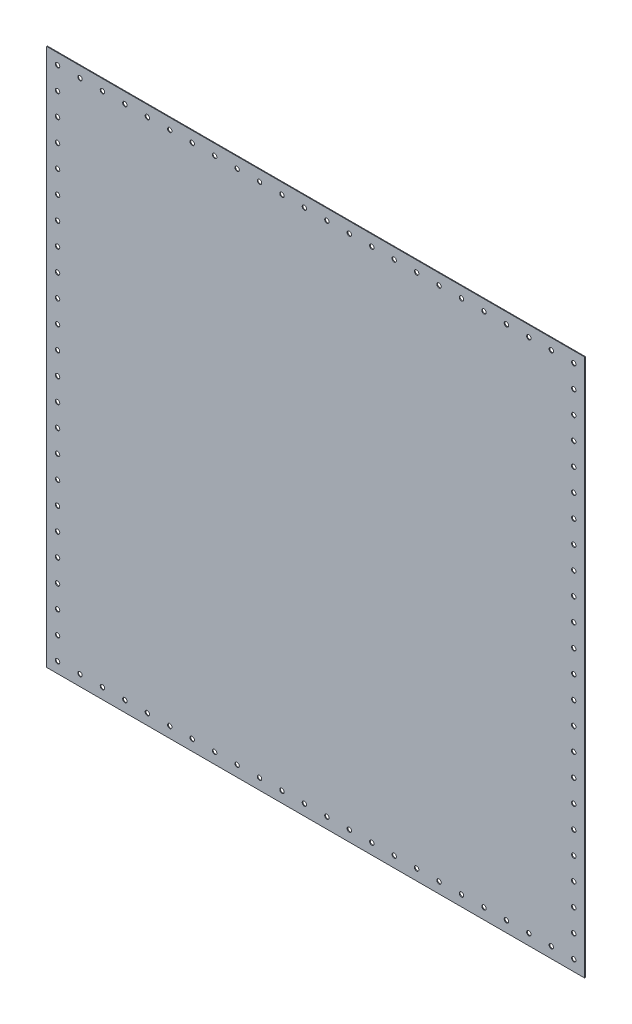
ISO-10303-21;
HEADER;
FILE_DESCRIPTION(('STEP AP214'),'2;1');
FILE_NAME('part.step','',(''),(''),'','','');
FILE_SCHEMA(('AUTOMOTIVE_DESIGN { 1 0 10303 214 1 1 1 1 }'));
ENDSEC;
DATA;
#1=APPLICATION_CONTEXT('core data for automotive mechanical design processes');
#2=APPLICATION_PROTOCOL_DEFINITION('international standard','automotive_design',2000,#1);
#3=PRODUCT_CONTEXT('',#1,'mechanical');
#4=PRODUCT('Part','Part','',(#3));
#5=PRODUCT_RELATED_PRODUCT_CATEGORY('part','',(#4));
#6=PRODUCT_DEFINITION_FORMATION('','',#4);
#7=PRODUCT_DEFINITION_CONTEXT('part definition',#1,'design');
#8=PRODUCT_DEFINITION('design','',#6,#7);
#9=PRODUCT_DEFINITION_SHAPE('','',#8);
#10=(LENGTH_UNIT() NAMED_UNIT(*) SI_UNIT(.MILLI.,.METRE.));
#11=(NAMED_UNIT(*) PLANE_ANGLE_UNIT() SI_UNIT($,.RADIAN.));
#12=(NAMED_UNIT(*) SI_UNIT($,.STERADIAN.) SOLID_ANGLE_UNIT());
#13=UNCERTAINTY_MEASURE_WITH_UNIT(LENGTH_MEASURE(1.E-05),#10,'distance_accuracy_value','');
#14=(GEOMETRIC_REPRESENTATION_CONTEXT(3) GLOBAL_UNCERTAINTY_ASSIGNED_CONTEXT((#13)) GLOBAL_UNIT_ASSIGNED_CONTEXT((#10,
#11,#12)) REPRESENTATION_CONTEXT('',''));
#15=CARTESIAN_POINT('',(0.,0.,0.));
#16=DIRECTION('',(0.,0.,1.));
#17=DIRECTION('',(1.,0.,0.));
#18=AXIS2_PLACEMENT_3D('',#15,#16,#17);
#19=CARTESIAN_POINT('',(-598.4875,598.4875,1.5875));
#20=DIRECTION('',(1.,0.,0.));
#21=DIRECTION('',(0.,1.,0.));
#22=AXIS2_PLACEMENT_3D('',#19,#20,#21);
#23=PLANE('',#22);
#24=DIRECTION('',(0.,-1.,0.));
#25=VECTOR('',#24,1.);
#26=CARTESIAN_POINT('',(-598.4875,598.4875,0.));
#27=LINE('',#26,#25);
#28=CARTESIAN_POINT('',(-598.4875,598.4875,0.));
#29=VERTEX_POINT('',#28);
#30=CARTESIAN_POINT('',(-598.4875,-598.4875,0.));
#31=VERTEX_POINT('',#30);
#32=EDGE_CURVE('E99',#29,#31,#27,.T.);
#33=ORIENTED_EDGE('',*,*,#32,.T.);
#34=DIRECTION('',(0.,0.,-1.));
#35=VECTOR('',#34,1.);
#36=CARTESIAN_POINT('',(-598.4875,-598.4875,1.5875));
#37=LINE('',#36,#35);
#38=CARTESIAN_POINT('',(-598.4875,-598.4875,1.5875));
#39=VERTEX_POINT('',#38);
#40=EDGE_CURVE('E11',#39,#31,#37,.T.);
#41=ORIENTED_EDGE('',*,*,#40,.F.);
#42=DIRECTION('',(0.,-1.,0.));
#43=VECTOR('',#42,1.);
#44=CARTESIAN_POINT('',(-598.4875,598.4875,1.5875));
#45=LINE('',#44,#43);
#46=CARTESIAN_POINT('',(-598.4875,598.4875,1.5875));
#47=VERTEX_POINT('',#46);
#48=EDGE_CURVE('E87',#47,#39,#45,.T.);
#49=ORIENTED_EDGE('',*,*,#48,.F.);
#50=DIRECTION('',(0.,0.,-1.));
#51=VECTOR('',#50,1.);
#52=CARTESIAN_POINT('',(-598.4875,598.4875,1.5875));
#53=LINE('',#52,#51);
#54=EDGE_CURVE('E95',#47,#29,#53,.T.);
#55=ORIENTED_EDGE('',*,*,#54,.T.);
#56=EDGE_LOOP('',(#33,#41,#49,#55));
#57=FACE_BOUND('',#56,.T.);
#58=ADVANCED_FACE('F36',(#57),#23,.F.);
#59=CARTESIAN_POINT('',(-598.4875,-598.4875,1.5875));
#60=DIRECTION('',(0.,1.,0.));
#61=DIRECTION('',(0.,0.,1.));
#62=AXIS2_PLACEMENT_3D('',#59,#60,#61);
#63=PLANE('',#62);
#64=DIRECTION('',(1.,0.,0.));
#65=VECTOR('',#64,1.);
#66=CARTESIAN_POINT('',(-598.4875,-598.4875,0.));
#67=LINE('',#66,#65);
#68=CARTESIAN_POINT('',(598.4875,-598.4875,0.));
#69=VERTEX_POINT('',#68);
#70=EDGE_CURVE('E91',#31,#69,#67,.T.);
#71=ORIENTED_EDGE('',*,*,#70,.T.);
#72=DIRECTION('',(0.,0.,-1.));
#73=VECTOR('',#72,1.);
#74=CARTESIAN_POINT('',(598.4875,-598.4875,1.5875));
#75=LINE('',#74,#73);
#76=CARTESIAN_POINT('',(598.4875,-598.4875,1.5875));
#77=VERTEX_POINT('',#76);
#78=EDGE_CURVE('E44',#77,#69,#75,.T.);
#79=ORIENTED_EDGE('',*,*,#78,.F.);
#80=DIRECTION('',(1.,0.,0.));
#81=VECTOR('',#80,1.);
#82=CARTESIAN_POINT('',(-598.4875,-598.4875,1.5875));
#83=LINE('',#82,#81);
#84=EDGE_CURVE('E82',#39,#77,#83,.T.);
#85=ORIENTED_EDGE('',*,*,#84,.F.);
#86=ORIENTED_EDGE('',*,*,#40,.T.);
#87=EDGE_LOOP('',(#71,#79,#85,#86));
#88=FACE_BOUND('',#87,.T.);
#89=ADVANCED_FACE('F90',(#88),#63,.F.);
#90=CARTESIAN_POINT('',(598.4875,598.4875,1.5875));
#91=DIRECTION('',(-1.,0.,0.));
#92=DIRECTION('',(0.,0.,1.));
#93=AXIS2_PLACEMENT_3D('',#90,#91,#92);
#94=PLANE('',#93);
#95=DIRECTION('',(0.,1.,0.));
#96=VECTOR('',#95,1.);
#97=CARTESIAN_POINT('',(598.4875,598.4875,0.));
#98=LINE('',#97,#96);
#99=CARTESIAN_POINT('',(598.4875,598.4875,0.));
#100=VERTEX_POINT('',#99);
#101=EDGE_CURVE('E69',#69,#100,#98,.T.);
#102=ORIENTED_EDGE('',*,*,#101,.T.);
#103=DIRECTION('',(0.,0.,-1.));
#104=VECTOR('',#103,1.);
#105=CARTESIAN_POINT('',(598.4875,598.4875,1.5875));
#106=LINE('',#105,#104);
#107=CARTESIAN_POINT('',(598.4875,598.4875,1.5875));
#108=VERTEX_POINT('',#107);
#109=EDGE_CURVE('E92',#108,#100,#106,.T.);
#110=ORIENTED_EDGE('',*,*,#109,.F.);
#111=DIRECTION('',(0.,1.,0.));
#112=VECTOR('',#111,1.);
#113=CARTESIAN_POINT('',(598.4875,598.4875,1.5875));
#114=LINE('',#113,#112);
#115=EDGE_CURVE('E85',#77,#108,#114,.T.);
#116=ORIENTED_EDGE('',*,*,#115,.F.);
#117=ORIENTED_EDGE('',*,*,#78,.T.);
#118=EDGE_LOOP('',(#102,#110,#116,#117));
#119=FACE_BOUND('',#118,.T.);
#120=ADVANCED_FACE('F93',(#119),#94,.F.);
#121=CARTESIAN_POINT('',(-598.4875,598.4875,1.5875));
#122=DIRECTION('',(0.,-1.,0.));
#123=DIRECTION('',(0.,0.,-1.));
#124=AXIS2_PLACEMENT_3D('',#121,#122,#123);
#125=PLANE('',#124);
#126=DIRECTION('',(-1.,0.,0.));
#127=VECTOR('',#126,1.);
#128=CARTESIAN_POINT('',(-598.4875,598.4875,0.));
#129=LINE('',#128,#127);
#130=EDGE_CURVE('E75',#100,#29,#129,.T.);
#131=ORIENTED_EDGE('',*,*,#130,.T.);
#132=ORIENTED_EDGE('',*,*,#54,.F.);
#133=DIRECTION('',(-1.,0.,0.));
#134=VECTOR('',#133,1.);
#135=CARTESIAN_POINT('',(-598.4875,598.4875,1.5875));
#136=LINE('',#135,#134);
#137=EDGE_CURVE('E52',#108,#47,#136,.T.);
#138=ORIENTED_EDGE('',*,*,#137,.F.);
#139=ORIENTED_EDGE('',*,*,#109,.T.);
#140=EDGE_LOOP('',(#131,#132,#138,#139));
#141=FACE_BOUND('',#140,.T.);
#142=ADVANCED_FACE('F107',(#141),#125,.F.);
#143=CARTESIAN_POINT('',(0.,0.,1.5875));
#144=DIRECTION('',(0.,0.,1.));
#145=DIRECTION('',(1.,0.,0.));
#146=AXIS2_PLACEMENT_3D('',#143,#144,#145);
#147=PLANE('',#146);
#148=CARTESIAN_POINT('',(-574.357500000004,524.413369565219,1.5875));
#149=DIRECTION('',(0.,0.,1.));
#150=DIRECTION('',(1.,0.,0.));
#151=AXIS2_PLACEMENT_3D('',#148,#149,#150);
#152=CIRCLE('',#151,4.90219999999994);
#153=CARTESIAN_POINT('',(-569.455300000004,524.413369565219,1.5875));
#154=VERTEX_POINT('',#153);
#155=EDGE_CURVE('E374',#154,#154,#152,.T.);
#156=ORIENTED_EDGE('',*,*,#155,.F.);
#157=EDGE_LOOP('',(#156));
#158=FACE_BOUND('',#157,.T.);
#159=CARTESIAN_POINT('',(574.357499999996,474.469239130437,1.5875));
#160=DIRECTION('',(0.,0.,1.));
#161=DIRECTION('',(1.,0.,0.));
#162=AXIS2_PLACEMENT_3D('',#159,#160,#161);
#163=CIRCLE('',#162,4.90219999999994);
#164=CARTESIAN_POINT('',(579.259699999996,474.469239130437,1.5875));
#165=VERTEX_POINT('',#164);
#166=EDGE_CURVE('E363',#165,#165,#163,.T.);
#167=ORIENTED_EDGE('',*,*,#166,.F.);
#168=EDGE_LOOP('',(#167));
#169=FACE_BOUND('',#168,.T.);
#170=CARTESIAN_POINT('',(-574.357500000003,474.469239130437,1.5875));
#171=DIRECTION('',(0.,0.,1.));
#172=DIRECTION('',(1.,0.,0.));
#173=AXIS2_PLACEMENT_3D('',#170,#171,#172);
#174=CIRCLE('',#173,4.90219999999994);
#175=CARTESIAN_POINT('',(-569.455300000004,474.469239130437,1.5875));
#176=VERTEX_POINT('',#175);
#177=EDGE_CURVE('E362',#176,#176,#174,.T.);
#178=ORIENTED_EDGE('',*,*,#177,.F.);
#179=EDGE_LOOP('',(#178));
#180=FACE_BOUND('',#179,.T.);
#181=CARTESIAN_POINT('',(574.357499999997,424.525108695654,1.5875));
#182=DIRECTION('',(0.,0.,1.));
#183=DIRECTION('',(1.,0.,0.));
#184=AXIS2_PLACEMENT_3D('',#181,#182,#183);
#185=CIRCLE('',#184,4.90219999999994);
#186=CARTESIAN_POINT('',(579.259699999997,424.525108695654,1.5875));
#187=VERTEX_POINT('',#186);
#188=EDGE_CURVE('E351',#187,#187,#185,.T.);
#189=ORIENTED_EDGE('',*,*,#188,.F.);
#190=EDGE_LOOP('',(#189));
#191=FACE_BOUND('',#190,.T.);
#192=CARTESIAN_POINT('',(-524.41336951,-574.3575,1.5875));
#193=DIRECTION('',(0.,0.,1.));
#194=DIRECTION('',(1.,0.,0.));
#195=AXIS2_PLACEMENT_3D('',#192,#193,#194);
#196=CIRCLE('',#195,4.90219999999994);
#197=CARTESIAN_POINT('',(-519.51116951,-574.3575,1.5875));
#198=VERTEX_POINT('',#197);
#199=EDGE_CURVE('E398',#198,#198,#196,.T.);
#200=ORIENTED_EDGE('',*,*,#199,.F.);
#201=EDGE_LOOP('',(#200));
#202=FACE_BOUND('',#201,.T.);
#203=CARTESIAN_POINT('',(574.357499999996,574.357500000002,1.5875));
#204=DIRECTION('',(0.,0.,1.));
#205=DIRECTION('',(1.,0.,0.));
#206=AXIS2_PLACEMENT_3D('',#203,#204,#205);
#207=CIRCLE('',#206,4.90219999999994);
#208=CARTESIAN_POINT('',(579.259699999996,574.357500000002,1.5875));
#209=VERTEX_POINT('',#208);
#210=EDGE_CURVE('E387',#209,#209,#207,.T.);
#211=ORIENTED_EDGE('',*,*,#210,.F.);
#212=EDGE_LOOP('',(#211));
#213=FACE_BOUND('',#212,.T.);
#214=CARTESIAN_POINT('',(-574.357500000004,574.357500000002,1.5875));
#215=DIRECTION('',(0.,0.,1.));
#216=DIRECTION('',(1.,0.,0.));
#217=AXIS2_PLACEMENT_3D('',#214,#215,#216);
#218=CIRCLE('',#217,4.90219999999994);
#219=CARTESIAN_POINT('',(-569.455300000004,574.357500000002,1.5875));
#220=VERTEX_POINT('',#219);
#221=EDGE_CURVE('E386',#220,#220,#218,.T.);
#222=ORIENTED_EDGE('',*,*,#221,.F.);
#223=EDGE_LOOP('',(#222));
#224=FACE_BOUND('',#223,.T.);
#225=CARTESIAN_POINT('',(574.357499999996,524.413369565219,1.5875));
#226=DIRECTION('',(0.,0.,1.));
#227=DIRECTION('',(1.,0.,0.));
#228=AXIS2_PLACEMENT_3D('',#225,#226,#227);
#229=CIRCLE('',#228,4.90219999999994);
#230=CARTESIAN_POINT('',(579.259699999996,524.413369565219,1.5875));
#231=VERTEX_POINT('',#230);
#232=EDGE_CURVE('E375',#231,#231,#229,.T.);
#233=ORIENTED_EDGE('',*,*,#232,.F.);
#234=EDGE_LOOP('',(#233));
#235=FACE_BOUND('',#234,.T.);
#236=CARTESIAN_POINT('',(-574.357500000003,324.636847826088,1.5875));
#237=DIRECTION('',(0.,0.,1.));
#238=DIRECTION('',(1.,0.,0.));
#239=AXIS2_PLACEMENT_3D('',#236,#237,#238);
#240=CIRCLE('',#239,4.90219999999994);
#241=CARTESIAN_POINT('',(-569.455300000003,324.636847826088,1.5875));
#242=VERTEX_POINT('',#241);
#243=EDGE_CURVE('E326',#242,#242,#240,.T.);
#244=ORIENTED_EDGE('',*,*,#243,.F.);
#245=EDGE_LOOP('',(#244));
#246=FACE_BOUND('',#245,.T.);
#247=CARTESIAN_POINT('',(574.357499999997,274.692717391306,1.5875));
#248=DIRECTION('',(0.,0.,1.));
#249=DIRECTION('',(1.,0.,0.));
#250=AXIS2_PLACEMENT_3D('',#247,#248,#249);
#251=CIRCLE('',#250,4.90219999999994);
#252=CARTESIAN_POINT('',(579.259699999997,274.692717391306,1.5875));
#253=VERTEX_POINT('',#252);
#254=EDGE_CURVE('E315',#253,#253,#251,.T.);
#255=ORIENTED_EDGE('',*,*,#254,.F.);
#256=EDGE_LOOP('',(#255));
#257=FACE_BOUND('',#256,.T.);
#258=CARTESIAN_POINT('',(-574.357500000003,274.692717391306,1.5875));
#259=DIRECTION('',(0.,0.,1.));
#260=DIRECTION('',(1.,0.,0.));
#261=AXIS2_PLACEMENT_3D('',#258,#259,#260);
#262=CIRCLE('',#261,4.90219999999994);
#263=CARTESIAN_POINT('',(-569.455300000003,274.692717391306,1.5875));
#264=VERTEX_POINT('',#263);
#265=EDGE_CURVE('E314',#264,#264,#262,.T.);
#266=ORIENTED_EDGE('',*,*,#265,.F.);
#267=EDGE_LOOP('',(#266));
#268=FACE_BOUND('',#267,.T.);
#269=CARTESIAN_POINT('',(574.357499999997,224.748586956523,1.5875));
#270=DIRECTION('',(0.,0.,1.));
#271=DIRECTION('',(1.,0.,0.));
#272=AXIS2_PLACEMENT_3D('',#269,#270,#271);
#273=CIRCLE('',#272,4.90219999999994);
#274=CARTESIAN_POINT('',(579.259699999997,224.748586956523,1.5875));
#275=VERTEX_POINT('',#274);
#276=EDGE_CURVE('E303',#275,#275,#273,.T.);
#277=ORIENTED_EDGE('',*,*,#276,.F.);
#278=EDGE_LOOP('',(#277));
#279=FACE_BOUND('',#278,.T.);
#280=CARTESIAN_POINT('',(-574.357500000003,424.525108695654,1.5875));
#281=DIRECTION('',(0.,0.,1.));
#282=DIRECTION('',(1.,0.,0.));
#283=AXIS2_PLACEMENT_3D('',#280,#281,#282);
#284=CIRCLE('',#283,4.90219999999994);
#285=CARTESIAN_POINT('',(-569.455300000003,424.525108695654,1.5875));
#286=VERTEX_POINT('',#285);
#287=EDGE_CURVE('E350',#286,#286,#284,.T.);
#288=ORIENTED_EDGE('',*,*,#287,.F.);
#289=EDGE_LOOP('',(#288));
#290=FACE_BOUND('',#289,.T.);
#291=CARTESIAN_POINT('',(574.357499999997,374.580978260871,1.5875));
#292=DIRECTION('',(0.,0.,1.));
#293=DIRECTION('',(1.,0.,0.));
#294=AXIS2_PLACEMENT_3D('',#291,#292,#293);
#295=CIRCLE('',#294,4.90219999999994);
#296=CARTESIAN_POINT('',(579.259699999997,374.580978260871,1.5875));
#297=VERTEX_POINT('',#296);
#298=EDGE_CURVE('E339',#297,#297,#295,.T.);
#299=ORIENTED_EDGE('',*,*,#298,.F.);
#300=EDGE_LOOP('',(#299));
#301=FACE_BOUND('',#300,.T.);
#302=CARTESIAN_POINT('',(-574.357500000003,374.580978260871,1.5875));
#303=DIRECTION('',(0.,0.,1.));
#304=DIRECTION('',(1.,0.,0.));
#305=AXIS2_PLACEMENT_3D('',#302,#303,#304);
#306=CIRCLE('',#305,4.90219999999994);
#307=CARTESIAN_POINT('',(-569.455300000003,374.580978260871,1.5875));
#308=VERTEX_POINT('',#307);
#309=EDGE_CURVE('E338',#308,#308,#306,.T.);
#310=ORIENTED_EDGE('',*,*,#309,.F.);
#311=EDGE_LOOP('',(#310));
#312=FACE_BOUND('',#311,.T.);
#313=CARTESIAN_POINT('',(574.357499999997,324.636847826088,1.5875));
#314=DIRECTION('',(0.,0.,1.));
#315=DIRECTION('',(1.,0.,0.));
#316=AXIS2_PLACEMENT_3D('',#313,#314,#315);
#317=CIRCLE('',#316,4.90219999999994);
#318=CARTESIAN_POINT('',(579.259699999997,324.636847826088,1.5875));
#319=VERTEX_POINT('',#318);
#320=EDGE_CURVE('E327',#319,#319,#317,.T.);
#321=ORIENTED_EDGE('',*,*,#320,.F.);
#322=EDGE_LOOP('',(#321));
#323=FACE_BOUND('',#322,.T.);
#324=CARTESIAN_POINT('',(-224.74858657,-574.3575,1.5875));
#325=DIRECTION('',(0.,0.,1.));
#326=DIRECTION('',(1.,0.,0.));
#327=AXIS2_PLACEMENT_3D('',#324,#325,#326);
#328=CIRCLE('',#327,4.90219999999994);
#329=CARTESIAN_POINT('',(-219.84638657,-574.3575,1.5875));
#330=VERTEX_POINT('',#329);
#331=EDGE_CURVE('E470',#330,#330,#328,.T.);
#332=ORIENTED_EDGE('',*,*,#331,.F.);
#333=EDGE_LOOP('',(#332));
#334=FACE_BOUND('',#333,.T.);
#335=CARTESIAN_POINT('',(-274.692717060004,574.357500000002,1.5875));
#336=DIRECTION('',(0.,0.,1.));
#337=DIRECTION('',(1.,0.,0.));
#338=AXIS2_PLACEMENT_3D('',#335,#336,#337);
#339=CIRCLE('',#338,4.90219999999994);
#340=CARTESIAN_POINT('',(-269.790517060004,574.357500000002,1.5875));
#341=VERTEX_POINT('',#340);
#342=EDGE_CURVE('E459',#341,#341,#339,.T.);
#343=ORIENTED_EDGE('',*,*,#342,.F.);
#344=EDGE_LOOP('',(#343));
#345=FACE_BOUND('',#344,.T.);
#346=CARTESIAN_POINT('',(-274.69271706,-574.3575,1.5875));
#347=DIRECTION('',(0.,0.,1.));
#348=DIRECTION('',(1.,0.,0.));
#349=AXIS2_PLACEMENT_3D('',#346,#347,#348);
#350=CIRCLE('',#349,4.90219999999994);
#351=CARTESIAN_POINT('',(-269.79051706,-574.3575,1.5875));
#352=VERTEX_POINT('',#351);
#353=EDGE_CURVE('E458',#352,#352,#350,.T.);
#354=ORIENTED_EDGE('',*,*,#353,.F.);
#355=EDGE_LOOP('',(#354));
#356=FACE_BOUND('',#355,.T.);
#357=CARTESIAN_POINT('',(-324.636847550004,574.357500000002,1.5875));
#358=DIRECTION('',(0.,0.,1.));
#359=DIRECTION('',(1.,0.,0.));
#360=AXIS2_PLACEMENT_3D('',#357,#358,#359);
#361=CIRCLE('',#360,4.90219999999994);
#362=CARTESIAN_POINT('',(-319.734647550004,574.357500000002,1.5875));
#363=VERTEX_POINT('',#362);
#364=EDGE_CURVE('E447',#363,#363,#361,.T.);
#365=ORIENTED_EDGE('',*,*,#364,.F.);
#366=EDGE_LOOP('',(#365));
#367=FACE_BOUND('',#366,.T.);
#368=CARTESIAN_POINT('',(-124.86032559,-574.3575,1.5875));
#369=DIRECTION('',(0.,0.,1.));
#370=DIRECTION('',(1.,0.,0.));
#371=AXIS2_PLACEMENT_3D('',#368,#369,#370);
#372=CIRCLE('',#371,4.90219999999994);
#373=CARTESIAN_POINT('',(-119.95812559,-574.3575,1.5875));
#374=VERTEX_POINT('',#373);
#375=EDGE_CURVE('E494',#374,#374,#372,.T.);
#376=ORIENTED_EDGE('',*,*,#375,.F.);
#377=EDGE_LOOP('',(#376));
#378=FACE_BOUND('',#377,.T.);
#379=CARTESIAN_POINT('',(-174.804456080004,574.357500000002,1.5875));
#380=DIRECTION('',(0.,0.,1.));
#381=DIRECTION('',(1.,0.,0.));
#382=AXIS2_PLACEMENT_3D('',#379,#380,#381);
#383=CIRCLE('',#382,4.90219999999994);
#384=CARTESIAN_POINT('',(-169.902256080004,574.357500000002,1.5875));
#385=VERTEX_POINT('',#384);
#386=EDGE_CURVE('E483',#385,#385,#383,.T.);
#387=ORIENTED_EDGE('',*,*,#386,.F.);
#388=EDGE_LOOP('',(#387));
#389=FACE_BOUND('',#388,.T.);
#390=CARTESIAN_POINT('',(-174.80445608,-574.3575,1.5875));
#391=DIRECTION('',(0.,0.,1.));
#392=DIRECTION('',(1.,0.,0.));
#393=AXIS2_PLACEMENT_3D('',#390,#391,#392);
#394=CIRCLE('',#393,4.90219999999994);
#395=CARTESIAN_POINT('',(-169.90225608,-574.3575,1.5875));
#396=VERTEX_POINT('',#395);
#397=EDGE_CURVE('E482',#396,#396,#394,.T.);
#398=ORIENTED_EDGE('',*,*,#397,.F.);
#399=EDGE_LOOP('',(#398));
#400=FACE_BOUND('',#399,.T.);
#401=CARTESIAN_POINT('',(-224.748586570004,574.357500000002,1.5875));
#402=DIRECTION('',(0.,0.,1.));
#403=DIRECTION('',(1.,0.,0.));
#404=AXIS2_PLACEMENT_3D('',#401,#402,#403);
#405=CIRCLE('',#404,4.90219999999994);
#406=CARTESIAN_POINT('',(-219.846386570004,574.357500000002,1.5875));
#407=VERTEX_POINT('',#406);
#408=EDGE_CURVE('E471',#407,#407,#405,.T.);
#409=ORIENTED_EDGE('',*,*,#408,.F.);
#410=EDGE_LOOP('',(#409));
#411=FACE_BOUND('',#410,.T.);
#412=CARTESIAN_POINT('',(-424.52510853,-574.3575,1.5875));
#413=DIRECTION('',(0.,0.,1.));
#414=DIRECTION('',(1.,0.,0.));
#415=AXIS2_PLACEMENT_3D('',#412,#413,#414);
#416=CIRCLE('',#415,4.90219999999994);
#417=CARTESIAN_POINT('',(-419.62290853,-574.3575,1.5875));
#418=VERTEX_POINT('',#417);
#419=EDGE_CURVE('E422',#418,#418,#416,.T.);
#420=ORIENTED_EDGE('',*,*,#419,.F.);
#421=EDGE_LOOP('',(#420));
#422=FACE_BOUND('',#421,.T.);
#423=CARTESIAN_POINT('',(-474.469239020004,574.357500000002,1.5875));
#424=DIRECTION('',(0.,0.,1.));
#425=DIRECTION('',(1.,0.,0.));
#426=AXIS2_PLACEMENT_3D('',#423,#424,#425);
#427=CIRCLE('',#426,4.90219999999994);
#428=CARTESIAN_POINT('',(-469.567039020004,574.357500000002,1.5875));
#429=VERTEX_POINT('',#428);
#430=EDGE_CURVE('E411',#429,#429,#427,.T.);
#431=ORIENTED_EDGE('',*,*,#430,.F.);
#432=EDGE_LOOP('',(#431));
#433=FACE_BOUND('',#432,.T.);
#434=CARTESIAN_POINT('',(-474.46923902,-574.3575,1.5875));
#435=DIRECTION('',(0.,0.,1.));
#436=DIRECTION('',(1.,0.,0.));
#437=AXIS2_PLACEMENT_3D('',#434,#435,#436);
#438=CIRCLE('',#437,4.90219999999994);
#439=CARTESIAN_POINT('',(-469.56703902,-574.3575,1.5875));
#440=VERTEX_POINT('',#439);
#441=EDGE_CURVE('E410',#440,#440,#438,.T.);
#442=ORIENTED_EDGE('',*,*,#441,.F.);
#443=EDGE_LOOP('',(#442));
#444=FACE_BOUND('',#443,.T.);
#445=CARTESIAN_POINT('',(-524.413369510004,574.357500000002,1.5875));
#446=DIRECTION('',(0.,0.,1.));
#447=DIRECTION('',(1.,0.,0.));
#448=AXIS2_PLACEMENT_3D('',#445,#446,#447);
#449=CIRCLE('',#448,4.90219999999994);
#450=CARTESIAN_POINT('',(-519.511169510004,574.357500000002,1.5875));
#451=VERTEX_POINT('',#450);
#452=EDGE_CURVE('E399',#451,#451,#449,.T.);
#453=ORIENTED_EDGE('',*,*,#452,.F.);
#454=EDGE_LOOP('',(#453));
#455=FACE_BOUND('',#454,.T.);
#456=CARTESIAN_POINT('',(-324.63684755,-574.3575,1.5875));
#457=DIRECTION('',(0.,0.,1.));
#458=DIRECTION('',(1.,0.,0.));
#459=AXIS2_PLACEMENT_3D('',#456,#457,#458);
#460=CIRCLE('',#459,4.90219999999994);
#461=CARTESIAN_POINT('',(-319.73464755,-574.3575,1.5875));
#462=VERTEX_POINT('',#461);
#463=EDGE_CURVE('E446',#462,#462,#460,.T.);
#464=ORIENTED_EDGE('',*,*,#463,.F.);
#465=EDGE_LOOP('',(#464));
#466=FACE_BOUND('',#465,.T.);
#467=CARTESIAN_POINT('',(-374.580978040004,574.357500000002,1.5875));
#468=DIRECTION('',(0.,0.,1.));
#469=DIRECTION('',(1.,0.,0.));
#470=AXIS2_PLACEMENT_3D('',#467,#468,#469);
#471=CIRCLE('',#470,4.90219999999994);
#472=CARTESIAN_POINT('',(-369.678778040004,574.357500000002,1.5875));
#473=VERTEX_POINT('',#472);
#474=EDGE_CURVE('E435',#473,#473,#471,.T.);
#475=ORIENTED_EDGE('',*,*,#474,.F.);
#476=EDGE_LOOP('',(#475));
#477=FACE_BOUND('',#476,.T.);
#478=CARTESIAN_POINT('',(-374.58097804,-574.3575,1.5875));
#479=DIRECTION('',(0.,0.,1.));
#480=DIRECTION('',(1.,0.,0.));
#481=AXIS2_PLACEMENT_3D('',#478,#479,#480);
#482=CIRCLE('',#481,4.90219999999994);
#483=CARTESIAN_POINT('',(-369.67877804,-574.3575,1.5875));
#484=VERTEX_POINT('',#483);
#485=EDGE_CURVE('E434',#484,#484,#482,.T.);
#486=ORIENTED_EDGE('',*,*,#485,.F.);
#487=EDGE_LOOP('',(#486));
#488=FACE_BOUND('',#487,.T.);
#489=CARTESIAN_POINT('',(-424.525108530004,574.357500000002,1.5875));
#490=DIRECTION('',(0.,0.,1.));
#491=DIRECTION('',(1.,0.,0.));
#492=AXIS2_PLACEMENT_3D('',#489,#490,#491);
#493=CIRCLE('',#492,4.90219999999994);
#494=CARTESIAN_POINT('',(-419.622908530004,574.357500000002,1.5875));
#495=VERTEX_POINT('',#494);
#496=EDGE_CURVE('E423',#495,#495,#493,.T.);
#497=ORIENTED_EDGE('',*,*,#496,.F.);
#498=EDGE_LOOP('',(#497));
#499=FACE_BOUND('',#498,.T.);
#500=CARTESIAN_POINT('',(-574.357500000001,-274.692717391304,1.5875));
#501=DIRECTION('',(0.,0.,1.));
#502=DIRECTION('',(1.,0.,0.));
#503=AXIS2_PLACEMENT_3D('',#500,#501,#502);
#504=CIRCLE('',#503,4.90219999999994);
#505=CARTESIAN_POINT('',(-569.455300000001,-274.692717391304,1.5875));
#506=VERTEX_POINT('',#505);
#507=EDGE_CURVE('E182',#506,#506,#504,.T.);
#508=ORIENTED_EDGE('',*,*,#507,.F.);
#509=EDGE_LOOP('',(#508));
#510=FACE_BOUND('',#509,.T.);
#511=CARTESIAN_POINT('',(574.357499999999,-324.636847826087,1.5875));
#512=DIRECTION('',(0.,0.,1.));
#513=DIRECTION('',(1.,0.,0.));
#514=AXIS2_PLACEMENT_3D('',#511,#512,#513);
#515=CIRCLE('',#514,4.90219999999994);
#516=CARTESIAN_POINT('',(579.259699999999,-324.636847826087,1.5875));
#517=VERTEX_POINT('',#516);
#518=EDGE_CURVE('E171',#517,#517,#515,.T.);
#519=ORIENTED_EDGE('',*,*,#518,.F.);
#520=EDGE_LOOP('',(#519));
#521=FACE_BOUND('',#520,.T.);
#522=CARTESIAN_POINT('',(-574.357500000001,-324.636847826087,1.5875));
#523=DIRECTION('',(0.,0.,1.));
#524=DIRECTION('',(1.,0.,0.));
#525=AXIS2_PLACEMENT_3D('',#522,#523,#524);
#526=CIRCLE('',#525,4.90219999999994);
#527=CARTESIAN_POINT('',(-569.455300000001,-324.636847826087,1.5875));
#528=VERTEX_POINT('',#527);
#529=EDGE_CURVE('E170',#528,#528,#526,.T.);
#530=ORIENTED_EDGE('',*,*,#529,.F.);
#531=EDGE_LOOP('',(#530));
#532=FACE_BOUND('',#531,.T.);
#533=CARTESIAN_POINT('',(574.357499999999,-374.580978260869,1.5875));
#534=DIRECTION('',(0.,0.,1.));
#535=DIRECTION('',(1.,0.,0.));
#536=AXIS2_PLACEMENT_3D('',#533,#534,#535);
#537=CIRCLE('',#536,4.90219999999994);
#538=CARTESIAN_POINT('',(579.259699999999,-374.580978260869,1.5875));
#539=VERTEX_POINT('',#538);
#540=EDGE_CURVE('E159',#539,#539,#537,.T.);
#541=ORIENTED_EDGE('',*,*,#540,.F.);
#542=EDGE_LOOP('',(#541));
#543=FACE_BOUND('',#542,.T.);
#544=CARTESIAN_POINT('',(-574.357500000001,-174.804456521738,1.5875));
#545=DIRECTION('',(0.,0.,1.));
#546=DIRECTION('',(1.,0.,0.));
#547=AXIS2_PLACEMENT_3D('',#544,#545,#546);
#548=CIRCLE('',#547,4.90219999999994);
#549=CARTESIAN_POINT('',(-569.455300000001,-174.804456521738,1.5875));
#550=VERTEX_POINT('',#549);
#551=EDGE_CURVE('E206',#550,#550,#548,.T.);
#552=ORIENTED_EDGE('',*,*,#551,.F.);
#553=EDGE_LOOP('',(#552));
#554=FACE_BOUND('',#553,.T.);
#555=CARTESIAN_POINT('',(574.357499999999,-224.748586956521,1.5875));
#556=DIRECTION('',(0.,0.,1.));
#557=DIRECTION('',(1.,0.,0.));
#558=AXIS2_PLACEMENT_3D('',#555,#556,#557);
#559=CIRCLE('',#558,4.90219999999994);
#560=CARTESIAN_POINT('',(579.259699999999,-224.748586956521,1.5875));
#561=VERTEX_POINT('',#560);
#562=EDGE_CURVE('E195',#561,#561,#559,.T.);
#563=ORIENTED_EDGE('',*,*,#562,.F.);
#564=EDGE_LOOP('',(#563));
#565=FACE_BOUND('',#564,.T.);
#566=CARTESIAN_POINT('',(-574.357500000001,-224.748586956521,1.5875));
#567=DIRECTION('',(0.,0.,1.));
#568=DIRECTION('',(1.,0.,0.));
#569=AXIS2_PLACEMENT_3D('',#566,#567,#568);
#570=CIRCLE('',#569,4.90219999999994);
#571=CARTESIAN_POINT('',(-569.455300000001,-224.748586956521,1.5875));
#572=VERTEX_POINT('',#571);
#573=EDGE_CURVE('E194',#572,#572,#570,.T.);
#574=ORIENTED_EDGE('',*,*,#573,.F.);
#575=EDGE_LOOP('',(#574));
#576=FACE_BOUND('',#575,.T.);
#577=CARTESIAN_POINT('',(574.357499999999,-274.692717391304,1.5875));
#578=DIRECTION('',(0.,0.,1.));
#579=DIRECTION('',(1.,0.,0.));
#580=AXIS2_PLACEMENT_3D('',#577,#578,#579);
#581=CIRCLE('',#580,4.90219999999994);
#582=CARTESIAN_POINT('',(579.259699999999,-274.692717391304,1.5875));
#583=VERTEX_POINT('',#582);
#584=EDGE_CURVE('E183',#583,#583,#581,.T.);
#585=ORIENTED_EDGE('',*,*,#584,.F.);
#586=EDGE_LOOP('',(#585));
#587=FACE_BOUND('',#586,.T.);
#588=CARTESIAN_POINT('',(-574.3575,-474.469239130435,1.5875));
#589=DIRECTION('',(0.,0.,1.));
#590=DIRECTION('',(1.,0.,0.));
#591=AXIS2_PLACEMENT_3D('',#588,#589,#590);
#592=CIRCLE('',#591,4.90219999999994);
#593=CARTESIAN_POINT('',(-569.4553,-474.469239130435,1.5875));
#594=VERTEX_POINT('',#593);
#595=EDGE_CURVE('E134',#594,#594,#592,.T.);
#596=ORIENTED_EDGE('',*,*,#595,.F.);
#597=EDGE_LOOP('',(#596));
#598=FACE_BOUND('',#597,.T.);
#599=CARTESIAN_POINT('',(574.3575,-524.413369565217,1.5875));
#600=DIRECTION('',(0.,0.,1.));
#601=DIRECTION('',(1.,0.,0.));
#602=AXIS2_PLACEMENT_3D('',#599,#600,#601);
#603=CIRCLE('',#602,4.90219999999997);
#604=CARTESIAN_POINT('',(579.2597,-524.413369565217,1.5875));
#605=VERTEX_POINT('',#604);
#606=EDGE_CURVE('E123',#605,#605,#603,.T.);
#607=ORIENTED_EDGE('',*,*,#606,.F.);
#608=EDGE_LOOP('',(#607));
#609=FACE_BOUND('',#608,.T.);
#610=CARTESIAN_POINT('',(-574.3575,-524.413369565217,1.5875));
#611=DIRECTION('',(0.,0.,1.));
#612=DIRECTION('',(1.,0.,0.));
#613=AXIS2_PLACEMENT_3D('',#610,#611,#612);
#614=CIRCLE('',#613,4.90219999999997);
#615=CARTESIAN_POINT('',(-569.4553,-524.413369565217,1.5875));
#616=VERTEX_POINT('',#615);
#617=EDGE_CURVE('E122',#616,#616,#614,.T.);
#618=ORIENTED_EDGE('',*,*,#617,.F.);
#619=EDGE_LOOP('',(#618));
#620=FACE_BOUND('',#619,.T.);
#621=CARTESIAN_POINT('',(574.3575,-574.3575,1.5875));
#622=DIRECTION('',(0.,0.,1.));
#623=DIRECTION('',(1.,0.,0.));
#624=AXIS2_PLACEMENT_3D('',#621,#622,#623);
#625=CIRCLE('',#624,4.90219999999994);
#626=CARTESIAN_POINT('',(579.2597,-574.3575,1.5875));
#627=VERTEX_POINT('',#626);
#628=EDGE_CURVE('E116',#627,#627,#625,.T.);
#629=ORIENTED_EDGE('',*,*,#628,.F.);
#630=EDGE_LOOP('',(#629));
#631=FACE_BOUND('',#630,.T.);
#632=CARTESIAN_POINT('',(-574.357500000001,-374.580978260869,1.5875));
#633=DIRECTION('',(0.,0.,1.));
#634=DIRECTION('',(1.,0.,0.));
#635=AXIS2_PLACEMENT_3D('',#632,#633,#634);
#636=CIRCLE('',#635,4.90219999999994);
#637=CARTESIAN_POINT('',(-569.455300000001,-374.580978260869,1.5875));
#638=VERTEX_POINT('',#637);
#639=EDGE_CURVE('E158',#638,#638,#636,.T.);
#640=ORIENTED_EDGE('',*,*,#639,.F.);
#641=EDGE_LOOP('',(#640));
#642=FACE_BOUND('',#641,.T.);
#643=CARTESIAN_POINT('',(574.357499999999,-424.525108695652,1.5875));
#644=DIRECTION('',(0.,0.,1.));
#645=DIRECTION('',(1.,0.,0.));
#646=AXIS2_PLACEMENT_3D('',#643,#644,#645);
#647=CIRCLE('',#646,4.90219999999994);
#648=CARTESIAN_POINT('',(579.259699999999,-424.525108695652,1.5875));
#649=VERTEX_POINT('',#648);
#650=EDGE_CURVE('E147',#649,#649,#647,.T.);
#651=ORIENTED_EDGE('',*,*,#650,.F.);
#652=EDGE_LOOP('',(#651));
#653=FACE_BOUND('',#652,.T.);
#654=CARTESIAN_POINT('',(-574.357500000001,-424.525108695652,1.5875));
#655=DIRECTION('',(0.,0.,1.));
#656=DIRECTION('',(1.,0.,0.));
#657=AXIS2_PLACEMENT_3D('',#654,#655,#656);
#658=CIRCLE('',#657,4.90219999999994);
#659=CARTESIAN_POINT('',(-569.455300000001,-424.525108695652,1.5875));
#660=VERTEX_POINT('',#659);
#661=EDGE_CURVE('E146',#660,#660,#658,.T.);
#662=ORIENTED_EDGE('',*,*,#661,.F.);
#663=EDGE_LOOP('',(#662));
#664=FACE_BOUND('',#663,.T.);
#665=CARTESIAN_POINT('',(574.3575,-474.469239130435,1.5875));
#666=DIRECTION('',(0.,0.,1.));
#667=DIRECTION('',(1.,0.,0.));
#668=AXIS2_PLACEMENT_3D('',#665,#666,#667);
#669=CIRCLE('',#668,4.90219999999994);
#670=CARTESIAN_POINT('',(579.2597,-474.469239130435,1.5875));
#671=VERTEX_POINT('',#670);
#672=EDGE_CURVE('E135',#671,#671,#669,.T.);
#673=ORIENTED_EDGE('',*,*,#672,.F.);
#674=EDGE_LOOP('',(#673));
#675=FACE_BOUND('',#674,.T.);
#676=CARTESIAN_POINT('',(-574.357500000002,124.860326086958,1.5875));
#677=DIRECTION('',(0.,0.,1.));
#678=DIRECTION('',(1.,0.,0.));
#679=AXIS2_PLACEMENT_3D('',#676,#677,#678);
#680=CIRCLE('',#679,4.90219999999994);
#681=CARTESIAN_POINT('',(-569.455300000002,124.860326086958,1.5875));
#682=VERTEX_POINT('',#681);
#683=EDGE_CURVE('E278',#682,#682,#680,.T.);
#684=ORIENTED_EDGE('',*,*,#683,.F.);
#685=EDGE_LOOP('',(#684));
#686=FACE_BOUND('',#685,.T.);
#687=CARTESIAN_POINT('',(574.357499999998,74.916195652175,1.5875));
#688=DIRECTION('',(0.,0.,1.));
#689=DIRECTION('',(1.,0.,0.));
#690=AXIS2_PLACEMENT_3D('',#687,#688,#689);
#691=CIRCLE('',#690,4.90219999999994);
#692=CARTESIAN_POINT('',(579.259699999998,74.916195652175,1.5875));
#693=VERTEX_POINT('',#692);
#694=EDGE_CURVE('E267',#693,#693,#691,.T.);
#695=ORIENTED_EDGE('',*,*,#694,.F.);
#696=EDGE_LOOP('',(#695));
#697=FACE_BOUND('',#696,.T.);
#698=CARTESIAN_POINT('',(-574.357500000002,74.916195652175,1.5875));
#699=DIRECTION('',(0.,0.,1.));
#700=DIRECTION('',(1.,0.,0.));
#701=AXIS2_PLACEMENT_3D('',#698,#699,#700);
#702=CIRCLE('',#701,4.90219999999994);
#703=CARTESIAN_POINT('',(-569.455300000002,74.916195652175,1.5875));
#704=VERTEX_POINT('',#703);
#705=EDGE_CURVE('E266',#704,#704,#702,.T.);
#706=ORIENTED_EDGE('',*,*,#705,.F.);
#707=EDGE_LOOP('',(#706));
#708=FACE_BOUND('',#707,.T.);
#709=CARTESIAN_POINT('',(574.357499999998,24.9720652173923,1.5875));
#710=DIRECTION('',(0.,0.,1.));
#711=DIRECTION('',(1.,0.,0.));
#712=AXIS2_PLACEMENT_3D('',#709,#710,#711);
#713=CIRCLE('',#712,4.90219999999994);
#714=CARTESIAN_POINT('',(579.259699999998,24.9720652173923,1.5875));
#715=VERTEX_POINT('',#714);
#716=EDGE_CURVE('E255',#715,#715,#713,.T.);
#717=ORIENTED_EDGE('',*,*,#716,.F.);
#718=EDGE_LOOP('',(#717));
#719=FACE_BOUND('',#718,.T.);
#720=CARTESIAN_POINT('',(-574.357500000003,224.748586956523,1.5875));
#721=DIRECTION('',(0.,0.,1.));
#722=DIRECTION('',(1.,0.,0.));
#723=AXIS2_PLACEMENT_3D('',#720,#721,#722);
#724=CIRCLE('',#723,4.90219999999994);
#725=CARTESIAN_POINT('',(-569.455300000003,224.748586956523,1.5875));
#726=VERTEX_POINT('',#725);
#727=EDGE_CURVE('E302',#726,#726,#724,.T.);
#728=ORIENTED_EDGE('',*,*,#727,.F.);
#729=EDGE_LOOP('',(#728));
#730=FACE_BOUND('',#729,.T.);
#731=CARTESIAN_POINT('',(574.357499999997,174.80445652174,1.5875));
#732=DIRECTION('',(0.,0.,1.));
#733=DIRECTION('',(1.,0.,0.));
#734=AXIS2_PLACEMENT_3D('',#731,#732,#733);
#735=CIRCLE('',#734,4.90219999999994);
#736=CARTESIAN_POINT('',(579.259699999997,174.80445652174,1.5875));
#737=VERTEX_POINT('',#736);
#738=EDGE_CURVE('E291',#737,#737,#735,.T.);
#739=ORIENTED_EDGE('',*,*,#738,.F.);
#740=EDGE_LOOP('',(#739));
#741=FACE_BOUND('',#740,.T.);
#742=CARTESIAN_POINT('',(-574.357500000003,174.80445652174,1.5875));
#743=DIRECTION('',(0.,0.,1.));
#744=DIRECTION('',(1.,0.,0.));
#745=AXIS2_PLACEMENT_3D('',#742,#743,#744);
#746=CIRCLE('',#745,4.90219999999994);
#747=CARTESIAN_POINT('',(-569.455300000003,174.80445652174,1.5875));
#748=VERTEX_POINT('',#747);
#749=EDGE_CURVE('E290',#748,#748,#746,.T.);
#750=ORIENTED_EDGE('',*,*,#749,.F.);
#751=EDGE_LOOP('',(#750));
#752=FACE_BOUND('',#751,.T.);
#753=CARTESIAN_POINT('',(574.357499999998,124.860326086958,1.5875));
#754=DIRECTION('',(0.,0.,1.));
#755=DIRECTION('',(1.,0.,0.));
#756=AXIS2_PLACEMENT_3D('',#753,#754,#755);
#757=CIRCLE('',#756,4.90219999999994);
#758=CARTESIAN_POINT('',(579.259699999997,124.860326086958,1.5875));
#759=VERTEX_POINT('',#758);
#760=EDGE_CURVE('E279',#759,#759,#757,.T.);
#761=ORIENTED_EDGE('',*,*,#760,.F.);
#762=EDGE_LOOP('',(#761));
#763=FACE_BOUND('',#762,.T.);
#764=CARTESIAN_POINT('',(-574.357500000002,-74.9161956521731,1.5875));
#765=DIRECTION('',(0.,0.,1.));
#766=DIRECTION('',(1.,0.,0.));
#767=AXIS2_PLACEMENT_3D('',#764,#765,#766);
#768=CIRCLE('',#767,4.90219999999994);
#769=CARTESIAN_POINT('',(-569.455300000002,-74.9161956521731,1.5875));
#770=VERTEX_POINT('',#769);
#771=EDGE_CURVE('E230',#770,#770,#768,.T.);
#772=ORIENTED_EDGE('',*,*,#771,.F.);
#773=EDGE_LOOP('',(#772));
#774=FACE_BOUND('',#773,.T.);
#775=CARTESIAN_POINT('',(574.357499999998,-124.860326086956,1.5875));
#776=DIRECTION('',(0.,0.,1.));
#777=DIRECTION('',(1.,0.,0.));
#778=AXIS2_PLACEMENT_3D('',#775,#776,#777);
#779=CIRCLE('',#778,4.90219999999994);
#780=CARTESIAN_POINT('',(579.259699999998,-124.860326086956,1.5875));
#781=VERTEX_POINT('',#780);
#782=EDGE_CURVE('E219',#781,#781,#779,.T.);
#783=ORIENTED_EDGE('',*,*,#782,.F.);
#784=EDGE_LOOP('',(#783));
#785=FACE_BOUND('',#784,.T.);
#786=CARTESIAN_POINT('',(-574.357500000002,-124.860326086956,1.5875));
#787=DIRECTION('',(0.,0.,1.));
#788=DIRECTION('',(1.,0.,0.));
#789=AXIS2_PLACEMENT_3D('',#786,#787,#788);
#790=CIRCLE('',#789,4.90219999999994);
#791=CARTESIAN_POINT('',(-569.455300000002,-124.860326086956,1.5875));
#792=VERTEX_POINT('',#791);
#793=EDGE_CURVE('E218',#792,#792,#790,.T.);
#794=ORIENTED_EDGE('',*,*,#793,.F.);
#795=EDGE_LOOP('',(#794));
#796=FACE_BOUND('',#795,.T.);
#797=CARTESIAN_POINT('',(574.357499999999,-174.804456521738,1.5875));
#798=DIRECTION('',(0.,0.,1.));
#799=DIRECTION('',(1.,0.,0.));
#800=AXIS2_PLACEMENT_3D('',#797,#798,#799);
#801=CIRCLE('',#800,4.90219999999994);
#802=CARTESIAN_POINT('',(579.259699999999,-174.804456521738,1.5875));
#803=VERTEX_POINT('',#802);
#804=EDGE_CURVE('E207',#803,#803,#801,.T.);
#805=ORIENTED_EDGE('',*,*,#804,.F.);
#806=EDGE_LOOP('',(#805));
#807=FACE_BOUND('',#806,.T.);
#808=CARTESIAN_POINT('',(-574.357500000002,24.9720652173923,1.5875));
#809=DIRECTION('',(0.,0.,1.));
#810=DIRECTION('',(1.,0.,0.));
#811=AXIS2_PLACEMENT_3D('',#808,#809,#810);
#812=CIRCLE('',#811,4.90219999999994);
#813=CARTESIAN_POINT('',(-569.455300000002,24.9720652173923,1.5875));
#814=VERTEX_POINT('',#813);
#815=EDGE_CURVE('E254',#814,#814,#812,.T.);
#816=ORIENTED_EDGE('',*,*,#815,.F.);
#817=EDGE_LOOP('',(#816));
#818=FACE_BOUND('',#817,.T.);
#819=CARTESIAN_POINT('',(574.357499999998,-24.9720652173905,1.5875));
#820=DIRECTION('',(0.,0.,1.));
#821=DIRECTION('',(1.,0.,0.));
#822=AXIS2_PLACEMENT_3D('',#819,#820,#821);
#823=CIRCLE('',#822,4.90219999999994);
#824=CARTESIAN_POINT('',(579.259699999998,-24.9720652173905,1.5875));
#825=VERTEX_POINT('',#824);
#826=EDGE_CURVE('E243',#825,#825,#823,.T.);
#827=ORIENTED_EDGE('',*,*,#826,.F.);
#828=EDGE_LOOP('',(#827));
#829=FACE_BOUND('',#828,.T.);
#830=CARTESIAN_POINT('',(-574.357500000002,-24.9720652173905,1.5875));
#831=DIRECTION('',(0.,0.,1.));
#832=DIRECTION('',(1.,0.,0.));
#833=AXIS2_PLACEMENT_3D('',#830,#831,#832);
#834=CIRCLE('',#833,4.90219999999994);
#835=CARTESIAN_POINT('',(-569.455300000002,-24.9720652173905,1.5875));
#836=VERTEX_POINT('',#835);
#837=EDGE_CURVE('E242',#836,#836,#834,.T.);
#838=ORIENTED_EDGE('',*,*,#837,.F.);
#839=EDGE_LOOP('',(#838));
#840=FACE_BOUND('',#839,.T.);
#841=CARTESIAN_POINT('',(574.357499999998,-74.9161956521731,1.5875));
#842=DIRECTION('',(0.,0.,1.));
#843=DIRECTION('',(1.,0.,0.));
#844=AXIS2_PLACEMENT_3D('',#841,#842,#843);
#845=CIRCLE('',#844,4.90219999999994);
#846=CARTESIAN_POINT('',(579.259699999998,-74.9161956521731,1.5875));
#847=VERTEX_POINT('',#846);
#848=EDGE_CURVE('E231',#847,#847,#845,.T.);
#849=ORIENTED_EDGE('',*,*,#848,.F.);
#850=EDGE_LOOP('',(#849));
#851=FACE_BOUND('',#850,.T.);
#852=CARTESIAN_POINT('',(374.580979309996,574.357500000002,1.5875));
#853=DIRECTION('',(0.,0.,1.));
#854=DIRECTION('',(1.,0.,0.));
#855=AXIS2_PLACEMENT_3D('',#852,#853,#854);
#856=CIRCLE('',#855,4.90219999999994);
#857=CARTESIAN_POINT('',(379.483179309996,574.357500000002,1.5875));
#858=VERTEX_POINT('',#857);
#859=EDGE_CURVE('E615',#858,#858,#856,.T.);
#860=ORIENTED_EDGE('',*,*,#859,.F.);
#861=EDGE_LOOP('',(#860));
#862=FACE_BOUND('',#861,.T.);
#863=CARTESIAN_POINT('',(424.5251098,-574.3575,1.5875));
#864=DIRECTION('',(0.,0.,1.));
#865=DIRECTION('',(1.,0.,0.));
#866=AXIS2_PLACEMENT_3D('',#863,#864,#865);
#867=CIRCLE('',#866,4.90219999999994);
#868=CARTESIAN_POINT('',(429.4273098,-574.3575,1.5875));
#869=VERTEX_POINT('',#868);
#870=EDGE_CURVE('E626',#869,#869,#867,.T.);
#871=ORIENTED_EDGE('',*,*,#870,.F.);
#872=EDGE_LOOP('',(#871));
#873=FACE_BOUND('',#872,.T.);
#874=CARTESIAN_POINT('',(424.525109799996,574.357500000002,1.5875));
#875=DIRECTION('',(0.,0.,1.));
#876=DIRECTION('',(1.,0.,0.));
#877=AXIS2_PLACEMENT_3D('',#874,#875,#876);
#878=CIRCLE('',#877,4.90219999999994);
#879=CARTESIAN_POINT('',(429.427309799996,574.357500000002,1.5875));
#880=VERTEX_POINT('',#879);
#881=EDGE_CURVE('E627',#880,#880,#878,.T.);
#882=ORIENTED_EDGE('',*,*,#881,.F.);
#883=EDGE_LOOP('',(#882));
#884=FACE_BOUND('',#883,.T.);
#885=CARTESIAN_POINT('',(474.46924029,-574.3575,1.5875));
#886=DIRECTION('',(0.,0.,1.));
#887=DIRECTION('',(1.,0.,0.));
#888=AXIS2_PLACEMENT_3D('',#885,#886,#887);
#889=CIRCLE('',#888,4.90219999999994);
#890=CARTESIAN_POINT('',(479.37144029,-574.3575,1.5875));
#891=VERTEX_POINT('',#890);
#892=EDGE_CURVE('E638',#891,#891,#889,.T.);
#893=ORIENTED_EDGE('',*,*,#892,.F.);
#894=EDGE_LOOP('',(#893));
#895=FACE_BOUND('',#894,.T.);
#896=CARTESIAN_POINT('',(274.692718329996,574.357500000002,1.5875));
#897=DIRECTION('',(0.,0.,1.));
#898=DIRECTION('',(1.,0.,0.));
#899=AXIS2_PLACEMENT_3D('',#896,#897,#898);
#900=CIRCLE('',#899,4.90219999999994);
#901=CARTESIAN_POINT('',(279.594918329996,574.357500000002,1.5875));
#902=VERTEX_POINT('',#901);
#903=EDGE_CURVE('E591',#902,#902,#900,.T.);
#904=ORIENTED_EDGE('',*,*,#903,.F.);
#905=EDGE_LOOP('',(#904));
#906=FACE_BOUND('',#905,.T.);
#907=CARTESIAN_POINT('',(324.63684882,-574.3575,1.5875));
#908=DIRECTION('',(0.,0.,1.));
#909=DIRECTION('',(1.,0.,0.));
#910=AXIS2_PLACEMENT_3D('',#907,#908,#909);
#911=CIRCLE('',#910,4.90219999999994);
#912=CARTESIAN_POINT('',(329.53904882,-574.3575,1.5875));
#913=VERTEX_POINT('',#912);
#914=EDGE_CURVE('E602',#913,#913,#911,.T.);
#915=ORIENTED_EDGE('',*,*,#914,.F.);
#916=EDGE_LOOP('',(#915));
#917=FACE_BOUND('',#916,.T.);
#918=CARTESIAN_POINT('',(324.636848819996,574.357500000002,1.5875));
#919=DIRECTION('',(0.,0.,1.));
#920=DIRECTION('',(1.,0.,0.));
#921=AXIS2_PLACEMENT_3D('',#918,#919,#920);
#922=CIRCLE('',#921,4.90219999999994);
#923=CARTESIAN_POINT('',(329.539048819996,574.357500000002,1.5875));
#924=VERTEX_POINT('',#923);
#925=EDGE_CURVE('E603',#924,#924,#922,.T.);
#926=ORIENTED_EDGE('',*,*,#925,.F.);
#927=EDGE_LOOP('',(#926));
#928=FACE_BOUND('',#927,.T.);
#929=CARTESIAN_POINT('',(374.58097931,-574.3575,1.5875));
#930=DIRECTION('',(0.,0.,1.));
#931=DIRECTION('',(1.,0.,0.));
#932=AXIS2_PLACEMENT_3D('',#929,#930,#931);
#933=CIRCLE('',#932,4.90219999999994);
#934=CARTESIAN_POINT('',(379.48317931,-574.3575,1.5875));
#935=VERTEX_POINT('',#934);
#936=EDGE_CURVE('E614',#935,#935,#933,.T.);
#937=ORIENTED_EDGE('',*,*,#936,.F.);
#938=EDGE_LOOP('',(#937));
#939=FACE_BOUND('',#938,.T.);
#940=CARTESIAN_POINT('',(524.413370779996,574.357500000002,1.5875));
#941=DIRECTION('',(0.,0.,1.));
#942=DIRECTION('',(1.,0.,0.));
#943=AXIS2_PLACEMENT_3D('',#940,#941,#942);
#944=CIRCLE('',#943,4.90219999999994);
#945=CARTESIAN_POINT('',(529.315570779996,574.357500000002,1.5875));
#946=VERTEX_POINT('',#945);
#947=EDGE_CURVE('E651',#946,#946,#944,.T.);
#948=ORIENTED_EDGE('',*,*,#947,.F.);
#949=EDGE_LOOP('',(#948));
#950=FACE_BOUND('',#949,.T.);
#951=CARTESIAN_POINT('',(524.41337078,-574.3575,1.5875));
#952=DIRECTION('',(0.,0.,1.));
#953=DIRECTION('',(1.,0.,0.));
#954=AXIS2_PLACEMENT_3D('',#951,#952,#953);
#955=CIRCLE('',#954,4.90219999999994);
#956=CARTESIAN_POINT('',(529.31557078,-574.3575,1.5875));
#957=VERTEX_POINT('',#956);
#958=EDGE_CURVE('E650',#957,#957,#955,.T.);
#959=ORIENTED_EDGE('',*,*,#958,.F.);
#960=EDGE_LOOP('',(#959));
#961=FACE_BOUND('',#960,.T.);
#962=CARTESIAN_POINT('',(474.469240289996,574.357500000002,1.5875));
#963=DIRECTION('',(0.,0.,1.));
#964=DIRECTION('',(1.,0.,0.));
#965=AXIS2_PLACEMENT_3D('',#962,#963,#964);
#966=CIRCLE('',#965,4.90219999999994);
#967=CARTESIAN_POINT('',(479.371440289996,574.357500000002,1.5875));
#968=VERTEX_POINT('',#967);
#969=EDGE_CURVE('E639',#968,#968,#966,.T.);
#970=ORIENTED_EDGE('',*,*,#969,.F.);
#971=EDGE_LOOP('',(#970));
#972=FACE_BOUND('',#971,.T.);
#973=CARTESIAN_POINT('',(-24.9720646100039,574.357500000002,1.5875));
#974=DIRECTION('',(0.,0.,1.));
#975=DIRECTION('',(1.,0.,0.));
#976=AXIS2_PLACEMENT_3D('',#973,#974,#975);
#977=CIRCLE('',#976,4.90219999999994);
#978=CARTESIAN_POINT('',(-20.069864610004,574.357500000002,1.5875));
#979=VERTEX_POINT('',#978);
#980=EDGE_CURVE('E519',#979,#979,#977,.T.);
#981=ORIENTED_EDGE('',*,*,#980,.F.);
#982=EDGE_LOOP('',(#981));
#983=FACE_BOUND('',#982,.T.);
#984=CARTESIAN_POINT('',(24.97206588,-574.3575,1.5875));
#985=DIRECTION('',(0.,0.,1.));
#986=DIRECTION('',(1.,0.,0.));
#987=AXIS2_PLACEMENT_3D('',#984,#985,#986);
#988=CIRCLE('',#987,4.90219999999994);
#989=CARTESIAN_POINT('',(29.8742658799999,-574.3575,1.5875));
#990=VERTEX_POINT('',#989);
#991=EDGE_CURVE('E530',#990,#990,#988,.T.);
#992=ORIENTED_EDGE('',*,*,#991,.F.);
#993=EDGE_LOOP('',(#992));
#994=FACE_BOUND('',#993,.T.);
#995=CARTESIAN_POINT('',(24.9720658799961,574.357500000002,1.5875));
#996=DIRECTION('',(0.,0.,1.));
#997=DIRECTION('',(1.,0.,0.));
#998=AXIS2_PLACEMENT_3D('',#995,#996,#997);
#999=CIRCLE('',#998,4.90219999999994);
#1000=CARTESIAN_POINT('',(29.8742658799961,574.357500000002,1.5875));
#1001=VERTEX_POINT('',#1000);
#1002=EDGE_CURVE('E531',#1001,#1001,#999,.T.);
#1003=ORIENTED_EDGE('',*,*,#1002,.F.);
#1004=EDGE_LOOP('',(#1003));
#1005=FACE_BOUND('',#1004,.T.);
#1006=CARTESIAN_POINT('',(74.91619637,-574.3575,1.5875));
#1007=DIRECTION('',(0.,0.,1.));
#1008=DIRECTION('',(1.,0.,0.));
#1009=AXIS2_PLACEMENT_3D('',#1006,#1007,#1008);
#1010=CIRCLE('',#1009,4.90219999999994);
#1011=CARTESIAN_POINT('',(79.81839637,-574.3575,1.5875));
#1012=VERTEX_POINT('',#1011);
#1013=EDGE_CURVE('E542',#1012,#1012,#1010,.T.);
#1014=ORIENTED_EDGE('',*,*,#1013,.F.);
#1015=EDGE_LOOP('',(#1014));
#1016=FACE_BOUND('',#1015,.T.);
#1017=CARTESIAN_POINT('',(-124.860325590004,574.357500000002,1.5875));
#1018=DIRECTION('',(0.,0.,1.));
#1019=DIRECTION('',(1.,0.,0.));
#1020=AXIS2_PLACEMENT_3D('',#1017,#1018,#1019);
#1021=CIRCLE('',#1020,4.90219999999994);
#1022=CARTESIAN_POINT('',(-119.958125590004,574.357500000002,1.5875));
#1023=VERTEX_POINT('',#1022);
#1024=EDGE_CURVE('E495',#1023,#1023,#1021,.T.);
#1025=ORIENTED_EDGE('',*,*,#1024,.F.);
#1026=EDGE_LOOP('',(#1025));
#1027=FACE_BOUND('',#1026,.T.);
#1028=CARTESIAN_POINT('',(-74.9161951,-574.3575,1.5875));
#1029=DIRECTION('',(0.,0.,1.));
#1030=DIRECTION('',(1.,0.,0.));
#1031=AXIS2_PLACEMENT_3D('',#1028,#1029,#1030);
#1032=CIRCLE('',#1031,4.90219999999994);
#1033=CARTESIAN_POINT('',(-70.0139951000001,-574.3575,1.5875));
#1034=VERTEX_POINT('',#1033);
#1035=EDGE_CURVE('E506',#1034,#1034,#1032,.T.);
#1036=ORIENTED_EDGE('',*,*,#1035,.F.);
#1037=EDGE_LOOP('',(#1036));
#1038=FACE_BOUND('',#1037,.T.);
#1039=CARTESIAN_POINT('',(-74.9161951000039,574.357500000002,1.5875));
#1040=DIRECTION('',(0.,0.,1.));
#1041=DIRECTION('',(1.,0.,0.));
#1042=AXIS2_PLACEMENT_3D('',#1039,#1040,#1041);
#1043=CIRCLE('',#1042,4.90219999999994);
#1044=CARTESIAN_POINT('',(-70.013995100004,574.357500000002,1.5875));
#1045=VERTEX_POINT('',#1044);
#1046=EDGE_CURVE('E507',#1045,#1045,#1043,.T.);
#1047=ORIENTED_EDGE('',*,*,#1046,.F.);
#1048=EDGE_LOOP('',(#1047));
#1049=FACE_BOUND('',#1048,.T.);
#1050=CARTESIAN_POINT('',(-24.97206461,-574.3575,1.5875));
#1051=DIRECTION('',(0.,0.,1.));
#1052=DIRECTION('',(1.,0.,0.));
#1053=AXIS2_PLACEMENT_3D('',#1050,#1051,#1052);
#1054=CIRCLE('',#1053,4.90219999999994);
#1055=CARTESIAN_POINT('',(-20.0698646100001,-574.3575,1.5875));
#1056=VERTEX_POINT('',#1055);
#1057=EDGE_CURVE('E518',#1056,#1056,#1054,.T.);
#1058=ORIENTED_EDGE('',*,*,#1057,.F.);
#1059=EDGE_LOOP('',(#1058));
#1060=FACE_BOUND('',#1059,.T.);
#1061=CARTESIAN_POINT('',(174.804457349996,574.357500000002,1.5875));
#1062=DIRECTION('',(0.,0.,1.));
#1063=DIRECTION('',(1.,0.,0.));
#1064=AXIS2_PLACEMENT_3D('',#1061,#1062,#1063);
#1065=CIRCLE('',#1064,4.90219999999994);
#1066=CARTESIAN_POINT('',(179.706657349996,574.357500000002,1.5875));
#1067=VERTEX_POINT('',#1066);
#1068=EDGE_CURVE('E567',#1067,#1067,#1065,.T.);
#1069=ORIENTED_EDGE('',*,*,#1068,.F.);
#1070=EDGE_LOOP('',(#1069));
#1071=FACE_BOUND('',#1070,.T.);
#1072=CARTESIAN_POINT('',(224.74858784,-574.3575,1.5875));
#1073=DIRECTION('',(0.,0.,1.));
#1074=DIRECTION('',(1.,0.,0.));
#1075=AXIS2_PLACEMENT_3D('',#1072,#1073,#1074);
#1076=CIRCLE('',#1075,4.90219999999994);
#1077=CARTESIAN_POINT('',(229.65078784,-574.3575,1.5875));
#1078=VERTEX_POINT('',#1077);
#1079=EDGE_CURVE('E578',#1078,#1078,#1076,.T.);
#1080=ORIENTED_EDGE('',*,*,#1079,.F.);
#1081=EDGE_LOOP('',(#1080));
#1082=FACE_BOUND('',#1081,.T.);
#1083=CARTESIAN_POINT('',(224.748587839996,574.357500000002,1.5875));
#1084=DIRECTION('',(0.,0.,1.));
#1085=DIRECTION('',(1.,0.,0.));
#1086=AXIS2_PLACEMENT_3D('',#1083,#1084,#1085);
#1087=CIRCLE('',#1086,4.90219999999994);
#1088=CARTESIAN_POINT('',(229.650787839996,574.357500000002,1.5875));
#1089=VERTEX_POINT('',#1088);
#1090=EDGE_CURVE('E579',#1089,#1089,#1087,.T.);
#1091=ORIENTED_EDGE('',*,*,#1090,.F.);
#1092=EDGE_LOOP('',(#1091));
#1093=FACE_BOUND('',#1092,.T.);
#1094=CARTESIAN_POINT('',(274.69271833,-574.3575,1.5875));
#1095=DIRECTION('',(0.,0.,1.));
#1096=DIRECTION('',(1.,0.,0.));
#1097=AXIS2_PLACEMENT_3D('',#1094,#1095,#1096);
#1098=CIRCLE('',#1097,4.90219999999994);
#1099=CARTESIAN_POINT('',(279.59491833,-574.3575,1.5875));
#1100=VERTEX_POINT('',#1099);
#1101=EDGE_CURVE('E590',#1100,#1100,#1098,.T.);
#1102=ORIENTED_EDGE('',*,*,#1101,.F.);
#1103=EDGE_LOOP('',(#1102));
#1104=FACE_BOUND('',#1103,.T.);
#1105=CARTESIAN_POINT('',(74.9161963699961,574.357500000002,1.5875));
#1106=DIRECTION('',(0.,0.,1.));
#1107=DIRECTION('',(1.,0.,0.));
#1108=AXIS2_PLACEMENT_3D('',#1105,#1106,#1107);
#1109=CIRCLE('',#1108,4.90219999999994);
#1110=CARTESIAN_POINT('',(79.8183963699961,574.357500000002,1.5875));
#1111=VERTEX_POINT('',#1110);
#1112=EDGE_CURVE('E543',#1111,#1111,#1109,.T.);
#1113=ORIENTED_EDGE('',*,*,#1112,.F.);
#1114=EDGE_LOOP('',(#1113));
#1115=FACE_BOUND('',#1114,.T.);
#1116=CARTESIAN_POINT('',(124.86032686,-574.3575,1.5875));
#1117=DIRECTION('',(0.,0.,1.));
#1118=DIRECTION('',(1.,0.,0.));
#1119=AXIS2_PLACEMENT_3D('',#1116,#1117,#1118);
#1120=CIRCLE('',#1119,4.90219999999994);
#1121=CARTESIAN_POINT('',(129.76252686,-574.3575,1.5875));
#1122=VERTEX_POINT('',#1121);
#1123=EDGE_CURVE('E554',#1122,#1122,#1120,.T.);
#1124=ORIENTED_EDGE('',*,*,#1123,.F.);
#1125=EDGE_LOOP('',(#1124));
#1126=FACE_BOUND('',#1125,.T.);
#1127=CARTESIAN_POINT('',(124.860326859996,574.357500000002,1.5875));
#1128=DIRECTION('',(0.,0.,1.));
#1129=DIRECTION('',(1.,0.,0.));
#1130=AXIS2_PLACEMENT_3D('',#1127,#1128,#1129);
#1131=CIRCLE('',#1130,4.90219999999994);
#1132=CARTESIAN_POINT('',(129.762526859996,574.357500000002,1.5875));
#1133=VERTEX_POINT('',#1132);
#1134=EDGE_CURVE('E555',#1133,#1133,#1131,.T.);
#1135=ORIENTED_EDGE('',*,*,#1134,.F.);
#1136=EDGE_LOOP('',(#1135));
#1137=FACE_BOUND('',#1136,.T.);
#1138=CARTESIAN_POINT('',(174.80445735,-574.3575,1.5875));
#1139=DIRECTION('',(0.,0.,1.));
#1140=DIRECTION('',(1.,0.,0.));
#1141=AXIS2_PLACEMENT_3D('',#1138,#1139,#1140);
#1142=CIRCLE('',#1141,4.90219999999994);
#1143=CARTESIAN_POINT('',(179.70665735,-574.3575,1.5875));
#1144=VERTEX_POINT('',#1143);
#1145=EDGE_CURVE('E566',#1144,#1144,#1142,.T.);
#1146=ORIENTED_EDGE('',*,*,#1145,.F.);
#1147=EDGE_LOOP('',(#1146));
#1148=FACE_BOUND('',#1147,.T.);
#1149=CARTESIAN_POINT('',(-574.3575,-574.3575,1.5875));
#1150=DIRECTION('',(0.,0.,1.));
#1151=DIRECTION('',(1.,0.,0.));
#1152=AXIS2_PLACEMENT_3D('',#1149,#1150,#1151);
#1153=CIRCLE('',#1152,4.90219999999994);
#1154=CARTESIAN_POINT('',(-569.4553,-574.3575,1.5875));
#1155=VERTEX_POINT('',#1154);
#1156=EDGE_CURVE('E102',#1155,#1155,#1153,.T.);
#1157=ORIENTED_EDGE('',*,*,#1156,.F.);
#1158=EDGE_LOOP('',(#1157));
#1159=FACE_BOUND('',#1158,.T.);
#1160=ORIENTED_EDGE('',*,*,#48,.T.);
#1161=ORIENTED_EDGE('',*,*,#84,.T.);
#1162=ORIENTED_EDGE('',*,*,#115,.T.);
#1163=ORIENTED_EDGE('',*,*,#137,.T.);
#1164=EDGE_LOOP('',(#1160,#1161,#1162,#1163));
#1165=FACE_BOUND('',#1164,.T.);
#1166=ADVANCED_FACE('F83',(#158,#169,#180,#191,#202,#213,#224,#235,#246,#257,#268,#279,#290,
#301,#312,#323,#334,#345,#356,#367,#378,#389,#400,#411,#422,#433,#444,#455,#466,#477,#488,#499,
#510,#521,#532,#543,#554,#565,#576,#587,#598,#609,#620,#631,#642,#653,#664,#675,#686,#697,#708,
#719,#730,#741,#752,#763,#774,#785,#796,#807,#818,#829,#840,#851,#862,#873,#884,#895,#906,#917,
#928,#939,#950,#961,#972,#983,#994,#1005,#1016,#1027,#1038,#1049,#1060,#1071,#1082,#1093,#1104,
#1115,#1126,#1137,#1148,#1159,#1165),#147,.T.);
#1167=CARTESIAN_POINT('',(0.,0.,0.));
#1168=DIRECTION('',(0.,0.,1.));
#1169=DIRECTION('',(1.,0.,0.));
#1170=AXIS2_PLACEMENT_3D('',#1167,#1168,#1169);
#1171=PLANE('',#1170);
#1172=CARTESIAN_POINT('',(-574.357500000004,524.413369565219,0.));
#1173=DIRECTION('',(0.,0.,1.));
#1174=DIRECTION('',(1.,0.,0.));
#1175=AXIS2_PLACEMENT_3D('',#1172,#1173,#1174);
#1176=CIRCLE('',#1175,4.90219999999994);
#1177=CARTESIAN_POINT('',(-569.455300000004,524.413369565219,0.));
#1178=VERTEX_POINT('',#1177);
#1179=EDGE_CURVE('E371',#1178,#1178,#1176,.T.);
#1180=ORIENTED_EDGE('',*,*,#1179,.T.);
#1181=EDGE_LOOP('',(#1180));
#1182=FACE_BOUND('',#1181,.T.);
#1183=CARTESIAN_POINT('',(574.357499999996,474.469239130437,0.));
#1184=DIRECTION('',(0.,0.,1.));
#1185=DIRECTION('',(1.,0.,0.));
#1186=AXIS2_PLACEMENT_3D('',#1183,#1184,#1185);
#1187=CIRCLE('',#1186,4.90219999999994);
#1188=CARTESIAN_POINT('',(579.259699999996,474.469239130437,0.));
#1189=VERTEX_POINT('',#1188);
#1190=EDGE_CURVE('E378',#1189,#1189,#1187,.T.);
#1191=ORIENTED_EDGE('',*,*,#1190,.T.);
#1192=EDGE_LOOP('',(#1191));
#1193=FACE_BOUND('',#1192,.T.);
#1194=CARTESIAN_POINT('',(-574.357500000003,474.469239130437,0.));
#1195=DIRECTION('',(0.,0.,1.));
#1196=DIRECTION('',(1.,0.,0.));
#1197=AXIS2_PLACEMENT_3D('',#1194,#1195,#1196);
#1198=CIRCLE('',#1197,4.90219999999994);
#1199=CARTESIAN_POINT('',(-569.455300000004,474.469239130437,0.));
#1200=VERTEX_POINT('',#1199);
#1201=EDGE_CURVE('E359',#1200,#1200,#1198,.T.);
#1202=ORIENTED_EDGE('',*,*,#1201,.T.);
#1203=EDGE_LOOP('',(#1202));
#1204=FACE_BOUND('',#1203,.T.);
#1205=CARTESIAN_POINT('',(574.357499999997,424.525108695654,0.));
#1206=DIRECTION('',(0.,0.,1.));
#1207=DIRECTION('',(1.,0.,0.));
#1208=AXIS2_PLACEMENT_3D('',#1205,#1206,#1207);
#1209=CIRCLE('',#1208,4.90219999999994);
#1210=CARTESIAN_POINT('',(579.259699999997,424.525108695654,0.));
#1211=VERTEX_POINT('',#1210);
#1212=EDGE_CURVE('E366',#1211,#1211,#1209,.T.);
#1213=ORIENTED_EDGE('',*,*,#1212,.T.);
#1214=EDGE_LOOP('',(#1213));
#1215=FACE_BOUND('',#1214,.T.);
#1216=CARTESIAN_POINT('',(-524.41336951,-574.3575,0.));
#1217=DIRECTION('',(0.,0.,1.));
#1218=DIRECTION('',(1.,0.,0.));
#1219=AXIS2_PLACEMENT_3D('',#1216,#1217,#1218);
#1220=CIRCLE('',#1219,4.90219999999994);
#1221=CARTESIAN_POINT('',(-519.51116951,-574.3575,0.));
#1222=VERTEX_POINT('',#1221);
#1223=EDGE_CURVE('E395',#1222,#1222,#1220,.T.);
#1224=ORIENTED_EDGE('',*,*,#1223,.T.);
#1225=EDGE_LOOP('',(#1224));
#1226=FACE_BOUND('',#1225,.T.);
#1227=CARTESIAN_POINT('',(574.357499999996,574.357500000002,0.));
#1228=DIRECTION('',(0.,0.,1.));
#1229=DIRECTION('',(1.,0.,0.));
#1230=AXIS2_PLACEMENT_3D('',#1227,#1228,#1229);
#1231=CIRCLE('',#1230,4.90219999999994);
#1232=CARTESIAN_POINT('',(579.259699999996,574.357500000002,0.));
#1233=VERTEX_POINT('',#1232);
#1234=EDGE_CURVE('E402',#1233,#1233,#1231,.T.);
#1235=ORIENTED_EDGE('',*,*,#1234,.T.);
#1236=EDGE_LOOP('',(#1235));
#1237=FACE_BOUND('',#1236,.T.);
#1238=CARTESIAN_POINT('',(-574.357500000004,574.357500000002,0.));
#1239=DIRECTION('',(0.,0.,1.));
#1240=DIRECTION('',(1.,0.,0.));
#1241=AXIS2_PLACEMENT_3D('',#1238,#1239,#1240);
#1242=CIRCLE('',#1241,4.90219999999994);
#1243=CARTESIAN_POINT('',(-569.455300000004,574.357500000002,0.));
#1244=VERTEX_POINT('',#1243);
#1245=EDGE_CURVE('E383',#1244,#1244,#1242,.T.);
#1246=ORIENTED_EDGE('',*,*,#1245,.T.);
#1247=EDGE_LOOP('',(#1246));
#1248=FACE_BOUND('',#1247,.T.);
#1249=CARTESIAN_POINT('',(574.357499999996,524.413369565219,0.));
#1250=DIRECTION('',(0.,0.,1.));
#1251=DIRECTION('',(1.,0.,0.));
#1252=AXIS2_PLACEMENT_3D('',#1249,#1250,#1251);
#1253=CIRCLE('',#1252,4.90219999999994);
#1254=CARTESIAN_POINT('',(579.259699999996,524.413369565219,0.));
#1255=VERTEX_POINT('',#1254);
#1256=EDGE_CURVE('E390',#1255,#1255,#1253,.T.);
#1257=ORIENTED_EDGE('',*,*,#1256,.T.);
#1258=EDGE_LOOP('',(#1257));
#1259=FACE_BOUND('',#1258,.T.);
#1260=CARTESIAN_POINT('',(-574.357500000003,324.636847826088,0.));
#1261=DIRECTION('',(0.,0.,1.));
#1262=DIRECTION('',(1.,0.,0.));
#1263=AXIS2_PLACEMENT_3D('',#1260,#1261,#1262);
#1264=CIRCLE('',#1263,4.90219999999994);
#1265=CARTESIAN_POINT('',(-569.455300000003,324.636847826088,0.));
#1266=VERTEX_POINT('',#1265);
#1267=EDGE_CURVE('E323',#1266,#1266,#1264,.T.);
#1268=ORIENTED_EDGE('',*,*,#1267,.T.);
#1269=EDGE_LOOP('',(#1268));
#1270=FACE_BOUND('',#1269,.T.);
#1271=CARTESIAN_POINT('',(574.357499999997,274.692717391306,0.));
#1272=DIRECTION('',(0.,0.,1.));
#1273=DIRECTION('',(1.,0.,0.));
#1274=AXIS2_PLACEMENT_3D('',#1271,#1272,#1273);
#1275=CIRCLE('',#1274,4.90219999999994);
#1276=CARTESIAN_POINT('',(579.259699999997,274.692717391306,0.));
#1277=VERTEX_POINT('',#1276);
#1278=EDGE_CURVE('E330',#1277,#1277,#1275,.T.);
#1279=ORIENTED_EDGE('',*,*,#1278,.T.);
#1280=EDGE_LOOP('',(#1279));
#1281=FACE_BOUND('',#1280,.T.);
#1282=CARTESIAN_POINT('',(-574.357500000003,274.692717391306,0.));
#1283=DIRECTION('',(0.,0.,1.));
#1284=DIRECTION('',(1.,0.,0.));
#1285=AXIS2_PLACEMENT_3D('',#1282,#1283,#1284);
#1286=CIRCLE('',#1285,4.90219999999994);
#1287=CARTESIAN_POINT('',(-569.455300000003,274.692717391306,0.));
#1288=VERTEX_POINT('',#1287);
#1289=EDGE_CURVE('E311',#1288,#1288,#1286,.T.);
#1290=ORIENTED_EDGE('',*,*,#1289,.T.);
#1291=EDGE_LOOP('',(#1290));
#1292=FACE_BOUND('',#1291,.T.);
#1293=CARTESIAN_POINT('',(574.357499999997,224.748586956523,0.));
#1294=DIRECTION('',(0.,0.,1.));
#1295=DIRECTION('',(1.,0.,0.));
#1296=AXIS2_PLACEMENT_3D('',#1293,#1294,#1295);
#1297=CIRCLE('',#1296,4.90219999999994);
#1298=CARTESIAN_POINT('',(579.259699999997,224.748586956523,0.));
#1299=VERTEX_POINT('',#1298);
#1300=EDGE_CURVE('E318',#1299,#1299,#1297,.T.);
#1301=ORIENTED_EDGE('',*,*,#1300,.T.);
#1302=EDGE_LOOP('',(#1301));
#1303=FACE_BOUND('',#1302,.T.);
#1304=CARTESIAN_POINT('',(-574.357500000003,424.525108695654,0.));
#1305=DIRECTION('',(0.,0.,1.));
#1306=DIRECTION('',(1.,0.,0.));
#1307=AXIS2_PLACEMENT_3D('',#1304,#1305,#1306);
#1308=CIRCLE('',#1307,4.90219999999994);
#1309=CARTESIAN_POINT('',(-569.455300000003,424.525108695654,0.));
#1310=VERTEX_POINT('',#1309);
#1311=EDGE_CURVE('E347',#1310,#1310,#1308,.T.);
#1312=ORIENTED_EDGE('',*,*,#1311,.T.);
#1313=EDGE_LOOP('',(#1312));
#1314=FACE_BOUND('',#1313,.T.);
#1315=CARTESIAN_POINT('',(574.357499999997,374.580978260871,0.));
#1316=DIRECTION('',(0.,0.,1.));
#1317=DIRECTION('',(1.,0.,0.));
#1318=AXIS2_PLACEMENT_3D('',#1315,#1316,#1317);
#1319=CIRCLE('',#1318,4.90219999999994);
#1320=CARTESIAN_POINT('',(579.259699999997,374.580978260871,0.));
#1321=VERTEX_POINT('',#1320);
#1322=EDGE_CURVE('E354',#1321,#1321,#1319,.T.);
#1323=ORIENTED_EDGE('',*,*,#1322,.T.);
#1324=EDGE_LOOP('',(#1323));
#1325=FACE_BOUND('',#1324,.T.);
#1326=CARTESIAN_POINT('',(-574.357500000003,374.580978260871,0.));
#1327=DIRECTION('',(0.,0.,1.));
#1328=DIRECTION('',(1.,0.,0.));
#1329=AXIS2_PLACEMENT_3D('',#1326,#1327,#1328);
#1330=CIRCLE('',#1329,4.90219999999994);
#1331=CARTESIAN_POINT('',(-569.455300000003,374.580978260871,0.));
#1332=VERTEX_POINT('',#1331);
#1333=EDGE_CURVE('E335',#1332,#1332,#1330,.T.);
#1334=ORIENTED_EDGE('',*,*,#1333,.T.);
#1335=EDGE_LOOP('',(#1334));
#1336=FACE_BOUND('',#1335,.T.);
#1337=CARTESIAN_POINT('',(574.357499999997,324.636847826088,0.));
#1338=DIRECTION('',(0.,0.,1.));
#1339=DIRECTION('',(1.,0.,0.));
#1340=AXIS2_PLACEMENT_3D('',#1337,#1338,#1339);
#1341=CIRCLE('',#1340,4.90219999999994);
#1342=CARTESIAN_POINT('',(579.259699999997,324.636847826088,0.));
#1343=VERTEX_POINT('',#1342);
#1344=EDGE_CURVE('E342',#1343,#1343,#1341,.T.);
#1345=ORIENTED_EDGE('',*,*,#1344,.T.);
#1346=EDGE_LOOP('',(#1345));
#1347=FACE_BOUND('',#1346,.T.);
#1348=CARTESIAN_POINT('',(-224.74858657,-574.3575,0.));
#1349=DIRECTION('',(0.,0.,1.));
#1350=DIRECTION('',(1.,0.,0.));
#1351=AXIS2_PLACEMENT_3D('',#1348,#1349,#1350);
#1352=CIRCLE('',#1351,4.90219999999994);
#1353=CARTESIAN_POINT('',(-219.84638657,-574.3575,0.));
#1354=VERTEX_POINT('',#1353);
#1355=EDGE_CURVE('E467',#1354,#1354,#1352,.T.);
#1356=ORIENTED_EDGE('',*,*,#1355,.T.);
#1357=EDGE_LOOP('',(#1356));
#1358=FACE_BOUND('',#1357,.T.);
#1359=CARTESIAN_POINT('',(-274.692717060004,574.357500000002,0.));
#1360=DIRECTION('',(0.,0.,1.));
#1361=DIRECTION('',(1.,0.,0.));
#1362=AXIS2_PLACEMENT_3D('',#1359,#1360,#1361);
#1363=CIRCLE('',#1362,4.90219999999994);
#1364=CARTESIAN_POINT('',(-269.790517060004,574.357500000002,0.));
#1365=VERTEX_POINT('',#1364);
#1366=EDGE_CURVE('E474',#1365,#1365,#1363,.T.);
#1367=ORIENTED_EDGE('',*,*,#1366,.T.);
#1368=EDGE_LOOP('',(#1367));
#1369=FACE_BOUND('',#1368,.T.);
#1370=CARTESIAN_POINT('',(-274.69271706,-574.3575,0.));
#1371=DIRECTION('',(0.,0.,1.));
#1372=DIRECTION('',(1.,0.,0.));
#1373=AXIS2_PLACEMENT_3D('',#1370,#1371,#1372);
#1374=CIRCLE('',#1373,4.90219999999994);
#1375=CARTESIAN_POINT('',(-269.79051706,-574.3575,0.));
#1376=VERTEX_POINT('',#1375);
#1377=EDGE_CURVE('E455',#1376,#1376,#1374,.T.);
#1378=ORIENTED_EDGE('',*,*,#1377,.T.);
#1379=EDGE_LOOP('',(#1378));
#1380=FACE_BOUND('',#1379,.T.);
#1381=CARTESIAN_POINT('',(-324.636847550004,574.357500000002,0.));
#1382=DIRECTION('',(0.,0.,1.));
#1383=DIRECTION('',(1.,0.,0.));
#1384=AXIS2_PLACEMENT_3D('',#1381,#1382,#1383);
#1385=CIRCLE('',#1384,4.90219999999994);
#1386=CARTESIAN_POINT('',(-319.734647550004,574.357500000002,0.));
#1387=VERTEX_POINT('',#1386);
#1388=EDGE_CURVE('E462',#1387,#1387,#1385,.T.);
#1389=ORIENTED_EDGE('',*,*,#1388,.T.);
#1390=EDGE_LOOP('',(#1389));
#1391=FACE_BOUND('',#1390,.T.);
#1392=CARTESIAN_POINT('',(-124.86032559,-574.3575,0.));
#1393=DIRECTION('',(0.,0.,1.));
#1394=DIRECTION('',(1.,0.,0.));
#1395=AXIS2_PLACEMENT_3D('',#1392,#1393,#1394);
#1396=CIRCLE('',#1395,4.90219999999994);
#1397=CARTESIAN_POINT('',(-119.95812559,-574.3575,0.));
#1398=VERTEX_POINT('',#1397);
#1399=EDGE_CURVE('E491',#1398,#1398,#1396,.T.);
#1400=ORIENTED_EDGE('',*,*,#1399,.T.);
#1401=EDGE_LOOP('',(#1400));
#1402=FACE_BOUND('',#1401,.T.);
#1403=CARTESIAN_POINT('',(-174.804456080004,574.357500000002,0.));
#1404=DIRECTION('',(0.,0.,1.));
#1405=DIRECTION('',(1.,0.,0.));
#1406=AXIS2_PLACEMENT_3D('',#1403,#1404,#1405);
#1407=CIRCLE('',#1406,4.90219999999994);
#1408=CARTESIAN_POINT('',(-169.902256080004,574.357500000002,0.));
#1409=VERTEX_POINT('',#1408);
#1410=EDGE_CURVE('E498',#1409,#1409,#1407,.T.);
#1411=ORIENTED_EDGE('',*,*,#1410,.T.);
#1412=EDGE_LOOP('',(#1411));
#1413=FACE_BOUND('',#1412,.T.);
#1414=CARTESIAN_POINT('',(-174.80445608,-574.3575,0.));
#1415=DIRECTION('',(0.,0.,1.));
#1416=DIRECTION('',(1.,0.,0.));
#1417=AXIS2_PLACEMENT_3D('',#1414,#1415,#1416);
#1418=CIRCLE('',#1417,4.90219999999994);
#1419=CARTESIAN_POINT('',(-169.90225608,-574.3575,0.));
#1420=VERTEX_POINT('',#1419);
#1421=EDGE_CURVE('E479',#1420,#1420,#1418,.T.);
#1422=ORIENTED_EDGE('',*,*,#1421,.T.);
#1423=EDGE_LOOP('',(#1422));
#1424=FACE_BOUND('',#1423,.T.);
#1425=CARTESIAN_POINT('',(-224.748586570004,574.357500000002,0.));
#1426=DIRECTION('',(0.,0.,1.));
#1427=DIRECTION('',(1.,0.,0.));
#1428=AXIS2_PLACEMENT_3D('',#1425,#1426,#1427);
#1429=CIRCLE('',#1428,4.90219999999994);
#1430=CARTESIAN_POINT('',(-219.846386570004,574.357500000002,0.));
#1431=VERTEX_POINT('',#1430);
#1432=EDGE_CURVE('E486',#1431,#1431,#1429,.T.);
#1433=ORIENTED_EDGE('',*,*,#1432,.T.);
#1434=EDGE_LOOP('',(#1433));
#1435=FACE_BOUND('',#1434,.T.);
#1436=CARTESIAN_POINT('',(-424.52510853,-574.3575,0.));
#1437=DIRECTION('',(0.,0.,1.));
#1438=DIRECTION('',(1.,0.,0.));
#1439=AXIS2_PLACEMENT_3D('',#1436,#1437,#1438);
#1440=CIRCLE('',#1439,4.90219999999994);
#1441=CARTESIAN_POINT('',(-419.62290853,-574.3575,0.));
#1442=VERTEX_POINT('',#1441);
#1443=EDGE_CURVE('E419',#1442,#1442,#1440,.T.);
#1444=ORIENTED_EDGE('',*,*,#1443,.T.);
#1445=EDGE_LOOP('',(#1444));
#1446=FACE_BOUND('',#1445,.T.);
#1447=CARTESIAN_POINT('',(-474.469239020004,574.357500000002,0.));
#1448=DIRECTION('',(0.,0.,1.));
#1449=DIRECTION('',(1.,0.,0.));
#1450=AXIS2_PLACEMENT_3D('',#1447,#1448,#1449);
#1451=CIRCLE('',#1450,4.90219999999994);
#1452=CARTESIAN_POINT('',(-469.567039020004,574.357500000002,0.));
#1453=VERTEX_POINT('',#1452);
#1454=EDGE_CURVE('E426',#1453,#1453,#1451,.T.);
#1455=ORIENTED_EDGE('',*,*,#1454,.T.);
#1456=EDGE_LOOP('',(#1455));
#1457=FACE_BOUND('',#1456,.T.);
#1458=CARTESIAN_POINT('',(-474.46923902,-574.3575,0.));
#1459=DIRECTION('',(0.,0.,1.));
#1460=DIRECTION('',(1.,0.,0.));
#1461=AXIS2_PLACEMENT_3D('',#1458,#1459,#1460);
#1462=CIRCLE('',#1461,4.90219999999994);
#1463=CARTESIAN_POINT('',(-469.56703902,-574.3575,0.));
#1464=VERTEX_POINT('',#1463);
#1465=EDGE_CURVE('E407',#1464,#1464,#1462,.T.);
#1466=ORIENTED_EDGE('',*,*,#1465,.T.);
#1467=EDGE_LOOP('',(#1466));
#1468=FACE_BOUND('',#1467,.T.);
#1469=CARTESIAN_POINT('',(-524.413369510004,574.357500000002,0.));
#1470=DIRECTION('',(0.,0.,1.));
#1471=DIRECTION('',(1.,0.,0.));
#1472=AXIS2_PLACEMENT_3D('',#1469,#1470,#1471);
#1473=CIRCLE('',#1472,4.90219999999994);
#1474=CARTESIAN_POINT('',(-519.511169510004,574.357500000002,0.));
#1475=VERTEX_POINT('',#1474);
#1476=EDGE_CURVE('E414',#1475,#1475,#1473,.T.);
#1477=ORIENTED_EDGE('',*,*,#1476,.T.);
#1478=EDGE_LOOP('',(#1477));
#1479=FACE_BOUND('',#1478,.T.);
#1480=CARTESIAN_POINT('',(-324.63684755,-574.3575,0.));
#1481=DIRECTION('',(0.,0.,1.));
#1482=DIRECTION('',(1.,0.,0.));
#1483=AXIS2_PLACEMENT_3D('',#1480,#1481,#1482);
#1484=CIRCLE('',#1483,4.90219999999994);
#1485=CARTESIAN_POINT('',(-319.73464755,-574.3575,0.));
#1486=VERTEX_POINT('',#1485);
#1487=EDGE_CURVE('E443',#1486,#1486,#1484,.T.);
#1488=ORIENTED_EDGE('',*,*,#1487,.T.);
#1489=EDGE_LOOP('',(#1488));
#1490=FACE_BOUND('',#1489,.T.);
#1491=CARTESIAN_POINT('',(-374.580978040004,574.357500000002,0.));
#1492=DIRECTION('',(0.,0.,1.));
#1493=DIRECTION('',(1.,0.,0.));
#1494=AXIS2_PLACEMENT_3D('',#1491,#1492,#1493);
#1495=CIRCLE('',#1494,4.90219999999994);
#1496=CARTESIAN_POINT('',(-369.678778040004,574.357500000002,0.));
#1497=VERTEX_POINT('',#1496);
#1498=EDGE_CURVE('E450',#1497,#1497,#1495,.T.);
#1499=ORIENTED_EDGE('',*,*,#1498,.T.);
#1500=EDGE_LOOP('',(#1499));
#1501=FACE_BOUND('',#1500,.T.);
#1502=CARTESIAN_POINT('',(-374.58097804,-574.3575,0.));
#1503=DIRECTION('',(0.,0.,1.));
#1504=DIRECTION('',(1.,0.,0.));
#1505=AXIS2_PLACEMENT_3D('',#1502,#1503,#1504);
#1506=CIRCLE('',#1505,4.90219999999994);
#1507=CARTESIAN_POINT('',(-369.67877804,-574.3575,0.));
#1508=VERTEX_POINT('',#1507);
#1509=EDGE_CURVE('E431',#1508,#1508,#1506,.T.);
#1510=ORIENTED_EDGE('',*,*,#1509,.T.);
#1511=EDGE_LOOP('',(#1510));
#1512=FACE_BOUND('',#1511,.T.);
#1513=CARTESIAN_POINT('',(-424.525108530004,574.357500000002,0.));
#1514=DIRECTION('',(0.,0.,1.));
#1515=DIRECTION('',(1.,0.,0.));
#1516=AXIS2_PLACEMENT_3D('',#1513,#1514,#1515);
#1517=CIRCLE('',#1516,4.90219999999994);
#1518=CARTESIAN_POINT('',(-419.622908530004,574.357500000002,0.));
#1519=VERTEX_POINT('',#1518);
#1520=EDGE_CURVE('E438',#1519,#1519,#1517,.T.);
#1521=ORIENTED_EDGE('',*,*,#1520,.T.);
#1522=EDGE_LOOP('',(#1521));
#1523=FACE_BOUND('',#1522,.T.);
#1524=CARTESIAN_POINT('',(-574.357500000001,-274.692717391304,0.));
#1525=DIRECTION('',(0.,0.,1.));
#1526=DIRECTION('',(1.,0.,0.));
#1527=AXIS2_PLACEMENT_3D('',#1524,#1525,#1526);
#1528=CIRCLE('',#1527,4.90219999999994);
#1529=CARTESIAN_POINT('',(-569.455300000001,-274.692717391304,0.));
#1530=VERTEX_POINT('',#1529);
#1531=EDGE_CURVE('E179',#1530,#1530,#1528,.T.);
#1532=ORIENTED_EDGE('',*,*,#1531,.T.);
#1533=EDGE_LOOP('',(#1532));
#1534=FACE_BOUND('',#1533,.T.);
#1535=CARTESIAN_POINT('',(574.357499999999,-324.636847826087,0.));
#1536=DIRECTION('',(0.,0.,1.));
#1537=DIRECTION('',(1.,0.,0.));
#1538=AXIS2_PLACEMENT_3D('',#1535,#1536,#1537);
#1539=CIRCLE('',#1538,4.90219999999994);
#1540=CARTESIAN_POINT('',(579.259699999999,-324.636847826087,0.));
#1541=VERTEX_POINT('',#1540);
#1542=EDGE_CURVE('E186',#1541,#1541,#1539,.T.);
#1543=ORIENTED_EDGE('',*,*,#1542,.T.);
#1544=EDGE_LOOP('',(#1543));
#1545=FACE_BOUND('',#1544,.T.);
#1546=CARTESIAN_POINT('',(-574.357500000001,-324.636847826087,0.));
#1547=DIRECTION('',(0.,0.,1.));
#1548=DIRECTION('',(1.,0.,0.));
#1549=AXIS2_PLACEMENT_3D('',#1546,#1547,#1548);
#1550=CIRCLE('',#1549,4.90219999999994);
#1551=CARTESIAN_POINT('',(-569.455300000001,-324.636847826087,0.));
#1552=VERTEX_POINT('',#1551);
#1553=EDGE_CURVE('E167',#1552,#1552,#1550,.T.);
#1554=ORIENTED_EDGE('',*,*,#1553,.T.);
#1555=EDGE_LOOP('',(#1554));
#1556=FACE_BOUND('',#1555,.T.);
#1557=CARTESIAN_POINT('',(574.357499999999,-374.580978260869,0.));
#1558=DIRECTION('',(0.,0.,1.));
#1559=DIRECTION('',(1.,0.,0.));
#1560=AXIS2_PLACEMENT_3D('',#1557,#1558,#1559);
#1561=CIRCLE('',#1560,4.90219999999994);
#1562=CARTESIAN_POINT('',(579.259699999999,-374.580978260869,0.));
#1563=VERTEX_POINT('',#1562);
#1564=EDGE_CURVE('E174',#1563,#1563,#1561,.T.);
#1565=ORIENTED_EDGE('',*,*,#1564,.T.);
#1566=EDGE_LOOP('',(#1565));
#1567=FACE_BOUND('',#1566,.T.);
#1568=CARTESIAN_POINT('',(-574.357500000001,-174.804456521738,0.));
#1569=DIRECTION('',(0.,0.,1.));
#1570=DIRECTION('',(1.,0.,0.));
#1571=AXIS2_PLACEMENT_3D('',#1568,#1569,#1570);
#1572=CIRCLE('',#1571,4.90219999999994);
#1573=CARTESIAN_POINT('',(-569.455300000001,-174.804456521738,0.));
#1574=VERTEX_POINT('',#1573);
#1575=EDGE_CURVE('E203',#1574,#1574,#1572,.T.);
#1576=ORIENTED_EDGE('',*,*,#1575,.T.);
#1577=EDGE_LOOP('',(#1576));
#1578=FACE_BOUND('',#1577,.T.);
#1579=CARTESIAN_POINT('',(574.357499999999,-224.748586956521,0.));
#1580=DIRECTION('',(0.,0.,1.));
#1581=DIRECTION('',(1.,0.,0.));
#1582=AXIS2_PLACEMENT_3D('',#1579,#1580,#1581);
#1583=CIRCLE('',#1582,4.90219999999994);
#1584=CARTESIAN_POINT('',(579.259699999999,-224.748586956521,0.));
#1585=VERTEX_POINT('',#1584);
#1586=EDGE_CURVE('E210',#1585,#1585,#1583,.T.);
#1587=ORIENTED_EDGE('',*,*,#1586,.T.);
#1588=EDGE_LOOP('',(#1587));
#1589=FACE_BOUND('',#1588,.T.);
#1590=CARTESIAN_POINT('',(-574.357500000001,-224.748586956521,0.));
#1591=DIRECTION('',(0.,0.,1.));
#1592=DIRECTION('',(1.,0.,0.));
#1593=AXIS2_PLACEMENT_3D('',#1590,#1591,#1592);
#1594=CIRCLE('',#1593,4.90219999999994);
#1595=CARTESIAN_POINT('',(-569.455300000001,-224.748586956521,0.));
#1596=VERTEX_POINT('',#1595);
#1597=EDGE_CURVE('E191',#1596,#1596,#1594,.T.);
#1598=ORIENTED_EDGE('',*,*,#1597,.T.);
#1599=EDGE_LOOP('',(#1598));
#1600=FACE_BOUND('',#1599,.T.);
#1601=CARTESIAN_POINT('',(574.357499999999,-274.692717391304,0.));
#1602=DIRECTION('',(0.,0.,1.));
#1603=DIRECTION('',(1.,0.,0.));
#1604=AXIS2_PLACEMENT_3D('',#1601,#1602,#1603);
#1605=CIRCLE('',#1604,4.90219999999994);
#1606=CARTESIAN_POINT('',(579.259699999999,-274.692717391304,0.));
#1607=VERTEX_POINT('',#1606);
#1608=EDGE_CURVE('E198',#1607,#1607,#1605,.T.);
#1609=ORIENTED_EDGE('',*,*,#1608,.T.);
#1610=EDGE_LOOP('',(#1609));
#1611=FACE_BOUND('',#1610,.T.);
#1612=CARTESIAN_POINT('',(-574.3575,-474.469239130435,0.));
#1613=DIRECTION('',(0.,0.,1.));
#1614=DIRECTION('',(1.,0.,0.));
#1615=AXIS2_PLACEMENT_3D('',#1612,#1613,#1614);
#1616=CIRCLE('',#1615,4.90219999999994);
#1617=CARTESIAN_POINT('',(-569.4553,-474.469239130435,0.));
#1618=VERTEX_POINT('',#1617);
#1619=EDGE_CURVE('E131',#1618,#1618,#1616,.T.);
#1620=ORIENTED_EDGE('',*,*,#1619,.T.);
#1621=EDGE_LOOP('',(#1620));
#1622=FACE_BOUND('',#1621,.T.);
#1623=CARTESIAN_POINT('',(574.3575,-524.413369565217,0.));
#1624=DIRECTION('',(0.,0.,1.));
#1625=DIRECTION('',(1.,0.,0.));
#1626=AXIS2_PLACEMENT_3D('',#1623,#1624,#1625);
#1627=CIRCLE('',#1626,4.90219999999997);
#1628=CARTESIAN_POINT('',(579.2597,-524.413369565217,0.));
#1629=VERTEX_POINT('',#1628);
#1630=EDGE_CURVE('E138',#1629,#1629,#1627,.T.);
#1631=ORIENTED_EDGE('',*,*,#1630,.T.);
#1632=EDGE_LOOP('',(#1631));
#1633=FACE_BOUND('',#1632,.T.);
#1634=CARTESIAN_POINT('',(-574.3575,-524.413369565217,0.));
#1635=DIRECTION('',(0.,0.,1.));
#1636=DIRECTION('',(1.,0.,0.));
#1637=AXIS2_PLACEMENT_3D('',#1634,#1635,#1636);
#1638=CIRCLE('',#1637,4.90219999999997);
#1639=CARTESIAN_POINT('',(-569.4553,-524.413369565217,0.));
#1640=VERTEX_POINT('',#1639);
#1641=EDGE_CURVE('E119',#1640,#1640,#1638,.T.);
#1642=ORIENTED_EDGE('',*,*,#1641,.T.);
#1643=EDGE_LOOP('',(#1642));
#1644=FACE_BOUND('',#1643,.T.);
#1645=CARTESIAN_POINT('',(574.3575,-574.3575,0.));
#1646=DIRECTION('',(0.,0.,1.));
#1647=DIRECTION('',(1.,0.,0.));
#1648=AXIS2_PLACEMENT_3D('',#1645,#1646,#1647);
#1649=CIRCLE('',#1648,4.90219999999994);
#1650=CARTESIAN_POINT('',(579.2597,-574.3575,0.));
#1651=VERTEX_POINT('',#1650);
#1652=EDGE_CURVE('E126',#1651,#1651,#1649,.T.);
#1653=ORIENTED_EDGE('',*,*,#1652,.T.);
#1654=EDGE_LOOP('',(#1653));
#1655=FACE_BOUND('',#1654,.T.);
#1656=CARTESIAN_POINT('',(-574.357500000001,-374.580978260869,0.));
#1657=DIRECTION('',(0.,0.,1.));
#1658=DIRECTION('',(1.,0.,0.));
#1659=AXIS2_PLACEMENT_3D('',#1656,#1657,#1658);
#1660=CIRCLE('',#1659,4.90219999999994);
#1661=CARTESIAN_POINT('',(-569.455300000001,-374.580978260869,0.));
#1662=VERTEX_POINT('',#1661);
#1663=EDGE_CURVE('E155',#1662,#1662,#1660,.T.);
#1664=ORIENTED_EDGE('',*,*,#1663,.T.);
#1665=EDGE_LOOP('',(#1664));
#1666=FACE_BOUND('',#1665,.T.);
#1667=CARTESIAN_POINT('',(574.357499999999,-424.525108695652,0.));
#1668=DIRECTION('',(0.,0.,1.));
#1669=DIRECTION('',(1.,0.,0.));
#1670=AXIS2_PLACEMENT_3D('',#1667,#1668,#1669);
#1671=CIRCLE('',#1670,4.90219999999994);
#1672=CARTESIAN_POINT('',(579.259699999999,-424.525108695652,0.));
#1673=VERTEX_POINT('',#1672);
#1674=EDGE_CURVE('E162',#1673,#1673,#1671,.T.);
#1675=ORIENTED_EDGE('',*,*,#1674,.T.);
#1676=EDGE_LOOP('',(#1675));
#1677=FACE_BOUND('',#1676,.T.);
#1678=CARTESIAN_POINT('',(-574.357500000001,-424.525108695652,0.));
#1679=DIRECTION('',(0.,0.,1.));
#1680=DIRECTION('',(1.,0.,0.));
#1681=AXIS2_PLACEMENT_3D('',#1678,#1679,#1680);
#1682=CIRCLE('',#1681,4.90219999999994);
#1683=CARTESIAN_POINT('',(-569.455300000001,-424.525108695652,0.));
#1684=VERTEX_POINT('',#1683);
#1685=EDGE_CURVE('E143',#1684,#1684,#1682,.T.);
#1686=ORIENTED_EDGE('',*,*,#1685,.T.);
#1687=EDGE_LOOP('',(#1686));
#1688=FACE_BOUND('',#1687,.T.);
#1689=CARTESIAN_POINT('',(574.3575,-474.469239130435,0.));
#1690=DIRECTION('',(0.,0.,1.));
#1691=DIRECTION('',(1.,0.,0.));
#1692=AXIS2_PLACEMENT_3D('',#1689,#1690,#1691);
#1693=CIRCLE('',#1692,4.90219999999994);
#1694=CARTESIAN_POINT('',(579.2597,-474.469239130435,0.));
#1695=VERTEX_POINT('',#1694);
#1696=EDGE_CURVE('E150',#1695,#1695,#1693,.T.);
#1697=ORIENTED_EDGE('',*,*,#1696,.T.);
#1698=EDGE_LOOP('',(#1697));
#1699=FACE_BOUND('',#1698,.T.);
#1700=CARTESIAN_POINT('',(-574.357500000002,124.860326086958,0.));
#1701=DIRECTION('',(0.,0.,1.));
#1702=DIRECTION('',(1.,0.,0.));
#1703=AXIS2_PLACEMENT_3D('',#1700,#1701,#1702);
#1704=CIRCLE('',#1703,4.90219999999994);
#1705=CARTESIAN_POINT('',(-569.455300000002,124.860326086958,0.));
#1706=VERTEX_POINT('',#1705);
#1707=EDGE_CURVE('E275',#1706,#1706,#1704,.T.);
#1708=ORIENTED_EDGE('',*,*,#1707,.T.);
#1709=EDGE_LOOP('',(#1708));
#1710=FACE_BOUND('',#1709,.T.);
#1711=CARTESIAN_POINT('',(574.357499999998,74.916195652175,0.));
#1712=DIRECTION('',(0.,0.,1.));
#1713=DIRECTION('',(1.,0.,0.));
#1714=AXIS2_PLACEMENT_3D('',#1711,#1712,#1713);
#1715=CIRCLE('',#1714,4.90219999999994);
#1716=CARTESIAN_POINT('',(579.259699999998,74.916195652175,0.));
#1717=VERTEX_POINT('',#1716);
#1718=EDGE_CURVE('E282',#1717,#1717,#1715,.T.);
#1719=ORIENTED_EDGE('',*,*,#1718,.T.);
#1720=EDGE_LOOP('',(#1719));
#1721=FACE_BOUND('',#1720,.T.);
#1722=CARTESIAN_POINT('',(-574.357500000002,74.916195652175,0.));
#1723=DIRECTION('',(0.,0.,1.));
#1724=DIRECTION('',(1.,0.,0.));
#1725=AXIS2_PLACEMENT_3D('',#1722,#1723,#1724);
#1726=CIRCLE('',#1725,4.90219999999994);
#1727=CARTESIAN_POINT('',(-569.455300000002,74.916195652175,0.));
#1728=VERTEX_POINT('',#1727);
#1729=EDGE_CURVE('E263',#1728,#1728,#1726,.T.);
#1730=ORIENTED_EDGE('',*,*,#1729,.T.);
#1731=EDGE_LOOP('',(#1730));
#1732=FACE_BOUND('',#1731,.T.);
#1733=CARTESIAN_POINT('',(574.357499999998,24.9720652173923,0.));
#1734=DIRECTION('',(0.,0.,1.));
#1735=DIRECTION('',(1.,0.,0.));
#1736=AXIS2_PLACEMENT_3D('',#1733,#1734,#1735);
#1737=CIRCLE('',#1736,4.90219999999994);
#1738=CARTESIAN_POINT('',(579.259699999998,24.9720652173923,0.));
#1739=VERTEX_POINT('',#1738);
#1740=EDGE_CURVE('E270',#1739,#1739,#1737,.T.);
#1741=ORIENTED_EDGE('',*,*,#1740,.T.);
#1742=EDGE_LOOP('',(#1741));
#1743=FACE_BOUND('',#1742,.T.);
#1744=CARTESIAN_POINT('',(-574.357500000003,224.748586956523,0.));
#1745=DIRECTION('',(0.,0.,1.));
#1746=DIRECTION('',(1.,0.,0.));
#1747=AXIS2_PLACEMENT_3D('',#1744,#1745,#1746);
#1748=CIRCLE('',#1747,4.90219999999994);
#1749=CARTESIAN_POINT('',(-569.455300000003,224.748586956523,0.));
#1750=VERTEX_POINT('',#1749);
#1751=EDGE_CURVE('E299',#1750,#1750,#1748,.T.);
#1752=ORIENTED_EDGE('',*,*,#1751,.T.);
#1753=EDGE_LOOP('',(#1752));
#1754=FACE_BOUND('',#1753,.T.);
#1755=CARTESIAN_POINT('',(574.357499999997,174.80445652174,0.));
#1756=DIRECTION('',(0.,0.,1.));
#1757=DIRECTION('',(1.,0.,0.));
#1758=AXIS2_PLACEMENT_3D('',#1755,#1756,#1757);
#1759=CIRCLE('',#1758,4.90219999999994);
#1760=CARTESIAN_POINT('',(579.259699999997,174.80445652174,0.));
#1761=VERTEX_POINT('',#1760);
#1762=EDGE_CURVE('E306',#1761,#1761,#1759,.T.);
#1763=ORIENTED_EDGE('',*,*,#1762,.T.);
#1764=EDGE_LOOP('',(#1763));
#1765=FACE_BOUND('',#1764,.T.);
#1766=CARTESIAN_POINT('',(-574.357500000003,174.80445652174,0.));
#1767=DIRECTION('',(0.,0.,1.));
#1768=DIRECTION('',(1.,0.,0.));
#1769=AXIS2_PLACEMENT_3D('',#1766,#1767,#1768);
#1770=CIRCLE('',#1769,4.90219999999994);
#1771=CARTESIAN_POINT('',(-569.455300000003,174.80445652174,0.));
#1772=VERTEX_POINT('',#1771);
#1773=EDGE_CURVE('E287',#1772,#1772,#1770,.T.);
#1774=ORIENTED_EDGE('',*,*,#1773,.T.);
#1775=EDGE_LOOP('',(#1774));
#1776=FACE_BOUND('',#1775,.T.);
#1777=CARTESIAN_POINT('',(574.357499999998,124.860326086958,0.));
#1778=DIRECTION('',(0.,0.,1.));
#1779=DIRECTION('',(1.,0.,0.));
#1780=AXIS2_PLACEMENT_3D('',#1777,#1778,#1779);
#1781=CIRCLE('',#1780,4.90219999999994);
#1782=CARTESIAN_POINT('',(579.259699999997,124.860326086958,0.));
#1783=VERTEX_POINT('',#1782);
#1784=EDGE_CURVE('E294',#1783,#1783,#1781,.T.);
#1785=ORIENTED_EDGE('',*,*,#1784,.T.);
#1786=EDGE_LOOP('',(#1785));
#1787=FACE_BOUND('',#1786,.T.);
#1788=CARTESIAN_POINT('',(-574.357500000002,-74.9161956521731,0.));
#1789=DIRECTION('',(0.,0.,1.));
#1790=DIRECTION('',(1.,0.,0.));
#1791=AXIS2_PLACEMENT_3D('',#1788,#1789,#1790);
#1792=CIRCLE('',#1791,4.90219999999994);
#1793=CARTESIAN_POINT('',(-569.455300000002,-74.9161956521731,0.));
#1794=VERTEX_POINT('',#1793);
#1795=EDGE_CURVE('E227',#1794,#1794,#1792,.T.);
#1796=ORIENTED_EDGE('',*,*,#1795,.T.);
#1797=EDGE_LOOP('',(#1796));
#1798=FACE_BOUND('',#1797,.T.);
#1799=CARTESIAN_POINT('',(574.357499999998,-124.860326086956,0.));
#1800=DIRECTION('',(0.,0.,1.));
#1801=DIRECTION('',(1.,0.,0.));
#1802=AXIS2_PLACEMENT_3D('',#1799,#1800,#1801);
#1803=CIRCLE('',#1802,4.90219999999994);
#1804=CARTESIAN_POINT('',(579.259699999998,-124.860326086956,0.));
#1805=VERTEX_POINT('',#1804);
#1806=EDGE_CURVE('E234',#1805,#1805,#1803,.T.);
#1807=ORIENTED_EDGE('',*,*,#1806,.T.);
#1808=EDGE_LOOP('',(#1807));
#1809=FACE_BOUND('',#1808,.T.);
#1810=CARTESIAN_POINT('',(-574.357500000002,-124.860326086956,0.));
#1811=DIRECTION('',(0.,0.,1.));
#1812=DIRECTION('',(1.,0.,0.));
#1813=AXIS2_PLACEMENT_3D('',#1810,#1811,#1812);
#1814=CIRCLE('',#1813,4.90219999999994);
#1815=CARTESIAN_POINT('',(-569.455300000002,-124.860326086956,0.));
#1816=VERTEX_POINT('',#1815);
#1817=EDGE_CURVE('E215',#1816,#1816,#1814,.T.);
#1818=ORIENTED_EDGE('',*,*,#1817,.T.);
#1819=EDGE_LOOP('',(#1818));
#1820=FACE_BOUND('',#1819,.T.);
#1821=CARTESIAN_POINT('',(574.357499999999,-174.804456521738,0.));
#1822=DIRECTION('',(0.,0.,1.));
#1823=DIRECTION('',(1.,0.,0.));
#1824=AXIS2_PLACEMENT_3D('',#1821,#1822,#1823);
#1825=CIRCLE('',#1824,4.90219999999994);
#1826=CARTESIAN_POINT('',(579.259699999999,-174.804456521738,0.));
#1827=VERTEX_POINT('',#1826);
#1828=EDGE_CURVE('E222',#1827,#1827,#1825,.T.);
#1829=ORIENTED_EDGE('',*,*,#1828,.T.);
#1830=EDGE_LOOP('',(#1829));
#1831=FACE_BOUND('',#1830,.T.);
#1832=CARTESIAN_POINT('',(-574.357500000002,24.9720652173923,0.));
#1833=DIRECTION('',(0.,0.,1.));
#1834=DIRECTION('',(1.,0.,0.));
#1835=AXIS2_PLACEMENT_3D('',#1832,#1833,#1834);
#1836=CIRCLE('',#1835,4.90219999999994);
#1837=CARTESIAN_POINT('',(-569.455300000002,24.9720652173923,0.));
#1838=VERTEX_POINT('',#1837);
#1839=EDGE_CURVE('E251',#1838,#1838,#1836,.T.);
#1840=ORIENTED_EDGE('',*,*,#1839,.T.);
#1841=EDGE_LOOP('',(#1840));
#1842=FACE_BOUND('',#1841,.T.);
#1843=CARTESIAN_POINT('',(574.357499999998,-24.9720652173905,0.));
#1844=DIRECTION('',(0.,0.,1.));
#1845=DIRECTION('',(1.,0.,0.));
#1846=AXIS2_PLACEMENT_3D('',#1843,#1844,#1845);
#1847=CIRCLE('',#1846,4.90219999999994);
#1848=CARTESIAN_POINT('',(579.259699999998,-24.9720652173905,0.));
#1849=VERTEX_POINT('',#1848);
#1850=EDGE_CURVE('E258',#1849,#1849,#1847,.T.);
#1851=ORIENTED_EDGE('',*,*,#1850,.T.);
#1852=EDGE_LOOP('',(#1851));
#1853=FACE_BOUND('',#1852,.T.);
#1854=CARTESIAN_POINT('',(-574.357500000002,-24.9720652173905,0.));
#1855=DIRECTION('',(0.,0.,1.));
#1856=DIRECTION('',(1.,0.,0.));
#1857=AXIS2_PLACEMENT_3D('',#1854,#1855,#1856);
#1858=CIRCLE('',#1857,4.90219999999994);
#1859=CARTESIAN_POINT('',(-569.455300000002,-24.9720652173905,0.));
#1860=VERTEX_POINT('',#1859);
#1861=EDGE_CURVE('E239',#1860,#1860,#1858,.T.);
#1862=ORIENTED_EDGE('',*,*,#1861,.T.);
#1863=EDGE_LOOP('',(#1862));
#1864=FACE_BOUND('',#1863,.T.);
#1865=CARTESIAN_POINT('',(574.357499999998,-74.9161956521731,0.));
#1866=DIRECTION('',(0.,0.,1.));
#1867=DIRECTION('',(1.,0.,0.));
#1868=AXIS2_PLACEMENT_3D('',#1865,#1866,#1867);
#1869=CIRCLE('',#1868,4.90219999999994);
#1870=CARTESIAN_POINT('',(579.259699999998,-74.9161956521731,0.));
#1871=VERTEX_POINT('',#1870);
#1872=EDGE_CURVE('E246',#1871,#1871,#1869,.T.);
#1873=ORIENTED_EDGE('',*,*,#1872,.T.);
#1874=EDGE_LOOP('',(#1873));
#1875=FACE_BOUND('',#1874,.T.);
#1876=CARTESIAN_POINT('',(374.580979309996,574.357500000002,0.));
#1877=DIRECTION('',(0.,0.,1.));
#1878=DIRECTION('',(1.,0.,0.));
#1879=AXIS2_PLACEMENT_3D('',#1876,#1877,#1878);
#1880=CIRCLE('',#1879,4.90219999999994);
#1881=CARTESIAN_POINT('',(379.483179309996,574.357500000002,0.));
#1882=VERTEX_POINT('',#1881);
#1883=EDGE_CURVE('E630',#1882,#1882,#1880,.T.);
#1884=ORIENTED_EDGE('',*,*,#1883,.T.);
#1885=EDGE_LOOP('',(#1884));
#1886=FACE_BOUND('',#1885,.T.);
#1887=CARTESIAN_POINT('',(424.5251098,-574.3575,0.));
#1888=DIRECTION('',(0.,0.,1.));
#1889=DIRECTION('',(1.,0.,0.));
#1890=AXIS2_PLACEMENT_3D('',#1887,#1888,#1889);
#1891=CIRCLE('',#1890,4.90219999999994);
#1892=CARTESIAN_POINT('',(429.4273098,-574.3575,0.));
#1893=VERTEX_POINT('',#1892);
#1894=EDGE_CURVE('E623',#1893,#1893,#1891,.T.);
#1895=ORIENTED_EDGE('',*,*,#1894,.T.);
#1896=EDGE_LOOP('',(#1895));
#1897=FACE_BOUND('',#1896,.T.);
#1898=CARTESIAN_POINT('',(424.525109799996,574.357500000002,0.));
#1899=DIRECTION('',(0.,0.,1.));
#1900=DIRECTION('',(1.,0.,0.));
#1901=AXIS2_PLACEMENT_3D('',#1898,#1899,#1900);
#1902=CIRCLE('',#1901,4.90219999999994);
#1903=CARTESIAN_POINT('',(429.427309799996,574.357500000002,0.));
#1904=VERTEX_POINT('',#1903);
#1905=EDGE_CURVE('E642',#1904,#1904,#1902,.T.);
#1906=ORIENTED_EDGE('',*,*,#1905,.T.);
#1907=EDGE_LOOP('',(#1906));
#1908=FACE_BOUND('',#1907,.T.);
#1909=CARTESIAN_POINT('',(474.46924029,-574.3575,0.));
#1910=DIRECTION('',(0.,0.,1.));
#1911=DIRECTION('',(1.,0.,0.));
#1912=AXIS2_PLACEMENT_3D('',#1909,#1910,#1911);
#1913=CIRCLE('',#1912,4.90219999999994);
#1914=CARTESIAN_POINT('',(479.37144029,-574.3575,0.));
#1915=VERTEX_POINT('',#1914);
#1916=EDGE_CURVE('E635',#1915,#1915,#1913,.T.);
#1917=ORIENTED_EDGE('',*,*,#1916,.T.);
#1918=EDGE_LOOP('',(#1917));
#1919=FACE_BOUND('',#1918,.T.);
#1920=CARTESIAN_POINT('',(274.692718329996,574.357500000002,0.));
#1921=DIRECTION('',(0.,0.,1.));
#1922=DIRECTION('',(1.,0.,0.));
#1923=AXIS2_PLACEMENT_3D('',#1920,#1921,#1922);
#1924=CIRCLE('',#1923,4.90219999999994);
#1925=CARTESIAN_POINT('',(279.594918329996,574.357500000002,0.));
#1926=VERTEX_POINT('',#1925);
#1927=EDGE_CURVE('E606',#1926,#1926,#1924,.T.);
#1928=ORIENTED_EDGE('',*,*,#1927,.T.);
#1929=EDGE_LOOP('',(#1928));
#1930=FACE_BOUND('',#1929,.T.);
#1931=CARTESIAN_POINT('',(324.63684882,-574.3575,0.));
#1932=DIRECTION('',(0.,0.,1.));
#1933=DIRECTION('',(1.,0.,0.));
#1934=AXIS2_PLACEMENT_3D('',#1931,#1932,#1933);
#1935=CIRCLE('',#1934,4.90219999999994);
#1936=CARTESIAN_POINT('',(329.53904882,-574.3575,0.));
#1937=VERTEX_POINT('',#1936);
#1938=EDGE_CURVE('E599',#1937,#1937,#1935,.T.);
#1939=ORIENTED_EDGE('',*,*,#1938,.T.);
#1940=EDGE_LOOP('',(#1939));
#1941=FACE_BOUND('',#1940,.T.);
#1942=CARTESIAN_POINT('',(324.636848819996,574.357500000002,0.));
#1943=DIRECTION('',(0.,0.,1.));
#1944=DIRECTION('',(1.,0.,0.));
#1945=AXIS2_PLACEMENT_3D('',#1942,#1943,#1944);
#1946=CIRCLE('',#1945,4.90219999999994);
#1947=CARTESIAN_POINT('',(329.539048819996,574.357500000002,0.));
#1948=VERTEX_POINT('',#1947);
#1949=EDGE_CURVE('E618',#1948,#1948,#1946,.T.);
#1950=ORIENTED_EDGE('',*,*,#1949,.T.);
#1951=EDGE_LOOP('',(#1950));
#1952=FACE_BOUND('',#1951,.T.);
#1953=CARTESIAN_POINT('',(374.58097931,-574.3575,0.));
#1954=DIRECTION('',(0.,0.,1.));
#1955=DIRECTION('',(1.,0.,0.));
#1956=AXIS2_PLACEMENT_3D('',#1953,#1954,#1955);
#1957=CIRCLE('',#1956,4.90219999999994);
#1958=CARTESIAN_POINT('',(379.48317931,-574.3575,0.));
#1959=VERTEX_POINT('',#1958);
#1960=EDGE_CURVE('E611',#1959,#1959,#1957,.T.);
#1961=ORIENTED_EDGE('',*,*,#1960,.T.);
#1962=EDGE_LOOP('',(#1961));
#1963=FACE_BOUND('',#1962,.T.);
#1964=CARTESIAN_POINT('',(524.413370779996,574.357500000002,0.));
#1965=DIRECTION('',(0.,0.,1.));
#1966=DIRECTION('',(1.,0.,0.));
#1967=AXIS2_PLACEMENT_3D('',#1964,#1965,#1966);
#1968=CIRCLE('',#1967,4.90219999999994);
#1969=CARTESIAN_POINT('',(529.315570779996,574.357500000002,0.));
#1970=VERTEX_POINT('',#1969);
#1971=EDGE_CURVE('E659',#1970,#1970,#1968,.T.);
#1972=ORIENTED_EDGE('',*,*,#1971,.T.);
#1973=EDGE_LOOP('',(#1972));
#1974=FACE_BOUND('',#1973,.T.);
#1975=CARTESIAN_POINT('',(524.41337078,-574.3575,0.));
#1976=DIRECTION('',(0.,0.,1.));
#1977=DIRECTION('',(1.,0.,0.));
#1978=AXIS2_PLACEMENT_3D('',#1975,#1976,#1977);
#1979=CIRCLE('',#1978,4.90219999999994);
#1980=CARTESIAN_POINT('',(529.31557078,-574.3575,0.));
#1981=VERTEX_POINT('',#1980);
#1982=EDGE_CURVE('E647',#1981,#1981,#1979,.T.);
#1983=ORIENTED_EDGE('',*,*,#1982,.T.);
#1984=EDGE_LOOP('',(#1983));
#1985=FACE_BOUND('',#1984,.T.);
#1986=CARTESIAN_POINT('',(474.469240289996,574.357500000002,0.));
#1987=DIRECTION('',(0.,0.,1.));
#1988=DIRECTION('',(1.,0.,0.));
#1989=AXIS2_PLACEMENT_3D('',#1986,#1987,#1988);
#1990=CIRCLE('',#1989,4.90219999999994);
#1991=CARTESIAN_POINT('',(479.371440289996,574.357500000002,0.));
#1992=VERTEX_POINT('',#1991);
#1993=EDGE_CURVE('E654',#1992,#1992,#1990,.T.);
#1994=ORIENTED_EDGE('',*,*,#1993,.T.);
#1995=EDGE_LOOP('',(#1994));
#1996=FACE_BOUND('',#1995,.T.);
#1997=CARTESIAN_POINT('',(-24.9720646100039,574.357500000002,0.));
#1998=DIRECTION('',(0.,0.,1.));
#1999=DIRECTION('',(1.,0.,0.));
#2000=AXIS2_PLACEMENT_3D('',#1997,#1998,#1999);
#2001=CIRCLE('',#2000,4.90219999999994);
#2002=CARTESIAN_POINT('',(-20.069864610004,574.357500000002,0.));
#2003=VERTEX_POINT('',#2002);
#2004=EDGE_CURVE('E534',#2003,#2003,#2001,.T.);
#2005=ORIENTED_EDGE('',*,*,#2004,.T.);
#2006=EDGE_LOOP('',(#2005));
#2007=FACE_BOUND('',#2006,.T.);
#2008=CARTESIAN_POINT('',(24.97206588,-574.3575,0.));
#2009=DIRECTION('',(0.,0.,1.));
#2010=DIRECTION('',(1.,0.,0.));
#2011=AXIS2_PLACEMENT_3D('',#2008,#2009,#2010);
#2012=CIRCLE('',#2011,4.90219999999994);
#2013=CARTESIAN_POINT('',(29.8742658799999,-574.3575,0.));
#2014=VERTEX_POINT('',#2013);
#2015=EDGE_CURVE('E527',#2014,#2014,#2012,.T.);
#2016=ORIENTED_EDGE('',*,*,#2015,.T.);
#2017=EDGE_LOOP('',(#2016));
#2018=FACE_BOUND('',#2017,.T.);
#2019=CARTESIAN_POINT('',(24.9720658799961,574.357500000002,0.));
#2020=DIRECTION('',(0.,0.,1.));
#2021=DIRECTION('',(1.,0.,0.));
#2022=AXIS2_PLACEMENT_3D('',#2019,#2020,#2021);
#2023=CIRCLE('',#2022,4.90219999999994);
#2024=CARTESIAN_POINT('',(29.8742658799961,574.357500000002,0.));
#2025=VERTEX_POINT('',#2024);
#2026=EDGE_CURVE('E546',#2025,#2025,#2023,.T.);
#2027=ORIENTED_EDGE('',*,*,#2026,.T.);
#2028=EDGE_LOOP('',(#2027));
#2029=FACE_BOUND('',#2028,.T.);
#2030=CARTESIAN_POINT('',(74.91619637,-574.3575,0.));
#2031=DIRECTION('',(0.,0.,1.));
#2032=DIRECTION('',(1.,0.,0.));
#2033=AXIS2_PLACEMENT_3D('',#2030,#2031,#2032);
#2034=CIRCLE('',#2033,4.90219999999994);
#2035=CARTESIAN_POINT('',(79.81839637,-574.3575,0.));
#2036=VERTEX_POINT('',#2035);
#2037=EDGE_CURVE('E539',#2036,#2036,#2034,.T.);
#2038=ORIENTED_EDGE('',*,*,#2037,.T.);
#2039=EDGE_LOOP('',(#2038));
#2040=FACE_BOUND('',#2039,.T.);
#2041=CARTESIAN_POINT('',(-124.860325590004,574.357500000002,0.));
#2042=DIRECTION('',(0.,0.,1.));
#2043=DIRECTION('',(1.,0.,0.));
#2044=AXIS2_PLACEMENT_3D('',#2041,#2042,#2043);
#2045=CIRCLE('',#2044,4.90219999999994);
#2046=CARTESIAN_POINT('',(-119.958125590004,574.357500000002,0.));
#2047=VERTEX_POINT('',#2046);
#2048=EDGE_CURVE('E510',#2047,#2047,#2045,.T.);
#2049=ORIENTED_EDGE('',*,*,#2048,.T.);
#2050=EDGE_LOOP('',(#2049));
#2051=FACE_BOUND('',#2050,.T.);
#2052=CARTESIAN_POINT('',(-74.9161951,-574.3575,0.));
#2053=DIRECTION('',(0.,0.,1.));
#2054=DIRECTION('',(1.,0.,0.));
#2055=AXIS2_PLACEMENT_3D('',#2052,#2053,#2054);
#2056=CIRCLE('',#2055,4.90219999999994);
#2057=CARTESIAN_POINT('',(-70.0139951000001,-574.3575,0.));
#2058=VERTEX_POINT('',#2057);
#2059=EDGE_CURVE('E503',#2058,#2058,#2056,.T.);
#2060=ORIENTED_EDGE('',*,*,#2059,.T.);
#2061=EDGE_LOOP('',(#2060));
#2062=FACE_BOUND('',#2061,.T.);
#2063=CARTESIAN_POINT('',(-74.9161951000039,574.357500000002,0.));
#2064=DIRECTION('',(0.,0.,1.));
#2065=DIRECTION('',(1.,0.,0.));
#2066=AXIS2_PLACEMENT_3D('',#2063,#2064,#2065);
#2067=CIRCLE('',#2066,4.90219999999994);
#2068=CARTESIAN_POINT('',(-70.013995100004,574.357500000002,0.));
#2069=VERTEX_POINT('',#2068);
#2070=EDGE_CURVE('E522',#2069,#2069,#2067,.T.);
#2071=ORIENTED_EDGE('',*,*,#2070,.T.);
#2072=EDGE_LOOP('',(#2071));
#2073=FACE_BOUND('',#2072,.T.);
#2074=CARTESIAN_POINT('',(-24.97206461,-574.3575,0.));
#2075=DIRECTION('',(0.,0.,1.));
#2076=DIRECTION('',(1.,0.,0.));
#2077=AXIS2_PLACEMENT_3D('',#2074,#2075,#2076);
#2078=CIRCLE('',#2077,4.90219999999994);
#2079=CARTESIAN_POINT('',(-20.0698646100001,-574.3575,0.));
#2080=VERTEX_POINT('',#2079);
#2081=EDGE_CURVE('E515',#2080,#2080,#2078,.T.);
#2082=ORIENTED_EDGE('',*,*,#2081,.T.);
#2083=EDGE_LOOP('',(#2082));
#2084=FACE_BOUND('',#2083,.T.);
#2085=CARTESIAN_POINT('',(174.804457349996,574.357500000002,0.));
#2086=DIRECTION('',(0.,0.,1.));
#2087=DIRECTION('',(1.,0.,0.));
#2088=AXIS2_PLACEMENT_3D('',#2085,#2086,#2087);
#2089=CIRCLE('',#2088,4.90219999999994);
#2090=CARTESIAN_POINT('',(179.706657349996,574.357500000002,0.));
#2091=VERTEX_POINT('',#2090);
#2092=EDGE_CURVE('E582',#2091,#2091,#2089,.T.);
#2093=ORIENTED_EDGE('',*,*,#2092,.T.);
#2094=EDGE_LOOP('',(#2093));
#2095=FACE_BOUND('',#2094,.T.);
#2096=CARTESIAN_POINT('',(224.74858784,-574.3575,0.));
#2097=DIRECTION('',(0.,0.,1.));
#2098=DIRECTION('',(1.,0.,0.));
#2099=AXIS2_PLACEMENT_3D('',#2096,#2097,#2098);
#2100=CIRCLE('',#2099,4.90219999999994);
#2101=CARTESIAN_POINT('',(229.65078784,-574.3575,0.));
#2102=VERTEX_POINT('',#2101);
#2103=EDGE_CURVE('E575',#2102,#2102,#2100,.T.);
#2104=ORIENTED_EDGE('',*,*,#2103,.T.);
#2105=EDGE_LOOP('',(#2104));
#2106=FACE_BOUND('',#2105,.T.);
#2107=CARTESIAN_POINT('',(224.748587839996,574.357500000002,0.));
#2108=DIRECTION('',(0.,0.,1.));
#2109=DIRECTION('',(1.,0.,0.));
#2110=AXIS2_PLACEMENT_3D('',#2107,#2108,#2109);
#2111=CIRCLE('',#2110,4.90219999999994);
#2112=CARTESIAN_POINT('',(229.650787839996,574.357500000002,0.));
#2113=VERTEX_POINT('',#2112);
#2114=EDGE_CURVE('E594',#2113,#2113,#2111,.T.);
#2115=ORIENTED_EDGE('',*,*,#2114,.T.);
#2116=EDGE_LOOP('',(#2115));
#2117=FACE_BOUND('',#2116,.T.);
#2118=CARTESIAN_POINT('',(274.69271833,-574.3575,0.));
#2119=DIRECTION('',(0.,0.,1.));
#2120=DIRECTION('',(1.,0.,0.));
#2121=AXIS2_PLACEMENT_3D('',#2118,#2119,#2120);
#2122=CIRCLE('',#2121,4.90219999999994);
#2123=CARTESIAN_POINT('',(279.59491833,-574.3575,0.));
#2124=VERTEX_POINT('',#2123);
#2125=EDGE_CURVE('E587',#2124,#2124,#2122,.T.);
#2126=ORIENTED_EDGE('',*,*,#2125,.T.);
#2127=EDGE_LOOP('',(#2126));
#2128=FACE_BOUND('',#2127,.T.);
#2129=CARTESIAN_POINT('',(74.9161963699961,574.357500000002,0.));
#2130=DIRECTION('',(0.,0.,1.));
#2131=DIRECTION('',(1.,0.,0.));
#2132=AXIS2_PLACEMENT_3D('',#2129,#2130,#2131);
#2133=CIRCLE('',#2132,4.90219999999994);
#2134=CARTESIAN_POINT('',(79.8183963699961,574.357500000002,0.));
#2135=VERTEX_POINT('',#2134);
#2136=EDGE_CURVE('E558',#2135,#2135,#2133,.T.);
#2137=ORIENTED_EDGE('',*,*,#2136,.T.);
#2138=EDGE_LOOP('',(#2137));
#2139=FACE_BOUND('',#2138,.T.);
#2140=CARTESIAN_POINT('',(124.86032686,-574.3575,0.));
#2141=DIRECTION('',(0.,0.,1.));
#2142=DIRECTION('',(1.,0.,0.));
#2143=AXIS2_PLACEMENT_3D('',#2140,#2141,#2142);
#2144=CIRCLE('',#2143,4.90219999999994);
#2145=CARTESIAN_POINT('',(129.76252686,-574.3575,0.));
#2146=VERTEX_POINT('',#2145);
#2147=EDGE_CURVE('E551',#2146,#2146,#2144,.T.);
#2148=ORIENTED_EDGE('',*,*,#2147,.T.);
#2149=EDGE_LOOP('',(#2148));
#2150=FACE_BOUND('',#2149,.T.);
#2151=CARTESIAN_POINT('',(124.860326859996,574.357500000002,0.));
#2152=DIRECTION('',(0.,0.,1.));
#2153=DIRECTION('',(1.,0.,0.));
#2154=AXIS2_PLACEMENT_3D('',#2151,#2152,#2153);
#2155=CIRCLE('',#2154,4.90219999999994);
#2156=CARTESIAN_POINT('',(129.762526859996,574.357500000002,0.));
#2157=VERTEX_POINT('',#2156);
#2158=EDGE_CURVE('E570',#2157,#2157,#2155,.T.);
#2159=ORIENTED_EDGE('',*,*,#2158,.T.);
#2160=EDGE_LOOP('',(#2159));
#2161=FACE_BOUND('',#2160,.T.);
#2162=CARTESIAN_POINT('',(174.80445735,-574.3575,0.));
#2163=DIRECTION('',(0.,0.,1.));
#2164=DIRECTION('',(1.,0.,0.));
#2165=AXIS2_PLACEMENT_3D('',#2162,#2163,#2164);
#2166=CIRCLE('',#2165,4.90219999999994);
#2167=CARTESIAN_POINT('',(179.70665735,-574.3575,0.));
#2168=VERTEX_POINT('',#2167);
#2169=EDGE_CURVE('E563',#2168,#2168,#2166,.T.);
#2170=ORIENTED_EDGE('',*,*,#2169,.T.);
#2171=EDGE_LOOP('',(#2170));
#2172=FACE_BOUND('',#2171,.T.);
#2173=CARTESIAN_POINT('',(-574.3575,-574.3575,0.));
#2174=DIRECTION('',(0.,0.,1.));
#2175=DIRECTION('',(1.,0.,0.));
#2176=AXIS2_PLACEMENT_3D('',#2173,#2174,#2175);
#2177=CIRCLE('',#2176,4.90219999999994);
#2178=CARTESIAN_POINT('',(-569.4553,-574.3575,0.));
#2179=VERTEX_POINT('',#2178);
#2180=EDGE_CURVE('E113',#2179,#2179,#2177,.T.);
#2181=ORIENTED_EDGE('',*,*,#2180,.T.);
#2182=EDGE_LOOP('',(#2181));
#2183=FACE_BOUND('',#2182,.T.);
#2184=ORIENTED_EDGE('',*,*,#32,.F.);
#2185=ORIENTED_EDGE('',*,*,#130,.F.);
#2186=ORIENTED_EDGE('',*,*,#101,.F.);
#2187=ORIENTED_EDGE('',*,*,#70,.F.);
#2188=EDGE_LOOP('',(#2184,#2185,#2186,#2187));
#2189=FACE_BOUND('',#2188,.T.);
#2190=ADVANCED_FACE('F110',(#1182,#1193,#1204,#1215,#1226,#1237,#1248,#1259,#1270,#1281,#1292,
#1303,#1314,#1325,#1336,#1347,#1358,#1369,#1380,#1391,#1402,#1413,#1424,#1435,#1446,#1457,#1468,
#1479,#1490,#1501,#1512,#1523,#1534,#1545,#1556,#1567,#1578,#1589,#1600,#1611,#1622,#1633,#1644,
#1655,#1666,#1677,#1688,#1699,#1710,#1721,#1732,#1743,#1754,#1765,#1776,#1787,#1798,#1809,#1820,
#1831,#1842,#1853,#1864,#1875,#1886,#1897,#1908,#1919,#1930,#1941,#1952,#1963,#1974,#1985,#1996,
#2007,#2018,#2029,#2040,#2051,#2062,#2073,#2084,#2095,#2106,#2117,#2128,#2139,#2150,#2161,#2172,
#2183,#2189),#1171,.F.);
#2191=CARTESIAN_POINT('',(-574.3575,-574.3575,1.5875));
#2192=DIRECTION('',(0.,0.,-1.));
#2193=DIRECTION('',(-1.,0.,0.));
#2194=AXIS2_PLACEMENT_3D('',#2191,#2192,#2193);
#2195=CYLINDRICAL_SURFACE('',#2194,4.90219999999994);
#2196=ORIENTED_EDGE('',*,*,#1156,.T.);
#2197=EDGE_LOOP('',(#2196));
#2198=FACE_BOUND('',#2197,.T.);
#2199=ORIENTED_EDGE('',*,*,#2180,.F.);
#2200=EDGE_LOOP('',(#2199));
#2201=FACE_BOUND('',#2200,.T.);
#2202=ADVANCED_FACE('F710',(#2198,#2201),#2195,.F.);
#2203=CARTESIAN_POINT('',(174.80445735,-574.3575,1.5875));
#2204=DIRECTION('',(0.,0.,-1.));
#2205=DIRECTION('',(-1.,0.,0.));
#2206=AXIS2_PLACEMENT_3D('',#2203,#2204,#2205);
#2207=CYLINDRICAL_SURFACE('',#2206,4.90219999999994);
#2208=ORIENTED_EDGE('',*,*,#1145,.T.);
#2209=EDGE_LOOP('',(#2208));
#2210=FACE_BOUND('',#2209,.T.);
#2211=ORIENTED_EDGE('',*,*,#2169,.F.);
#2212=EDGE_LOOP('',(#2211));
#2213=FACE_BOUND('',#2212,.T.);
#2214=ADVANCED_FACE('F713',(#2210,#2213),#2207,.F.);
#2215=CARTESIAN_POINT('',(124.860326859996,574.357500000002,1.5875));
#2216=DIRECTION('',(0.,0.,-1.));
#2217=DIRECTION('',(-1.,0.,0.));
#2218=AXIS2_PLACEMENT_3D('',#2215,#2216,#2217);
#2219=CYLINDRICAL_SURFACE('',#2218,4.90219999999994);
#2220=ORIENTED_EDGE('',*,*,#1134,.T.);
#2221=EDGE_LOOP('',(#2220));
#2222=FACE_BOUND('',#2221,.T.);
#2223=ORIENTED_EDGE('',*,*,#2158,.F.);
#2224=EDGE_LOOP('',(#2223));
#2225=FACE_BOUND('',#2224,.T.);
#2226=ADVANCED_FACE('F760',(#2222,#2225),#2219,.F.);
#2227=CARTESIAN_POINT('',(124.86032686,-574.3575,1.5875));
#2228=DIRECTION('',(0.,0.,-1.));
#2229=DIRECTION('',(-1.,0.,0.));
#2230=AXIS2_PLACEMENT_3D('',#2227,#2228,#2229);
#2231=CYLINDRICAL_SURFACE('',#2230,4.90219999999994);
#2232=ORIENTED_EDGE('',*,*,#1123,.T.);
#2233=EDGE_LOOP('',(#2232));
#2234=FACE_BOUND('',#2233,.T.);
#2235=ORIENTED_EDGE('',*,*,#2147,.F.);
#2236=EDGE_LOOP('',(#2235));
#2237=FACE_BOUND('',#2236,.T.);
#2238=ADVANCED_FACE('F770',(#2234,#2237),#2231,.F.);
#2239=CARTESIAN_POINT('',(74.9161963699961,574.357500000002,1.5875));
#2240=DIRECTION('',(0.,0.,-1.));
#2241=DIRECTION('',(-1.,0.,0.));
#2242=AXIS2_PLACEMENT_3D('',#2239,#2240,#2241);
#2243=CYLINDRICAL_SURFACE('',#2242,4.90219999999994);
#2244=ORIENTED_EDGE('',*,*,#1112,.T.);
#2245=EDGE_LOOP('',(#2244));
#2246=FACE_BOUND('',#2245,.T.);
#2247=ORIENTED_EDGE('',*,*,#2136,.F.);
#2248=EDGE_LOOP('',(#2247));
#2249=FACE_BOUND('',#2248,.T.);
#2250=ADVANCED_FACE('F780',(#2246,#2249),#2243,.F.);
#2251=CARTESIAN_POINT('',(274.69271833,-574.3575,1.5875));
#2252=DIRECTION('',(0.,0.,-1.));
#2253=DIRECTION('',(-1.,0.,0.));
#2254=AXIS2_PLACEMENT_3D('',#2251,#2252,#2253);
#2255=CYLINDRICAL_SURFACE('',#2254,4.90219999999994);
#2256=ORIENTED_EDGE('',*,*,#1101,.T.);
#2257=EDGE_LOOP('',(#2256));
#2258=FACE_BOUND('',#2257,.T.);
#2259=ORIENTED_EDGE('',*,*,#2125,.F.);
#2260=EDGE_LOOP('',(#2259));
#2261=FACE_BOUND('',#2260,.T.);
#2262=ADVANCED_FACE('F790',(#2258,#2261),#2255,.F.);
#2263=CARTESIAN_POINT('',(224.748587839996,574.357500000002,1.5875));
#2264=DIRECTION('',(0.,0.,-1.));
#2265=DIRECTION('',(-1.,0.,0.));
#2266=AXIS2_PLACEMENT_3D('',#2263,#2264,#2265);
#2267=CYLINDRICAL_SURFACE('',#2266,4.90219999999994);
#2268=ORIENTED_EDGE('',*,*,#1090,.T.);
#2269=EDGE_LOOP('',(#2268));
#2270=FACE_BOUND('',#2269,.T.);
#2271=ORIENTED_EDGE('',*,*,#2114,.F.);
#2272=EDGE_LOOP('',(#2271));
#2273=FACE_BOUND('',#2272,.T.);
#2274=ADVANCED_FACE('F800',(#2270,#2273),#2267,.F.);
#2275=CARTESIAN_POINT('',(224.74858784,-574.3575,1.5875));
#2276=DIRECTION('',(0.,0.,-1.));
#2277=DIRECTION('',(-1.,0.,0.));
#2278=AXIS2_PLACEMENT_3D('',#2275,#2276,#2277);
#2279=CYLINDRICAL_SURFACE('',#2278,4.90219999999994);
#2280=ORIENTED_EDGE('',*,*,#1079,.T.);
#2281=EDGE_LOOP('',(#2280));
#2282=FACE_BOUND('',#2281,.T.);
#2283=ORIENTED_EDGE('',*,*,#2103,.F.);
#2284=EDGE_LOOP('',(#2283));
#2285=FACE_BOUND('',#2284,.T.);
#2286=ADVANCED_FACE('F810',(#2282,#2285),#2279,.F.);
#2287=CARTESIAN_POINT('',(174.804457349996,574.357500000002,1.5875));
#2288=DIRECTION('',(0.,0.,-1.));
#2289=DIRECTION('',(-1.,0.,0.));
#2290=AXIS2_PLACEMENT_3D('',#2287,#2288,#2289);
#2291=CYLINDRICAL_SURFACE('',#2290,4.90219999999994);
#2292=ORIENTED_EDGE('',*,*,#1068,.T.);
#2293=EDGE_LOOP('',(#2292));
#2294=FACE_BOUND('',#2293,.T.);
#2295=ORIENTED_EDGE('',*,*,#2092,.F.);
#2296=EDGE_LOOP('',(#2295));
#2297=FACE_BOUND('',#2296,.T.);
#2298=ADVANCED_FACE('F820',(#2294,#2297),#2291,.F.);
#2299=CARTESIAN_POINT('',(-24.97206461,-574.3575,1.5875));
#2300=DIRECTION('',(0.,0.,-1.));
#2301=DIRECTION('',(-1.,0.,0.));
#2302=AXIS2_PLACEMENT_3D('',#2299,#2300,#2301);
#2303=CYLINDRICAL_SURFACE('',#2302,4.90219999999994);
#2304=ORIENTED_EDGE('',*,*,#1057,.T.);
#2305=EDGE_LOOP('',(#2304));
#2306=FACE_BOUND('',#2305,.T.);
#2307=ORIENTED_EDGE('',*,*,#2081,.F.);
#2308=EDGE_LOOP('',(#2307));
#2309=FACE_BOUND('',#2308,.T.);
#2310=ADVANCED_FACE('F830',(#2306,#2309),#2303,.F.);
#2311=CARTESIAN_POINT('',(-74.9161951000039,574.357500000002,1.5875));
#2312=DIRECTION('',(0.,0.,-1.));
#2313=DIRECTION('',(-1.,0.,0.));
#2314=AXIS2_PLACEMENT_3D('',#2311,#2312,#2313);
#2315=CYLINDRICAL_SURFACE('',#2314,4.90219999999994);
#2316=ORIENTED_EDGE('',*,*,#1046,.T.);
#2317=EDGE_LOOP('',(#2316));
#2318=FACE_BOUND('',#2317,.T.);
#2319=ORIENTED_EDGE('',*,*,#2070,.F.);
#2320=EDGE_LOOP('',(#2319));
#2321=FACE_BOUND('',#2320,.T.);
#2322=ADVANCED_FACE('F840',(#2318,#2321),#2315,.F.);
#2323=CARTESIAN_POINT('',(-74.9161951,-574.3575,1.5875));
#2324=DIRECTION('',(0.,0.,-1.));
#2325=DIRECTION('',(-1.,0.,0.));
#2326=AXIS2_PLACEMENT_3D('',#2323,#2324,#2325);
#2327=CYLINDRICAL_SURFACE('',#2326,4.90219999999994);
#2328=ORIENTED_EDGE('',*,*,#1035,.T.);
#2329=EDGE_LOOP('',(#2328));
#2330=FACE_BOUND('',#2329,.T.);
#2331=ORIENTED_EDGE('',*,*,#2059,.F.);
#2332=EDGE_LOOP('',(#2331));
#2333=FACE_BOUND('',#2332,.T.);
#2334=ADVANCED_FACE('F850',(#2330,#2333),#2327,.F.);
#2335=CARTESIAN_POINT('',(-124.860325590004,574.357500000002,1.5875));
#2336=DIRECTION('',(0.,0.,-1.));
#2337=DIRECTION('',(-1.,0.,0.));
#2338=AXIS2_PLACEMENT_3D('',#2335,#2336,#2337);
#2339=CYLINDRICAL_SURFACE('',#2338,4.90219999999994);
#2340=ORIENTED_EDGE('',*,*,#1024,.T.);
#2341=EDGE_LOOP('',(#2340));
#2342=FACE_BOUND('',#2341,.T.);
#2343=ORIENTED_EDGE('',*,*,#2048,.F.);
#2344=EDGE_LOOP('',(#2343));
#2345=FACE_BOUND('',#2344,.T.);
#2346=ADVANCED_FACE('F860',(#2342,#2345),#2339,.F.);
#2347=CARTESIAN_POINT('',(74.91619637,-574.3575,1.5875));
#2348=DIRECTION('',(0.,0.,-1.));
#2349=DIRECTION('',(-1.,0.,0.));
#2350=AXIS2_PLACEMENT_3D('',#2347,#2348,#2349);
#2351=CYLINDRICAL_SURFACE('',#2350,4.90219999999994);
#2352=ORIENTED_EDGE('',*,*,#1013,.T.);
#2353=EDGE_LOOP('',(#2352));
#2354=FACE_BOUND('',#2353,.T.);
#2355=ORIENTED_EDGE('',*,*,#2037,.F.);
#2356=EDGE_LOOP('',(#2355));
#2357=FACE_BOUND('',#2356,.T.);
#2358=ADVANCED_FACE('F870',(#2354,#2357),#2351,.F.);
#2359=CARTESIAN_POINT('',(24.9720658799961,574.357500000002,1.5875));
#2360=DIRECTION('',(0.,0.,-1.));
#2361=DIRECTION('',(-1.,0.,0.));
#2362=AXIS2_PLACEMENT_3D('',#2359,#2360,#2361);
#2363=CYLINDRICAL_SURFACE('',#2362,4.90219999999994);
#2364=ORIENTED_EDGE('',*,*,#1002,.T.);
#2365=EDGE_LOOP('',(#2364));
#2366=FACE_BOUND('',#2365,.T.);
#2367=ORIENTED_EDGE('',*,*,#2026,.F.);
#2368=EDGE_LOOP('',(#2367));
#2369=FACE_BOUND('',#2368,.T.);
#2370=ADVANCED_FACE('F880',(#2366,#2369),#2363,.F.);
#2371=CARTESIAN_POINT('',(24.97206588,-574.3575,1.5875));
#2372=DIRECTION('',(0.,0.,-1.));
#2373=DIRECTION('',(-1.,0.,0.));
#2374=AXIS2_PLACEMENT_3D('',#2371,#2372,#2373);
#2375=CYLINDRICAL_SURFACE('',#2374,4.90219999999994);
#2376=ORIENTED_EDGE('',*,*,#991,.T.);
#2377=EDGE_LOOP('',(#2376));
#2378=FACE_BOUND('',#2377,.T.);
#2379=ORIENTED_EDGE('',*,*,#2015,.F.);
#2380=EDGE_LOOP('',(#2379));
#2381=FACE_BOUND('',#2380,.T.);
#2382=ADVANCED_FACE('F890',(#2378,#2381),#2375,.F.);
#2383=CARTESIAN_POINT('',(-24.9720646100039,574.357500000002,1.5875));
#2384=DIRECTION('',(0.,0.,-1.));
#2385=DIRECTION('',(-1.,0.,0.));
#2386=AXIS2_PLACEMENT_3D('',#2383,#2384,#2385);
#2387=CYLINDRICAL_SURFACE('',#2386,4.90219999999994);
#2388=ORIENTED_EDGE('',*,*,#980,.T.);
#2389=EDGE_LOOP('',(#2388));
#2390=FACE_BOUND('',#2389,.T.);
#2391=ORIENTED_EDGE('',*,*,#2004,.F.);
#2392=EDGE_LOOP('',(#2391));
#2393=FACE_BOUND('',#2392,.T.);
#2394=ADVANCED_FACE('F900',(#2390,#2393),#2387,.F.);
#2395=CARTESIAN_POINT('',(474.469240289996,574.357500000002,1.5875));
#2396=DIRECTION('',(0.,0.,-1.));
#2397=DIRECTION('',(-1.,0.,0.));
#2398=AXIS2_PLACEMENT_3D('',#2395,#2396,#2397);
#2399=CYLINDRICAL_SURFACE('',#2398,4.90219999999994);
#2400=ORIENTED_EDGE('',*,*,#969,.T.);
#2401=EDGE_LOOP('',(#2400));
#2402=FACE_BOUND('',#2401,.T.);
#2403=ORIENTED_EDGE('',*,*,#1993,.F.);
#2404=EDGE_LOOP('',(#2403));
#2405=FACE_BOUND('',#2404,.T.);
#2406=ADVANCED_FACE('F910',(#2402,#2405),#2399,.F.);
#2407=CARTESIAN_POINT('',(524.41337078,-574.3575,1.5875));
#2408=DIRECTION('',(0.,0.,-1.));
#2409=DIRECTION('',(-1.,0.,0.));
#2410=AXIS2_PLACEMENT_3D('',#2407,#2408,#2409);
#2411=CYLINDRICAL_SURFACE('',#2410,4.90219999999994);
#2412=ORIENTED_EDGE('',*,*,#958,.T.);
#2413=EDGE_LOOP('',(#2412));
#2414=FACE_BOUND('',#2413,.T.);
#2415=ORIENTED_EDGE('',*,*,#1982,.F.);
#2416=EDGE_LOOP('',(#2415));
#2417=FACE_BOUND('',#2416,.T.);
#2418=ADVANCED_FACE('F920',(#2414,#2417),#2411,.F.);
#2419=CARTESIAN_POINT('',(524.413370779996,574.357500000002,1.5875));
#2420=DIRECTION('',(0.,0.,-1.));
#2421=DIRECTION('',(-1.,0.,0.));
#2422=AXIS2_PLACEMENT_3D('',#2419,#2420,#2421);
#2423=CYLINDRICAL_SURFACE('',#2422,4.90219999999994);
#2424=ORIENTED_EDGE('',*,*,#947,.T.);
#2425=EDGE_LOOP('',(#2424));
#2426=FACE_BOUND('',#2425,.T.);
#2427=ORIENTED_EDGE('',*,*,#1971,.F.);
#2428=EDGE_LOOP('',(#2427));
#2429=FACE_BOUND('',#2428,.T.);
#2430=ADVANCED_FACE('F665',(#2426,#2429),#2423,.F.);
#2431=CARTESIAN_POINT('',(374.58097931,-574.3575,1.5875));
#2432=DIRECTION('',(0.,0.,-1.));
#2433=DIRECTION('',(-1.,0.,0.));
#2434=AXIS2_PLACEMENT_3D('',#2431,#2432,#2433);
#2435=CYLINDRICAL_SURFACE('',#2434,4.90219999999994);
#2436=ORIENTED_EDGE('',*,*,#936,.T.);
#2437=EDGE_LOOP('',(#2436));
#2438=FACE_BOUND('',#2437,.T.);
#2439=ORIENTED_EDGE('',*,*,#1960,.F.);
#2440=EDGE_LOOP('',(#2439));
#2441=FACE_BOUND('',#2440,.T.);
#2442=ADVANCED_FACE('F939',(#2438,#2441),#2435,.F.);
#2443=CARTESIAN_POINT('',(324.636848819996,574.357500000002,1.5875));
#2444=DIRECTION('',(0.,0.,-1.));
#2445=DIRECTION('',(-1.,0.,0.));
#2446=AXIS2_PLACEMENT_3D('',#2443,#2444,#2445);
#2447=CYLINDRICAL_SURFACE('',#2446,4.90219999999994);
#2448=ORIENTED_EDGE('',*,*,#925,.T.);
#2449=EDGE_LOOP('',(#2448));
#2450=FACE_BOUND('',#2449,.T.);
#2451=ORIENTED_EDGE('',*,*,#1949,.F.);
#2452=EDGE_LOOP('',(#2451));
#2453=FACE_BOUND('',#2452,.T.);
#2454=ADVANCED_FACE('F948',(#2450,#2453),#2447,.F.);
#2455=CARTESIAN_POINT('',(324.63684882,-574.3575,1.5875));
#2456=DIRECTION('',(0.,0.,-1.));
#2457=DIRECTION('',(-1.,0.,0.));
#2458=AXIS2_PLACEMENT_3D('',#2455,#2456,#2457);
#2459=CYLINDRICAL_SURFACE('',#2458,4.90219999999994);
#2460=ORIENTED_EDGE('',*,*,#914,.T.);
#2461=EDGE_LOOP('',(#2460));
#2462=FACE_BOUND('',#2461,.T.);
#2463=ORIENTED_EDGE('',*,*,#1938,.F.);
#2464=EDGE_LOOP('',(#2463));
#2465=FACE_BOUND('',#2464,.T.);
#2466=ADVANCED_FACE('F958',(#2462,#2465),#2459,.F.);
#2467=CARTESIAN_POINT('',(274.692718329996,574.357500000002,1.5875));
#2468=DIRECTION('',(0.,0.,-1.));
#2469=DIRECTION('',(-1.,0.,0.));
#2470=AXIS2_PLACEMENT_3D('',#2467,#2468,#2469);
#2471=CYLINDRICAL_SURFACE('',#2470,4.90219999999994);
#2472=ORIENTED_EDGE('',*,*,#903,.T.);
#2473=EDGE_LOOP('',(#2472));
#2474=FACE_BOUND('',#2473,.T.);
#2475=ORIENTED_EDGE('',*,*,#1927,.F.);
#2476=EDGE_LOOP('',(#2475));
#2477=FACE_BOUND('',#2476,.T.);
#2478=ADVANCED_FACE('F968',(#2474,#2477),#2471,.F.);
#2479=CARTESIAN_POINT('',(474.46924029,-574.3575,1.5875));
#2480=DIRECTION('',(0.,0.,-1.));
#2481=DIRECTION('',(-1.,0.,0.));
#2482=AXIS2_PLACEMENT_3D('',#2479,#2480,#2481);
#2483=CYLINDRICAL_SURFACE('',#2482,4.90219999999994);
#2484=ORIENTED_EDGE('',*,*,#892,.T.);
#2485=EDGE_LOOP('',(#2484));
#2486=FACE_BOUND('',#2485,.T.);
#2487=ORIENTED_EDGE('',*,*,#1916,.F.);
#2488=EDGE_LOOP('',(#2487));
#2489=FACE_BOUND('',#2488,.T.);
#2490=ADVANCED_FACE('F978',(#2486,#2489),#2483,.F.);
#2491=CARTESIAN_POINT('',(424.525109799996,574.357500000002,1.5875));
#2492=DIRECTION('',(0.,0.,-1.));
#2493=DIRECTION('',(-1.,0.,0.));
#2494=AXIS2_PLACEMENT_3D('',#2491,#2492,#2493);
#2495=CYLINDRICAL_SURFACE('',#2494,4.90219999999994);
#2496=ORIENTED_EDGE('',*,*,#881,.T.);
#2497=EDGE_LOOP('',(#2496));
#2498=FACE_BOUND('',#2497,.T.);
#2499=ORIENTED_EDGE('',*,*,#1905,.F.);
#2500=EDGE_LOOP('',(#2499));
#2501=FACE_BOUND('',#2500,.T.);
#2502=ADVANCED_FACE('F988',(#2498,#2501),#2495,.F.);
#2503=CARTESIAN_POINT('',(424.5251098,-574.3575,1.5875));
#2504=DIRECTION('',(0.,0.,-1.));
#2505=DIRECTION('',(-1.,0.,0.));
#2506=AXIS2_PLACEMENT_3D('',#2503,#2504,#2505);
#2507=CYLINDRICAL_SURFACE('',#2506,4.90219999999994);
#2508=ORIENTED_EDGE('',*,*,#870,.T.);
#2509=EDGE_LOOP('',(#2508));
#2510=FACE_BOUND('',#2509,.T.);
#2511=ORIENTED_EDGE('',*,*,#1894,.F.);
#2512=EDGE_LOOP('',(#2511));
#2513=FACE_BOUND('',#2512,.T.);
#2514=ADVANCED_FACE('F998',(#2510,#2513),#2507,.F.);
#2515=CARTESIAN_POINT('',(374.580979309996,574.357500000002,1.5875));
#2516=DIRECTION('',(0.,0.,-1.));
#2517=DIRECTION('',(-1.,0.,0.));
#2518=AXIS2_PLACEMENT_3D('',#2515,#2516,#2517);
#2519=CYLINDRICAL_SURFACE('',#2518,4.90219999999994);
#2520=ORIENTED_EDGE('',*,*,#859,.T.);
#2521=EDGE_LOOP('',(#2520));
#2522=FACE_BOUND('',#2521,.T.);
#2523=ORIENTED_EDGE('',*,*,#1883,.F.);
#2524=EDGE_LOOP('',(#2523));
#2525=FACE_BOUND('',#2524,.T.);
#2526=ADVANCED_FACE('F1008',(#2522,#2525),#2519,.F.);
#2527=CARTESIAN_POINT('',(574.357499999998,-74.9161956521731,1.5875));
#2528=DIRECTION('',(0.,0.,-1.));
#2529=DIRECTION('',(-1.,0.,0.));
#2530=AXIS2_PLACEMENT_3D('',#2527,#2528,#2529);
#2531=CYLINDRICAL_SURFACE('',#2530,4.90219999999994);
#2532=ORIENTED_EDGE('',*,*,#848,.T.);
#2533=EDGE_LOOP('',(#2532));
#2534=FACE_BOUND('',#2533,.T.);
#2535=ORIENTED_EDGE('',*,*,#1872,.F.);
#2536=EDGE_LOOP('',(#2535));
#2537=FACE_BOUND('',#2536,.T.);
#2538=ADVANCED_FACE('F1018',(#2534,#2537),#2531,.F.);
#2539=CARTESIAN_POINT('',(-574.357500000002,-24.9720652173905,1.5875));
#2540=DIRECTION('',(0.,0.,-1.));
#2541=DIRECTION('',(-1.,0.,0.));
#2542=AXIS2_PLACEMENT_3D('',#2539,#2540,#2541);
#2543=CYLINDRICAL_SURFACE('',#2542,4.90219999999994);
#2544=ORIENTED_EDGE('',*,*,#837,.T.);
#2545=EDGE_LOOP('',(#2544));
#2546=FACE_BOUND('',#2545,.T.);
#2547=ORIENTED_EDGE('',*,*,#1861,.F.);
#2548=EDGE_LOOP('',(#2547));
#2549=FACE_BOUND('',#2548,.T.);
#2550=ADVANCED_FACE('F1028',(#2546,#2549),#2543,.F.);
#2551=CARTESIAN_POINT('',(574.357499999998,-24.9720652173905,1.5875));
#2552=DIRECTION('',(0.,0.,-1.));
#2553=DIRECTION('',(-1.,0.,0.));
#2554=AXIS2_PLACEMENT_3D('',#2551,#2552,#2553);
#2555=CYLINDRICAL_SURFACE('',#2554,4.90219999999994);
#2556=ORIENTED_EDGE('',*,*,#826,.T.);
#2557=EDGE_LOOP('',(#2556));
#2558=FACE_BOUND('',#2557,.T.);
#2559=ORIENTED_EDGE('',*,*,#1850,.F.);
#2560=EDGE_LOOP('',(#2559));
#2561=FACE_BOUND('',#2560,.T.);
#2562=ADVANCED_FACE('F1038',(#2558,#2561),#2555,.F.);
#2563=CARTESIAN_POINT('',(-574.357500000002,24.9720652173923,1.5875));
#2564=DIRECTION('',(0.,0.,-1.));
#2565=DIRECTION('',(-1.,0.,0.));
#2566=AXIS2_PLACEMENT_3D('',#2563,#2564,#2565);
#2567=CYLINDRICAL_SURFACE('',#2566,4.90219999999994);
#2568=ORIENTED_EDGE('',*,*,#815,.T.);
#2569=EDGE_LOOP('',(#2568));
#2570=FACE_BOUND('',#2569,.T.);
#2571=ORIENTED_EDGE('',*,*,#1839,.F.);
#2572=EDGE_LOOP('',(#2571));
#2573=FACE_BOUND('',#2572,.T.);
#2574=ADVANCED_FACE('F1048',(#2570,#2573),#2567,.F.);
#2575=CARTESIAN_POINT('',(574.357499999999,-174.804456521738,1.5875));
#2576=DIRECTION('',(0.,0.,-1.));
#2577=DIRECTION('',(-1.,0.,0.));
#2578=AXIS2_PLACEMENT_3D('',#2575,#2576,#2577);
#2579=CYLINDRICAL_SURFACE('',#2578,4.90219999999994);
#2580=ORIENTED_EDGE('',*,*,#804,.T.);
#2581=EDGE_LOOP('',(#2580));
#2582=FACE_BOUND('',#2581,.T.);
#2583=ORIENTED_EDGE('',*,*,#1828,.F.);
#2584=EDGE_LOOP('',(#2583));
#2585=FACE_BOUND('',#2584,.T.);
#2586=ADVANCED_FACE('F1058',(#2582,#2585),#2579,.F.);
#2587=CARTESIAN_POINT('',(-574.357500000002,-124.860326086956,1.5875));
#2588=DIRECTION('',(0.,0.,-1.));
#2589=DIRECTION('',(-1.,0.,0.));
#2590=AXIS2_PLACEMENT_3D('',#2587,#2588,#2589);
#2591=CYLINDRICAL_SURFACE('',#2590,4.90219999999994);
#2592=ORIENTED_EDGE('',*,*,#793,.T.);
#2593=EDGE_LOOP('',(#2592));
#2594=FACE_BOUND('',#2593,.T.);
#2595=ORIENTED_EDGE('',*,*,#1817,.F.);
#2596=EDGE_LOOP('',(#2595));
#2597=FACE_BOUND('',#2596,.T.);
#2598=ADVANCED_FACE('F1068',(#2594,#2597),#2591,.F.);
#2599=CARTESIAN_POINT('',(574.357499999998,-124.860326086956,1.5875));
#2600=DIRECTION('',(0.,0.,-1.));
#2601=DIRECTION('',(-1.,0.,0.));
#2602=AXIS2_PLACEMENT_3D('',#2599,#2600,#2601);
#2603=CYLINDRICAL_SURFACE('',#2602,4.90219999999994);
#2604=ORIENTED_EDGE('',*,*,#782,.T.);
#2605=EDGE_LOOP('',(#2604));
#2606=FACE_BOUND('',#2605,.T.);
#2607=ORIENTED_EDGE('',*,*,#1806,.F.);
#2608=EDGE_LOOP('',(#2607));
#2609=FACE_BOUND('',#2608,.T.);
#2610=ADVANCED_FACE('F1078',(#2606,#2609),#2603,.F.);
#2611=CARTESIAN_POINT('',(-574.357500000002,-74.9161956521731,1.5875));
#2612=DIRECTION('',(0.,0.,-1.));
#2613=DIRECTION('',(-1.,0.,0.));
#2614=AXIS2_PLACEMENT_3D('',#2611,#2612,#2613);
#2615=CYLINDRICAL_SURFACE('',#2614,4.90219999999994);
#2616=ORIENTED_EDGE('',*,*,#771,.T.);
#2617=EDGE_LOOP('',(#2616));
#2618=FACE_BOUND('',#2617,.T.);
#2619=ORIENTED_EDGE('',*,*,#1795,.F.);
#2620=EDGE_LOOP('',(#2619));
#2621=FACE_BOUND('',#2620,.T.);
#2622=ADVANCED_FACE('F1088',(#2618,#2621),#2615,.F.);
#2623=CARTESIAN_POINT('',(574.357499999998,124.860326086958,1.5875));
#2624=DIRECTION('',(0.,0.,-1.));
#2625=DIRECTION('',(-1.,0.,0.));
#2626=AXIS2_PLACEMENT_3D('',#2623,#2624,#2625);
#2627=CYLINDRICAL_SURFACE('',#2626,4.90219999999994);
#2628=ORIENTED_EDGE('',*,*,#760,.T.);
#2629=EDGE_LOOP('',(#2628));
#2630=FACE_BOUND('',#2629,.T.);
#2631=ORIENTED_EDGE('',*,*,#1784,.F.);
#2632=EDGE_LOOP('',(#2631));
#2633=FACE_BOUND('',#2632,.T.);
#2634=ADVANCED_FACE('F1098',(#2630,#2633),#2627,.F.);
#2635=CARTESIAN_POINT('',(-574.357500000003,174.80445652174,1.5875));
#2636=DIRECTION('',(0.,0.,-1.));
#2637=DIRECTION('',(-1.,0.,0.));
#2638=AXIS2_PLACEMENT_3D('',#2635,#2636,#2637);
#2639=CYLINDRICAL_SURFACE('',#2638,4.90219999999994);
#2640=ORIENTED_EDGE('',*,*,#749,.T.);
#2641=EDGE_LOOP('',(#2640));
#2642=FACE_BOUND('',#2641,.T.);
#2643=ORIENTED_EDGE('',*,*,#1773,.F.);
#2644=EDGE_LOOP('',(#2643));
#2645=FACE_BOUND('',#2644,.T.);
#2646=ADVANCED_FACE('F1108',(#2642,#2645),#2639,.F.);
#2647=CARTESIAN_POINT('',(574.357499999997,174.80445652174,1.5875));
#2648=DIRECTION('',(0.,0.,-1.));
#2649=DIRECTION('',(-1.,0.,0.));
#2650=AXIS2_PLACEMENT_3D('',#2647,#2648,#2649);
#2651=CYLINDRICAL_SURFACE('',#2650,4.90219999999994);
#2652=ORIENTED_EDGE('',*,*,#738,.T.);
#2653=EDGE_LOOP('',(#2652));
#2654=FACE_BOUND('',#2653,.T.);
#2655=ORIENTED_EDGE('',*,*,#1762,.F.);
#2656=EDGE_LOOP('',(#2655));
#2657=FACE_BOUND('',#2656,.T.);
#2658=ADVANCED_FACE('F1118',(#2654,#2657),#2651,.F.);
#2659=CARTESIAN_POINT('',(-574.357500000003,224.748586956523,1.5875));
#2660=DIRECTION('',(0.,0.,-1.));
#2661=DIRECTION('',(-1.,0.,0.));
#2662=AXIS2_PLACEMENT_3D('',#2659,#2660,#2661);
#2663=CYLINDRICAL_SURFACE('',#2662,4.90219999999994);
#2664=ORIENTED_EDGE('',*,*,#727,.T.);
#2665=EDGE_LOOP('',(#2664));
#2666=FACE_BOUND('',#2665,.T.);
#2667=ORIENTED_EDGE('',*,*,#1751,.F.);
#2668=EDGE_LOOP('',(#2667));
#2669=FACE_BOUND('',#2668,.T.);
#2670=ADVANCED_FACE('F1128',(#2666,#2669),#2663,.F.);
#2671=CARTESIAN_POINT('',(574.357499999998,24.9720652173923,1.5875));
#2672=DIRECTION('',(0.,0.,-1.));
#2673=DIRECTION('',(-1.,0.,0.));
#2674=AXIS2_PLACEMENT_3D('',#2671,#2672,#2673);
#2675=CYLINDRICAL_SURFACE('',#2674,4.90219999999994);
#2676=ORIENTED_EDGE('',*,*,#716,.T.);
#2677=EDGE_LOOP('',(#2676));
#2678=FACE_BOUND('',#2677,.T.);
#2679=ORIENTED_EDGE('',*,*,#1740,.F.);
#2680=EDGE_LOOP('',(#2679));
#2681=FACE_BOUND('',#2680,.T.);
#2682=ADVANCED_FACE('F1138',(#2678,#2681),#2675,.F.);
#2683=CARTESIAN_POINT('',(-574.357500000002,74.916195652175,1.5875));
#2684=DIRECTION('',(0.,0.,-1.));
#2685=DIRECTION('',(-1.,0.,0.));
#2686=AXIS2_PLACEMENT_3D('',#2683,#2684,#2685);
#2687=CYLINDRICAL_SURFACE('',#2686,4.90219999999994);
#2688=ORIENTED_EDGE('',*,*,#705,.T.);
#2689=EDGE_LOOP('',(#2688));
#2690=FACE_BOUND('',#2689,.T.);
#2691=ORIENTED_EDGE('',*,*,#1729,.F.);
#2692=EDGE_LOOP('',(#2691));
#2693=FACE_BOUND('',#2692,.T.);
#2694=ADVANCED_FACE('F1148',(#2690,#2693),#2687,.F.);
#2695=CARTESIAN_POINT('',(574.357499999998,74.916195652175,1.5875));
#2696=DIRECTION('',(0.,0.,-1.));
#2697=DIRECTION('',(-1.,0.,0.));
#2698=AXIS2_PLACEMENT_3D('',#2695,#2696,#2697);
#2699=CYLINDRICAL_SURFACE('',#2698,4.90219999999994);
#2700=ORIENTED_EDGE('',*,*,#694,.T.);
#2701=EDGE_LOOP('',(#2700));
#2702=FACE_BOUND('',#2701,.T.);
#2703=ORIENTED_EDGE('',*,*,#1718,.F.);
#2704=EDGE_LOOP('',(#2703));
#2705=FACE_BOUND('',#2704,.T.);
#2706=ADVANCED_FACE('F1158',(#2702,#2705),#2699,.F.);
#2707=CARTESIAN_POINT('',(-574.357500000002,124.860326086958,1.5875));
#2708=DIRECTION('',(0.,0.,-1.));
#2709=DIRECTION('',(-1.,0.,0.));
#2710=AXIS2_PLACEMENT_3D('',#2707,#2708,#2709);
#2711=CYLINDRICAL_SURFACE('',#2710,4.90219999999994);
#2712=ORIENTED_EDGE('',*,*,#683,.T.);
#2713=EDGE_LOOP('',(#2712));
#2714=FACE_BOUND('',#2713,.T.);
#2715=ORIENTED_EDGE('',*,*,#1707,.F.);
#2716=EDGE_LOOP('',(#2715));
#2717=FACE_BOUND('',#2716,.T.);
#2718=ADVANCED_FACE('F1168',(#2714,#2717),#2711,.F.);
#2719=CARTESIAN_POINT('',(574.3575,-474.469239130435,1.5875));
#2720=DIRECTION('',(0.,0.,-1.));
#2721=DIRECTION('',(-1.,0.,0.));
#2722=AXIS2_PLACEMENT_3D('',#2719,#2720,#2721);
#2723=CYLINDRICAL_SURFACE('',#2722,4.90219999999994);
#2724=ORIENTED_EDGE('',*,*,#672,.T.);
#2725=EDGE_LOOP('',(#2724));
#2726=FACE_BOUND('',#2725,.T.);
#2727=ORIENTED_EDGE('',*,*,#1696,.F.);
#2728=EDGE_LOOP('',(#2727));
#2729=FACE_BOUND('',#2728,.T.);
#2730=ADVANCED_FACE('F1178',(#2726,#2729),#2723,.F.);
#2731=CARTESIAN_POINT('',(-574.357500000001,-424.525108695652,1.5875));
#2732=DIRECTION('',(0.,0.,-1.));
#2733=DIRECTION('',(-1.,0.,0.));
#2734=AXIS2_PLACEMENT_3D('',#2731,#2732,#2733);
#2735=CYLINDRICAL_SURFACE('',#2734,4.90219999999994);
#2736=ORIENTED_EDGE('',*,*,#661,.T.);
#2737=EDGE_LOOP('',(#2736));
#2738=FACE_BOUND('',#2737,.T.);
#2739=ORIENTED_EDGE('',*,*,#1685,.F.);
#2740=EDGE_LOOP('',(#2739));
#2741=FACE_BOUND('',#2740,.T.);
#2742=ADVANCED_FACE('F1188',(#2738,#2741),#2735,.F.);
#2743=CARTESIAN_POINT('',(574.357499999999,-424.525108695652,1.5875));
#2744=DIRECTION('',(0.,0.,-1.));
#2745=DIRECTION('',(-1.,0.,0.));
#2746=AXIS2_PLACEMENT_3D('',#2743,#2744,#2745);
#2747=CYLINDRICAL_SURFACE('',#2746,4.90219999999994);
#2748=ORIENTED_EDGE('',*,*,#650,.T.);
#2749=EDGE_LOOP('',(#2748));
#2750=FACE_BOUND('',#2749,.T.);
#2751=ORIENTED_EDGE('',*,*,#1674,.F.);
#2752=EDGE_LOOP('',(#2751));
#2753=FACE_BOUND('',#2752,.T.);
#2754=ADVANCED_FACE('F1198',(#2750,#2753),#2747,.F.);
#2755=CARTESIAN_POINT('',(-574.357500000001,-374.580978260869,1.5875));
#2756=DIRECTION('',(0.,0.,-1.));
#2757=DIRECTION('',(-1.,0.,0.));
#2758=AXIS2_PLACEMENT_3D('',#2755,#2756,#2757);
#2759=CYLINDRICAL_SURFACE('',#2758,4.90219999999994);
#2760=ORIENTED_EDGE('',*,*,#639,.T.);
#2761=EDGE_LOOP('',(#2760));
#2762=FACE_BOUND('',#2761,.T.);
#2763=ORIENTED_EDGE('',*,*,#1663,.F.);
#2764=EDGE_LOOP('',(#2763));
#2765=FACE_BOUND('',#2764,.T.);
#2766=ADVANCED_FACE('F1208',(#2762,#2765),#2759,.F.);
#2767=CARTESIAN_POINT('',(574.3575,-574.3575,1.5875));
#2768=DIRECTION('',(0.,0.,-1.));
#2769=DIRECTION('',(-1.,0.,0.));
#2770=AXIS2_PLACEMENT_3D('',#2767,#2768,#2769);
#2771=CYLINDRICAL_SURFACE('',#2770,4.90219999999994);
#2772=ORIENTED_EDGE('',*,*,#628,.T.);
#2773=EDGE_LOOP('',(#2772));
#2774=FACE_BOUND('',#2773,.T.);
#2775=ORIENTED_EDGE('',*,*,#1652,.F.);
#2776=EDGE_LOOP('',(#2775));
#2777=FACE_BOUND('',#2776,.T.);
#2778=ADVANCED_FACE('F1218',(#2774,#2777),#2771,.F.);
#2779=CARTESIAN_POINT('',(-574.3575,-524.413369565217,1.5875));
#2780=DIRECTION('',(0.,0.,-1.));
#2781=DIRECTION('',(-1.,0.,0.));
#2782=AXIS2_PLACEMENT_3D('',#2779,#2780,#2781);
#2783=CYLINDRICAL_SURFACE('',#2782,4.90219999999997);
#2784=ORIENTED_EDGE('',*,*,#617,.T.);
#2785=EDGE_LOOP('',(#2784));
#2786=FACE_BOUND('',#2785,.T.);
#2787=ORIENTED_EDGE('',*,*,#1641,.F.);
#2788=EDGE_LOOP('',(#2787));
#2789=FACE_BOUND('',#2788,.T.);
#2790=ADVANCED_FACE('F1228',(#2786,#2789),#2783,.F.);
#2791=CARTESIAN_POINT('',(574.3575,-524.413369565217,1.5875));
#2792=DIRECTION('',(0.,0.,-1.));
#2793=DIRECTION('',(-1.,0.,0.));
#2794=AXIS2_PLACEMENT_3D('',#2791,#2792,#2793);
#2795=CYLINDRICAL_SURFACE('',#2794,4.90219999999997);
#2796=ORIENTED_EDGE('',*,*,#606,.T.);
#2797=EDGE_LOOP('',(#2796));
#2798=FACE_BOUND('',#2797,.T.);
#2799=ORIENTED_EDGE('',*,*,#1630,.F.);
#2800=EDGE_LOOP('',(#2799));
#2801=FACE_BOUND('',#2800,.T.);
#2802=ADVANCED_FACE('F1238',(#2798,#2801),#2795,.F.);
#2803=CARTESIAN_POINT('',(-574.3575,-474.469239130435,1.5875));
#2804=DIRECTION('',(0.,0.,-1.));
#2805=DIRECTION('',(-1.,0.,0.));
#2806=AXIS2_PLACEMENT_3D('',#2803,#2804,#2805);
#2807=CYLINDRICAL_SURFACE('',#2806,4.90219999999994);
#2808=ORIENTED_EDGE('',*,*,#595,.T.);
#2809=EDGE_LOOP('',(#2808));
#2810=FACE_BOUND('',#2809,.T.);
#2811=ORIENTED_EDGE('',*,*,#1619,.F.);
#2812=EDGE_LOOP('',(#2811));
#2813=FACE_BOUND('',#2812,.T.);
#2814=ADVANCED_FACE('F1248',(#2810,#2813),#2807,.F.);
#2815=CARTESIAN_POINT('',(574.357499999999,-274.692717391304,1.5875));
#2816=DIRECTION('',(0.,0.,-1.));
#2817=DIRECTION('',(-1.,0.,0.));
#2818=AXIS2_PLACEMENT_3D('',#2815,#2816,#2817);
#2819=CYLINDRICAL_SURFACE('',#2818,4.90219999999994);
#2820=ORIENTED_EDGE('',*,*,#584,.T.);
#2821=EDGE_LOOP('',(#2820));
#2822=FACE_BOUND('',#2821,.T.);
#2823=ORIENTED_EDGE('',*,*,#1608,.F.);
#2824=EDGE_LOOP('',(#2823));
#2825=FACE_BOUND('',#2824,.T.);
#2826=ADVANCED_FACE('F1258',(#2822,#2825),#2819,.F.);
#2827=CARTESIAN_POINT('',(-574.357500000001,-224.748586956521,1.5875));
#2828=DIRECTION('',(0.,0.,-1.));
#2829=DIRECTION('',(-1.,0.,0.));
#2830=AXIS2_PLACEMENT_3D('',#2827,#2828,#2829);
#2831=CYLINDRICAL_SURFACE('',#2830,4.90219999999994);
#2832=ORIENTED_EDGE('',*,*,#573,.T.);
#2833=EDGE_LOOP('',(#2832));
#2834=FACE_BOUND('',#2833,.T.);
#2835=ORIENTED_EDGE('',*,*,#1597,.F.);
#2836=EDGE_LOOP('',(#2835));
#2837=FACE_BOUND('',#2836,.T.);
#2838=ADVANCED_FACE('F1268',(#2834,#2837),#2831,.F.);
#2839=CARTESIAN_POINT('',(574.357499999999,-224.748586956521,1.5875));
#2840=DIRECTION('',(0.,0.,-1.));
#2841=DIRECTION('',(-1.,0.,0.));
#2842=AXIS2_PLACEMENT_3D('',#2839,#2840,#2841);
#2843=CYLINDRICAL_SURFACE('',#2842,4.90219999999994);
#2844=ORIENTED_EDGE('',*,*,#562,.T.);
#2845=EDGE_LOOP('',(#2844));
#2846=FACE_BOUND('',#2845,.T.);
#2847=ORIENTED_EDGE('',*,*,#1586,.F.);
#2848=EDGE_LOOP('',(#2847));
#2849=FACE_BOUND('',#2848,.T.);
#2850=ADVANCED_FACE('F1278',(#2846,#2849),#2843,.F.);
#2851=CARTESIAN_POINT('',(-574.357500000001,-174.804456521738,1.5875));
#2852=DIRECTION('',(0.,0.,-1.));
#2853=DIRECTION('',(-1.,0.,0.));
#2854=AXIS2_PLACEMENT_3D('',#2851,#2852,#2853);
#2855=CYLINDRICAL_SURFACE('',#2854,4.90219999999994);
#2856=ORIENTED_EDGE('',*,*,#551,.T.);
#2857=EDGE_LOOP('',(#2856));
#2858=FACE_BOUND('',#2857,.T.);
#2859=ORIENTED_EDGE('',*,*,#1575,.F.);
#2860=EDGE_LOOP('',(#2859));
#2861=FACE_BOUND('',#2860,.T.);
#2862=ADVANCED_FACE('F1288',(#2858,#2861),#2855,.F.);
#2863=CARTESIAN_POINT('',(574.357499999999,-374.580978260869,1.5875));
#2864=DIRECTION('',(0.,0.,-1.));
#2865=DIRECTION('',(-1.,0.,0.));
#2866=AXIS2_PLACEMENT_3D('',#2863,#2864,#2865);
#2867=CYLINDRICAL_SURFACE('',#2866,4.90219999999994);
#2868=ORIENTED_EDGE('',*,*,#540,.T.);
#2869=EDGE_LOOP('',(#2868));
#2870=FACE_BOUND('',#2869,.T.);
#2871=ORIENTED_EDGE('',*,*,#1564,.F.);
#2872=EDGE_LOOP('',(#2871));
#2873=FACE_BOUND('',#2872,.T.);
#2874=ADVANCED_FACE('F1298',(#2870,#2873),#2867,.F.);
#2875=CARTESIAN_POINT('',(-574.357500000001,-324.636847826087,1.5875));
#2876=DIRECTION('',(0.,0.,-1.));
#2877=DIRECTION('',(-1.,0.,0.));
#2878=AXIS2_PLACEMENT_3D('',#2875,#2876,#2877);
#2879=CYLINDRICAL_SURFACE('',#2878,4.90219999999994);
#2880=ORIENTED_EDGE('',*,*,#529,.T.);
#2881=EDGE_LOOP('',(#2880));
#2882=FACE_BOUND('',#2881,.T.);
#2883=ORIENTED_EDGE('',*,*,#1553,.F.);
#2884=EDGE_LOOP('',(#2883));
#2885=FACE_BOUND('',#2884,.T.);
#2886=ADVANCED_FACE('F1308',(#2882,#2885),#2879,.F.);
#2887=CARTESIAN_POINT('',(574.357499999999,-324.636847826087,1.5875));
#2888=DIRECTION('',(0.,0.,-1.));
#2889=DIRECTION('',(-1.,0.,0.));
#2890=AXIS2_PLACEMENT_3D('',#2887,#2888,#2889);
#2891=CYLINDRICAL_SURFACE('',#2890,4.90219999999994);
#2892=ORIENTED_EDGE('',*,*,#518,.T.);
#2893=EDGE_LOOP('',(#2892));
#2894=FACE_BOUND('',#2893,.T.);
#2895=ORIENTED_EDGE('',*,*,#1542,.F.);
#2896=EDGE_LOOP('',(#2895));
#2897=FACE_BOUND('',#2896,.T.);
#2898=ADVANCED_FACE('F1318',(#2894,#2897),#2891,.F.);
#2899=CARTESIAN_POINT('',(-574.357500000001,-274.692717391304,1.5875));
#2900=DIRECTION('',(0.,0.,-1.));
#2901=DIRECTION('',(-1.,0.,0.));
#2902=AXIS2_PLACEMENT_3D('',#2899,#2900,#2901);
#2903=CYLINDRICAL_SURFACE('',#2902,4.90219999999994);
#2904=ORIENTED_EDGE('',*,*,#507,.T.);
#2905=EDGE_LOOP('',(#2904));
#2906=FACE_BOUND('',#2905,.T.);
#2907=ORIENTED_EDGE('',*,*,#1531,.F.);
#2908=EDGE_LOOP('',(#2907));
#2909=FACE_BOUND('',#2908,.T.);
#2910=ADVANCED_FACE('F1328',(#2906,#2909),#2903,.F.);
#2911=CARTESIAN_POINT('',(-424.525108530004,574.357500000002,1.5875));
#2912=DIRECTION('',(0.,0.,-1.));
#2913=DIRECTION('',(-1.,0.,0.));
#2914=AXIS2_PLACEMENT_3D('',#2911,#2912,#2913);
#2915=CYLINDRICAL_SURFACE('',#2914,4.90219999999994);
#2916=ORIENTED_EDGE('',*,*,#496,.T.);
#2917=EDGE_LOOP('',(#2916));
#2918=FACE_BOUND('',#2917,.T.);
#2919=ORIENTED_EDGE('',*,*,#1520,.F.);
#2920=EDGE_LOOP('',(#2919));
#2921=FACE_BOUND('',#2920,.T.);
#2922=ADVANCED_FACE('F1338',(#2918,#2921),#2915,.F.);
#2923=CARTESIAN_POINT('',(-374.58097804,-574.3575,1.5875));
#2924=DIRECTION('',(0.,0.,-1.));
#2925=DIRECTION('',(-1.,0.,0.));
#2926=AXIS2_PLACEMENT_3D('',#2923,#2924,#2925);
#2927=CYLINDRICAL_SURFACE('',#2926,4.90219999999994);
#2928=ORIENTED_EDGE('',*,*,#485,.T.);
#2929=EDGE_LOOP('',(#2928));
#2930=FACE_BOUND('',#2929,.T.);
#2931=ORIENTED_EDGE('',*,*,#1509,.F.);
#2932=EDGE_LOOP('',(#2931));
#2933=FACE_BOUND('',#2932,.T.);
#2934=ADVANCED_FACE('F1348',(#2930,#2933),#2927,.F.);
#2935=CARTESIAN_POINT('',(-374.580978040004,574.357500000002,1.5875));
#2936=DIRECTION('',(0.,0.,-1.));
#2937=DIRECTION('',(-1.,0.,0.));
#2938=AXIS2_PLACEMENT_3D('',#2935,#2936,#2937);
#2939=CYLINDRICAL_SURFACE('',#2938,4.90219999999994);
#2940=ORIENTED_EDGE('',*,*,#474,.T.);
#2941=EDGE_LOOP('',(#2940));
#2942=FACE_BOUND('',#2941,.T.);
#2943=ORIENTED_EDGE('',*,*,#1498,.F.);
#2944=EDGE_LOOP('',(#2943));
#2945=FACE_BOUND('',#2944,.T.);
#2946=ADVANCED_FACE('F1358',(#2942,#2945),#2939,.F.);
#2947=CARTESIAN_POINT('',(-324.63684755,-574.3575,1.5875));
#2948=DIRECTION('',(0.,0.,-1.));
#2949=DIRECTION('',(-1.,0.,0.));
#2950=AXIS2_PLACEMENT_3D('',#2947,#2948,#2949);
#2951=CYLINDRICAL_SURFACE('',#2950,4.90219999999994);
#2952=ORIENTED_EDGE('',*,*,#463,.T.);
#2953=EDGE_LOOP('',(#2952));
#2954=FACE_BOUND('',#2953,.T.);
#2955=ORIENTED_EDGE('',*,*,#1487,.F.);
#2956=EDGE_LOOP('',(#2955));
#2957=FACE_BOUND('',#2956,.T.);
#2958=ADVANCED_FACE('F1368',(#2954,#2957),#2951,.F.);
#2959=CARTESIAN_POINT('',(-524.413369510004,574.357500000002,1.5875));
#2960=DIRECTION('',(0.,0.,-1.));
#2961=DIRECTION('',(-1.,0.,0.));
#2962=AXIS2_PLACEMENT_3D('',#2959,#2960,#2961);
#2963=CYLINDRICAL_SURFACE('',#2962,4.90219999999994);
#2964=ORIENTED_EDGE('',*,*,#452,.T.);
#2965=EDGE_LOOP('',(#2964));
#2966=FACE_BOUND('',#2965,.T.);
#2967=ORIENTED_EDGE('',*,*,#1476,.F.);
#2968=EDGE_LOOP('',(#2967));
#2969=FACE_BOUND('',#2968,.T.);
#2970=ADVANCED_FACE('F1378',(#2966,#2969),#2963,.F.);
#2971=CARTESIAN_POINT('',(-474.46923902,-574.3575,1.5875));
#2972=DIRECTION('',(0.,0.,-1.));
#2973=DIRECTION('',(-1.,0.,0.));
#2974=AXIS2_PLACEMENT_3D('',#2971,#2972,#2973);
#2975=CYLINDRICAL_SURFACE('',#2974,4.90219999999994);
#2976=ORIENTED_EDGE('',*,*,#441,.T.);
#2977=EDGE_LOOP('',(#2976));
#2978=FACE_BOUND('',#2977,.T.);
#2979=ORIENTED_EDGE('',*,*,#1465,.F.);
#2980=EDGE_LOOP('',(#2979));
#2981=FACE_BOUND('',#2980,.T.);
#2982=ADVANCED_FACE('F1388',(#2978,#2981),#2975,.F.);
#2983=CARTESIAN_POINT('',(-474.469239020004,574.357500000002,1.5875));
#2984=DIRECTION('',(0.,0.,-1.));
#2985=DIRECTION('',(-1.,0.,0.));
#2986=AXIS2_PLACEMENT_3D('',#2983,#2984,#2985);
#2987=CYLINDRICAL_SURFACE('',#2986,4.90219999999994);
#2988=ORIENTED_EDGE('',*,*,#430,.T.);
#2989=EDGE_LOOP('',(#2988));
#2990=FACE_BOUND('',#2989,.T.);
#2991=ORIENTED_EDGE('',*,*,#1454,.F.);
#2992=EDGE_LOOP('',(#2991));
#2993=FACE_BOUND('',#2992,.T.);
#2994=ADVANCED_FACE('F1398',(#2990,#2993),#2987,.F.);
#2995=CARTESIAN_POINT('',(-424.52510853,-574.3575,1.5875));
#2996=DIRECTION('',(0.,0.,-1.));
#2997=DIRECTION('',(-1.,0.,0.));
#2998=AXIS2_PLACEMENT_3D('',#2995,#2996,#2997);
#2999=CYLINDRICAL_SURFACE('',#2998,4.90219999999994);
#3000=ORIENTED_EDGE('',*,*,#419,.T.);
#3001=EDGE_LOOP('',(#3000));
#3002=FACE_BOUND('',#3001,.T.);
#3003=ORIENTED_EDGE('',*,*,#1443,.F.);
#3004=EDGE_LOOP('',(#3003));
#3005=FACE_BOUND('',#3004,.T.);
#3006=ADVANCED_FACE('F1408',(#3002,#3005),#2999,.F.);
#3007=CARTESIAN_POINT('',(-224.748586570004,574.357500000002,1.5875));
#3008=DIRECTION('',(0.,0.,-1.));
#3009=DIRECTION('',(-1.,0.,0.));
#3010=AXIS2_PLACEMENT_3D('',#3007,#3008,#3009);
#3011=CYLINDRICAL_SURFACE('',#3010,4.90219999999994);
#3012=ORIENTED_EDGE('',*,*,#408,.T.);
#3013=EDGE_LOOP('',(#3012));
#3014=FACE_BOUND('',#3013,.T.);
#3015=ORIENTED_EDGE('',*,*,#1432,.F.);
#3016=EDGE_LOOP('',(#3015));
#3017=FACE_BOUND('',#3016,.T.);
#3018=ADVANCED_FACE('F1418',(#3014,#3017),#3011,.F.);
#3019=CARTESIAN_POINT('',(-174.80445608,-574.3575,1.5875));
#3020=DIRECTION('',(0.,0.,-1.));
#3021=DIRECTION('',(-1.,0.,0.));
#3022=AXIS2_PLACEMENT_3D('',#3019,#3020,#3021);
#3023=CYLINDRICAL_SURFACE('',#3022,4.90219999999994);
#3024=ORIENTED_EDGE('',*,*,#397,.T.);
#3025=EDGE_LOOP('',(#3024));
#3026=FACE_BOUND('',#3025,.T.);
#3027=ORIENTED_EDGE('',*,*,#1421,.F.);
#3028=EDGE_LOOP('',(#3027));
#3029=FACE_BOUND('',#3028,.T.);
#3030=ADVANCED_FACE('F1428',(#3026,#3029),#3023,.F.);
#3031=CARTESIAN_POINT('',(-174.804456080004,574.357500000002,1.5875));
#3032=DIRECTION('',(0.,0.,-1.));
#3033=DIRECTION('',(-1.,0.,0.));
#3034=AXIS2_PLACEMENT_3D('',#3031,#3032,#3033);
#3035=CYLINDRICAL_SURFACE('',#3034,4.90219999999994);
#3036=ORIENTED_EDGE('',*,*,#386,.T.);
#3037=EDGE_LOOP('',(#3036));
#3038=FACE_BOUND('',#3037,.T.);
#3039=ORIENTED_EDGE('',*,*,#1410,.F.);
#3040=EDGE_LOOP('',(#3039));
#3041=FACE_BOUND('',#3040,.T.);
#3042=ADVANCED_FACE('F1438',(#3038,#3041),#3035,.F.);
#3043=CARTESIAN_POINT('',(-124.86032559,-574.3575,1.5875));
#3044=DIRECTION('',(0.,0.,-1.));
#3045=DIRECTION('',(-1.,0.,0.));
#3046=AXIS2_PLACEMENT_3D('',#3043,#3044,#3045);
#3047=CYLINDRICAL_SURFACE('',#3046,4.90219999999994);
#3048=ORIENTED_EDGE('',*,*,#375,.T.);
#3049=EDGE_LOOP('',(#3048));
#3050=FACE_BOUND('',#3049,.T.);
#3051=ORIENTED_EDGE('',*,*,#1399,.F.);
#3052=EDGE_LOOP('',(#3051));
#3053=FACE_BOUND('',#3052,.T.);
#3054=ADVANCED_FACE('F1448',(#3050,#3053),#3047,.F.);
#3055=CARTESIAN_POINT('',(-324.636847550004,574.357500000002,1.5875));
#3056=DIRECTION('',(0.,0.,-1.));
#3057=DIRECTION('',(-1.,0.,0.));
#3058=AXIS2_PLACEMENT_3D('',#3055,#3056,#3057);
#3059=CYLINDRICAL_SURFACE('',#3058,4.90219999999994);
#3060=ORIENTED_EDGE('',*,*,#364,.T.);
#3061=EDGE_LOOP('',(#3060));
#3062=FACE_BOUND('',#3061,.T.);
#3063=ORIENTED_EDGE('',*,*,#1388,.F.);
#3064=EDGE_LOOP('',(#3063));
#3065=FACE_BOUND('',#3064,.T.);
#3066=ADVANCED_FACE('F1458',(#3062,#3065),#3059,.F.);
#3067=CARTESIAN_POINT('',(-274.69271706,-574.3575,1.5875));
#3068=DIRECTION('',(0.,0.,-1.));
#3069=DIRECTION('',(-1.,0.,0.));
#3070=AXIS2_PLACEMENT_3D('',#3067,#3068,#3069);
#3071=CYLINDRICAL_SURFACE('',#3070,4.90219999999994);
#3072=ORIENTED_EDGE('',*,*,#353,.T.);
#3073=EDGE_LOOP('',(#3072));
#3074=FACE_BOUND('',#3073,.T.);
#3075=ORIENTED_EDGE('',*,*,#1377,.F.);
#3076=EDGE_LOOP('',(#3075));
#3077=FACE_BOUND('',#3076,.T.);
#3078=ADVANCED_FACE('F1468',(#3074,#3077),#3071,.F.);
#3079=CARTESIAN_POINT('',(-274.692717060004,574.357500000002,1.5875));
#3080=DIRECTION('',(0.,0.,-1.));
#3081=DIRECTION('',(-1.,0.,0.));
#3082=AXIS2_PLACEMENT_3D('',#3079,#3080,#3081);
#3083=CYLINDRICAL_SURFACE('',#3082,4.90219999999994);
#3084=ORIENTED_EDGE('',*,*,#342,.T.);
#3085=EDGE_LOOP('',(#3084));
#3086=FACE_BOUND('',#3085,.T.);
#3087=ORIENTED_EDGE('',*,*,#1366,.F.);
#3088=EDGE_LOOP('',(#3087));
#3089=FACE_BOUND('',#3088,.T.);
#3090=ADVANCED_FACE('F1478',(#3086,#3089),#3083,.F.);
#3091=CARTESIAN_POINT('',(-224.74858657,-574.3575,1.5875));
#3092=DIRECTION('',(0.,0.,-1.));
#3093=DIRECTION('',(-1.,0.,0.));
#3094=AXIS2_PLACEMENT_3D('',#3091,#3092,#3093);
#3095=CYLINDRICAL_SURFACE('',#3094,4.90219999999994);
#3096=ORIENTED_EDGE('',*,*,#331,.T.);
#3097=EDGE_LOOP('',(#3096));
#3098=FACE_BOUND('',#3097,.T.);
#3099=ORIENTED_EDGE('',*,*,#1355,.F.);
#3100=EDGE_LOOP('',(#3099));
#3101=FACE_BOUND('',#3100,.T.);
#3102=ADVANCED_FACE('F1488',(#3098,#3101),#3095,.F.);
#3103=CARTESIAN_POINT('',(574.357499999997,324.636847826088,1.5875));
#3104=DIRECTION('',(0.,0.,-1.));
#3105=DIRECTION('',(-1.,0.,0.));
#3106=AXIS2_PLACEMENT_3D('',#3103,#3104,#3105);
#3107=CYLINDRICAL_SURFACE('',#3106,4.90219999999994);
#3108=ORIENTED_EDGE('',*,*,#320,.T.);
#3109=EDGE_LOOP('',(#3108));
#3110=FACE_BOUND('',#3109,.T.);
#3111=ORIENTED_EDGE('',*,*,#1344,.F.);
#3112=EDGE_LOOP('',(#3111));
#3113=FACE_BOUND('',#3112,.T.);
#3114=ADVANCED_FACE('F1498',(#3110,#3113),#3107,.F.);
#3115=CARTESIAN_POINT('',(-574.357500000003,374.580978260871,1.5875));
#3116=DIRECTION('',(0.,0.,-1.));
#3117=DIRECTION('',(-1.,0.,0.));
#3118=AXIS2_PLACEMENT_3D('',#3115,#3116,#3117);
#3119=CYLINDRICAL_SURFACE('',#3118,4.90219999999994);
#3120=ORIENTED_EDGE('',*,*,#309,.T.);
#3121=EDGE_LOOP('',(#3120));
#3122=FACE_BOUND('',#3121,.T.);
#3123=ORIENTED_EDGE('',*,*,#1333,.F.);
#3124=EDGE_LOOP('',(#3123));
#3125=FACE_BOUND('',#3124,.T.);
#3126=ADVANCED_FACE('F1508',(#3122,#3125),#3119,.F.);
#3127=CARTESIAN_POINT('',(574.357499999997,374.580978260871,1.5875));
#3128=DIRECTION('',(0.,0.,-1.));
#3129=DIRECTION('',(-1.,0.,0.));
#3130=AXIS2_PLACEMENT_3D('',#3127,#3128,#3129);
#3131=CYLINDRICAL_SURFACE('',#3130,4.90219999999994);
#3132=ORIENTED_EDGE('',*,*,#298,.T.);
#3133=EDGE_LOOP('',(#3132));
#3134=FACE_BOUND('',#3133,.T.);
#3135=ORIENTED_EDGE('',*,*,#1322,.F.);
#3136=EDGE_LOOP('',(#3135));
#3137=FACE_BOUND('',#3136,.T.);
#3138=ADVANCED_FACE('F1518',(#3134,#3137),#3131,.F.);
#3139=CARTESIAN_POINT('',(-574.357500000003,424.525108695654,1.5875));
#3140=DIRECTION('',(0.,0.,-1.));
#3141=DIRECTION('',(-1.,0.,0.));
#3142=AXIS2_PLACEMENT_3D('',#3139,#3140,#3141);
#3143=CYLINDRICAL_SURFACE('',#3142,4.90219999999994);
#3144=ORIENTED_EDGE('',*,*,#287,.T.);
#3145=EDGE_LOOP('',(#3144));
#3146=FACE_BOUND('',#3145,.T.);
#3147=ORIENTED_EDGE('',*,*,#1311,.F.);
#3148=EDGE_LOOP('',(#3147));
#3149=FACE_BOUND('',#3148,.T.);
#3150=ADVANCED_FACE('F1528',(#3146,#3149),#3143,.F.);
#3151=CARTESIAN_POINT('',(574.357499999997,224.748586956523,1.5875));
#3152=DIRECTION('',(0.,0.,-1.));
#3153=DIRECTION('',(-1.,0.,0.));
#3154=AXIS2_PLACEMENT_3D('',#3151,#3152,#3153);
#3155=CYLINDRICAL_SURFACE('',#3154,4.90219999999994);
#3156=ORIENTED_EDGE('',*,*,#276,.T.);
#3157=EDGE_LOOP('',(#3156));
#3158=FACE_BOUND('',#3157,.T.);
#3159=ORIENTED_EDGE('',*,*,#1300,.F.);
#3160=EDGE_LOOP('',(#3159));
#3161=FACE_BOUND('',#3160,.T.);
#3162=ADVANCED_FACE('F1538',(#3158,#3161),#3155,.F.);
#3163=CARTESIAN_POINT('',(-574.357500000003,274.692717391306,1.5875));
#3164=DIRECTION('',(0.,0.,-1.));
#3165=DIRECTION('',(-1.,0.,0.));
#3166=AXIS2_PLACEMENT_3D('',#3163,#3164,#3165);
#3167=CYLINDRICAL_SURFACE('',#3166,4.90219999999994);
#3168=ORIENTED_EDGE('',*,*,#265,.T.);
#3169=EDGE_LOOP('',(#3168));
#3170=FACE_BOUND('',#3169,.T.);
#3171=ORIENTED_EDGE('',*,*,#1289,.F.);
#3172=EDGE_LOOP('',(#3171));
#3173=FACE_BOUND('',#3172,.T.);
#3174=ADVANCED_FACE('F1548',(#3170,#3173),#3167,.F.);
#3175=CARTESIAN_POINT('',(574.357499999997,274.692717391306,1.5875));
#3176=DIRECTION('',(0.,0.,-1.));
#3177=DIRECTION('',(-1.,0.,0.));
#3178=AXIS2_PLACEMENT_3D('',#3175,#3176,#3177);
#3179=CYLINDRICAL_SURFACE('',#3178,4.90219999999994);
#3180=ORIENTED_EDGE('',*,*,#254,.T.);
#3181=EDGE_LOOP('',(#3180));
#3182=FACE_BOUND('',#3181,.T.);
#3183=ORIENTED_EDGE('',*,*,#1278,.F.);
#3184=EDGE_LOOP('',(#3183));
#3185=FACE_BOUND('',#3184,.T.);
#3186=ADVANCED_FACE('F1558',(#3182,#3185),#3179,.F.);
#3187=CARTESIAN_POINT('',(-574.357500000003,324.636847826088,1.5875));
#3188=DIRECTION('',(0.,0.,-1.));
#3189=DIRECTION('',(-1.,0.,0.));
#3190=AXIS2_PLACEMENT_3D('',#3187,#3188,#3189);
#3191=CYLINDRICAL_SURFACE('',#3190,4.90219999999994);
#3192=ORIENTED_EDGE('',*,*,#243,.T.);
#3193=EDGE_LOOP('',(#3192));
#3194=FACE_BOUND('',#3193,.T.);
#3195=ORIENTED_EDGE('',*,*,#1267,.F.);
#3196=EDGE_LOOP('',(#3195));
#3197=FACE_BOUND('',#3196,.T.);
#3198=ADVANCED_FACE('F1568',(#3194,#3197),#3191,.F.);
#3199=CARTESIAN_POINT('',(574.357499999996,524.413369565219,1.5875));
#3200=DIRECTION('',(0.,0.,-1.));
#3201=DIRECTION('',(-1.,0.,0.));
#3202=AXIS2_PLACEMENT_3D('',#3199,#3200,#3201);
#3203=CYLINDRICAL_SURFACE('',#3202,4.90219999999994);
#3204=ORIENTED_EDGE('',*,*,#232,.T.);
#3205=EDGE_LOOP('',(#3204));
#3206=FACE_BOUND('',#3205,.T.);
#3207=ORIENTED_EDGE('',*,*,#1256,.F.);
#3208=EDGE_LOOP('',(#3207));
#3209=FACE_BOUND('',#3208,.T.);
#3210=ADVANCED_FACE('F1578',(#3206,#3209),#3203,.F.);
#3211=CARTESIAN_POINT('',(-574.357500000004,574.357500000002,1.5875));
#3212=DIRECTION('',(0.,0.,-1.));
#3213=DIRECTION('',(-1.,0.,0.));
#3214=AXIS2_PLACEMENT_3D('',#3211,#3212,#3213);
#3215=CYLINDRICAL_SURFACE('',#3214,4.90219999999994);
#3216=ORIENTED_EDGE('',*,*,#221,.T.);
#3217=EDGE_LOOP('',(#3216));
#3218=FACE_BOUND('',#3217,.T.);
#3219=ORIENTED_EDGE('',*,*,#1245,.F.);
#3220=EDGE_LOOP('',(#3219));
#3221=FACE_BOUND('',#3220,.T.);
#3222=ADVANCED_FACE('F1588',(#3218,#3221),#3215,.F.);
#3223=CARTESIAN_POINT('',(574.357499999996,574.357500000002,1.5875));
#3224=DIRECTION('',(0.,0.,-1.));
#3225=DIRECTION('',(-1.,0.,0.));
#3226=AXIS2_PLACEMENT_3D('',#3223,#3224,#3225);
#3227=CYLINDRICAL_SURFACE('',#3226,4.90219999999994);
#3228=ORIENTED_EDGE('',*,*,#210,.T.);
#3229=EDGE_LOOP('',(#3228));
#3230=FACE_BOUND('',#3229,.T.);
#3231=ORIENTED_EDGE('',*,*,#1234,.F.);
#3232=EDGE_LOOP('',(#3231));
#3233=FACE_BOUND('',#3232,.T.);
#3234=ADVANCED_FACE('F1598',(#3230,#3233),#3227,.F.);
#3235=CARTESIAN_POINT('',(-524.41336951,-574.3575,1.5875));
#3236=DIRECTION('',(0.,0.,-1.));
#3237=DIRECTION('',(-1.,0.,0.));
#3238=AXIS2_PLACEMENT_3D('',#3235,#3236,#3237);
#3239=CYLINDRICAL_SURFACE('',#3238,4.90219999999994);
#3240=ORIENTED_EDGE('',*,*,#199,.T.);
#3241=EDGE_LOOP('',(#3240));
#3242=FACE_BOUND('',#3241,.T.);
#3243=ORIENTED_EDGE('',*,*,#1223,.F.);
#3244=EDGE_LOOP('',(#3243));
#3245=FACE_BOUND('',#3244,.T.);
#3246=ADVANCED_FACE('F1608',(#3242,#3245),#3239,.F.);
#3247=CARTESIAN_POINT('',(574.357499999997,424.525108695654,1.5875));
#3248=DIRECTION('',(0.,0.,-1.));
#3249=DIRECTION('',(-1.,0.,0.));
#3250=AXIS2_PLACEMENT_3D('',#3247,#3248,#3249);
#3251=CYLINDRICAL_SURFACE('',#3250,4.90219999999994);
#3252=ORIENTED_EDGE('',*,*,#188,.T.);
#3253=EDGE_LOOP('',(#3252));
#3254=FACE_BOUND('',#3253,.T.);
#3255=ORIENTED_EDGE('',*,*,#1212,.F.);
#3256=EDGE_LOOP('',(#3255));
#3257=FACE_BOUND('',#3256,.T.);
#3258=ADVANCED_FACE('F1618',(#3254,#3257),#3251,.F.);
#3259=CARTESIAN_POINT('',(-574.357500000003,474.469239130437,1.5875));
#3260=DIRECTION('',(0.,0.,-1.));
#3261=DIRECTION('',(-1.,0.,0.));
#3262=AXIS2_PLACEMENT_3D('',#3259,#3260,#3261);
#3263=CYLINDRICAL_SURFACE('',#3262,4.90219999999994);
#3264=ORIENTED_EDGE('',*,*,#177,.T.);
#3265=EDGE_LOOP('',(#3264));
#3266=FACE_BOUND('',#3265,.T.);
#3267=ORIENTED_EDGE('',*,*,#1201,.F.);
#3268=EDGE_LOOP('',(#3267));
#3269=FACE_BOUND('',#3268,.T.);
#3270=ADVANCED_FACE('F1628',(#3266,#3269),#3263,.F.);
#3271=CARTESIAN_POINT('',(574.357499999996,474.469239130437,1.5875));
#3272=DIRECTION('',(0.,0.,-1.));
#3273=DIRECTION('',(-1.,0.,0.));
#3274=AXIS2_PLACEMENT_3D('',#3271,#3272,#3273);
#3275=CYLINDRICAL_SURFACE('',#3274,4.90219999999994);
#3276=ORIENTED_EDGE('',*,*,#166,.T.);
#3277=EDGE_LOOP('',(#3276));
#3278=FACE_BOUND('',#3277,.T.);
#3279=ORIENTED_EDGE('',*,*,#1190,.F.);
#3280=EDGE_LOOP('',(#3279));
#3281=FACE_BOUND('',#3280,.T.);
#3282=ADVANCED_FACE('F1638',(#3278,#3281),#3275,.F.);
#3283=CARTESIAN_POINT('',(-574.357500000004,524.413369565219,1.5875));
#3284=DIRECTION('',(0.,0.,-1.));
#3285=DIRECTION('',(-1.,0.,0.));
#3286=AXIS2_PLACEMENT_3D('',#3283,#3284,#3285);
#3287=CYLINDRICAL_SURFACE('',#3286,4.90219999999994);
#3288=ORIENTED_EDGE('',*,*,#155,.T.);
#3289=EDGE_LOOP('',(#3288));
#3290=FACE_BOUND('',#3289,.T.);
#3291=ORIENTED_EDGE('',*,*,#1179,.F.);
#3292=EDGE_LOOP('',(#3291));
#3293=FACE_BOUND('',#3292,.T.);
#3294=ADVANCED_FACE('F1648',(#3290,#3293),#3287,.F.);
#3295=CLOSED_SHELL('',(#58,#89,#120,#142,#1166,#2190,#2202,#2214,#2226,#2238,#2250,#2262,#2274,
#2286,#2298,#2310,#2322,#2334,#2346,#2358,#2370,#2382,#2394,#2406,#2418,#2430,#2442,#2454,#2466,
#2478,#2490,#2502,#2514,#2526,#2538,#2550,#2562,#2574,#2586,#2598,#2610,#2622,#2634,#2646,#2658,
#2670,#2682,#2694,#2706,#2718,#2730,#2742,#2754,#2766,#2778,#2790,#2802,#2814,#2826,#2838,#2850,
#2862,#2874,#2886,#2898,#2910,#2922,#2934,#2946,#2958,#2970,#2982,#2994,#3006,#3018,#3030,#3042,
#3054,#3066,#3078,#3090,#3102,#3114,#3126,#3138,#3150,#3162,#3174,#3186,#3198,#3210,#3222,#3234,
#3246,#3258,#3270,#3282,#3294));
#3296=MANIFOLD_SOLID_BREP('B2',#3295);
#3297=ADVANCED_BREP_SHAPE_REPRESENTATION('',(#18,#3296),#14);
#3298=SHAPE_DEFINITION_REPRESENTATION(#9,#3297);
ENDSEC;
END-ISO-10303-21;
